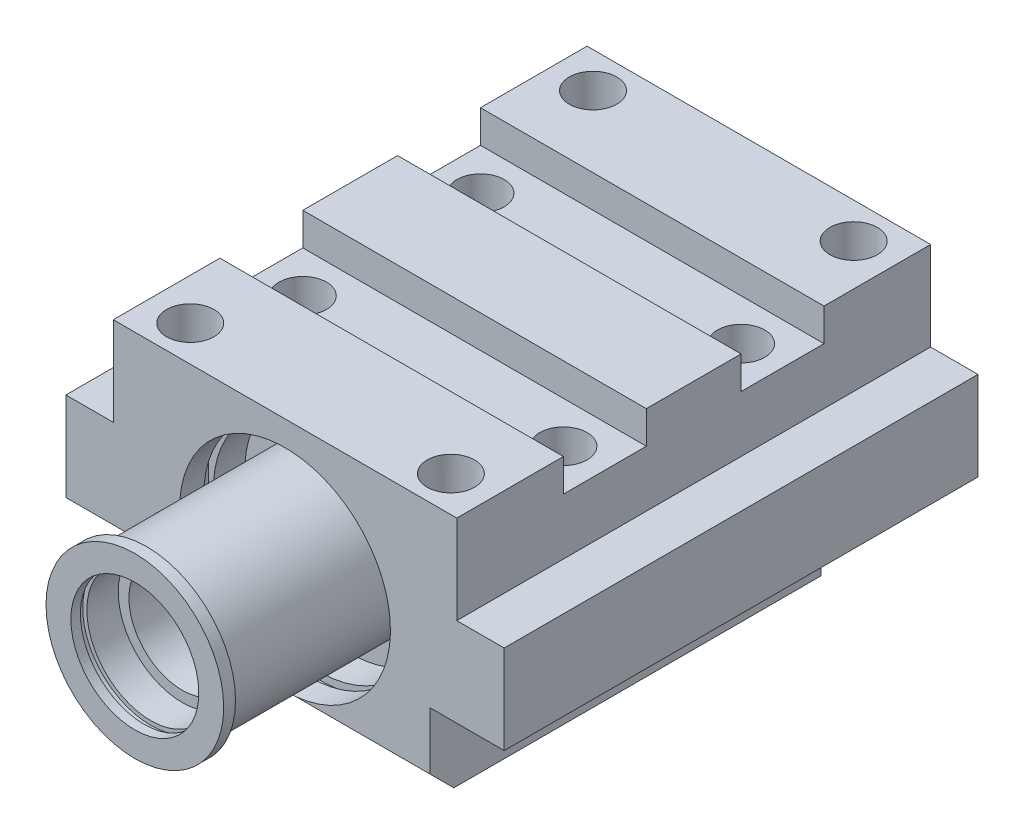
ISO-10303-21;
HEADER;
FILE_DESCRIPTION(('STEP AP214'),'2;1');
FILE_NAME('part.step','',(''),(''),'','','');
FILE_SCHEMA(('AUTOMOTIVE_DESIGN { 1 0 10303 214 1 1 1 1 }'));
ENDSEC;
DATA;
#1=APPLICATION_CONTEXT('core data for automotive mechanical design processes');
#2=APPLICATION_PROTOCOL_DEFINITION('international standard','automotive_design',2000,#1);
#3=PRODUCT_CONTEXT('',#1,'mechanical');
#4=PRODUCT('Part','Part','',(#3));
#5=PRODUCT_RELATED_PRODUCT_CATEGORY('part','',(#4));
#6=PRODUCT_DEFINITION_FORMATION('','',#4);
#7=PRODUCT_DEFINITION_CONTEXT('part definition',#1,'design');
#8=PRODUCT_DEFINITION('design','',#6,#7);
#9=PRODUCT_DEFINITION_SHAPE('','',#8);
#10=(LENGTH_UNIT() NAMED_UNIT(*) SI_UNIT(.MILLI.,.METRE.));
#11=(NAMED_UNIT(*) PLANE_ANGLE_UNIT() SI_UNIT($,.RADIAN.));
#12=(NAMED_UNIT(*) SI_UNIT($,.STERADIAN.) SOLID_ANGLE_UNIT());
#13=UNCERTAINTY_MEASURE_WITH_UNIT(LENGTH_MEASURE(1.E-05),#10,'distance_accuracy_value','');
#14=(GEOMETRIC_REPRESENTATION_CONTEXT(3) GLOBAL_UNCERTAINTY_ASSIGNED_CONTEXT((#13)) GLOBAL_UNIT_ASSIGNED_CONTEXT((#10,
#11,#12)) REPRESENTATION_CONTEXT('',''));
#15=CARTESIAN_POINT('',(0.,0.,0.));
#16=DIRECTION('',(0.,0.,1.));
#17=DIRECTION('',(1.,0.,0.));
#18=AXIS2_PLACEMENT_3D('',#15,#16,#17);
#19=CARTESIAN_POINT('',(-1.2490009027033E-13,-22.,-39.4427556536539));
#20=DIRECTION('',(0.,0.,-1.));
#21=DIRECTION('',(-1.,0.,0.));
#22=AXIS2_PLACEMENT_3D('',#19,#20,#21);
#23=PLANE('',#22);
#24=CARTESIAN_POINT('',(-1.2490009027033E-13,-22.,-39.4427556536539));
#25=DIRECTION('',(0.,0.,1.));
#26=DIRECTION('',(-1.,0.,0.));
#27=AXIS2_PLACEMENT_3D('',#24,#25,#26);
#28=CIRCLE('',#27,10.55);
#29=CARTESIAN_POINT('',(3.39122482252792,-12.0099001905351,-39.4427556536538));
#30=VERTEX_POINT('',#29);
#31=CARTESIAN_POINT('',(2.4505629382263,-11.738555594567,-39.4427556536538));
#32=VERTEX_POINT('',#31);
#33=EDGE_CURVE('E385',#30,#32,#28,.T.);
#34=ORIENTED_EDGE('',*,*,#33,.F.);
#35=CARTESIAN_POINT('',(3.99999999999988,-12.2377000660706,-39.4427556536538));
#36=DIRECTION('',(0.,0.,-1.));
#37=DIRECTION('',(-1.,0.,0.));
#38=AXIS2_PLACEMENT_3D('',#35,#36,#37);
#39=CIRCLE('',#38,0.649999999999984);
#40=CARTESIAN_POINT('',(3.52679817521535,-11.7920768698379,-39.4427556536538));
#41=VERTEX_POINT('',#40);
#42=EDGE_CURVE('E373',#30,#41,#39,.T.);
#43=ORIENTED_EDGE('',*,*,#42,.T.);
#44=CARTESIAN_POINT('',(-1.2490009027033E-13,-22.,-39.4427556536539));
#45=DIRECTION('',(0.,0.,1.));
#46=DIRECTION('',(-1.,0.,0.));
#47=AXIS2_PLACEMENT_3D('',#44,#45,#46);
#48=CIRCLE('',#47,10.8);
#49=CARTESIAN_POINT('',(2.54849952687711,-11.5049940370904,-39.4427556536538));
#50=VERTEX_POINT('',#49);
#51=EDGE_CURVE('E414',#41,#50,#48,.T.);
#52=ORIENTED_EDGE('',*,*,#51,.T.);
#53=CARTESIAN_POINT('',(3.59999999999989,-12.0832212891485,-39.4427556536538));
#54=DIRECTION('',(0.,0.,-1.));
#55=DIRECTION('',(-1.,0.,0.));
#56=AXIS2_PLACEMENT_3D('',#53,#54,#55);
#57=CIRCLE('',#56,1.2);
#58=EDGE_CURVE('E387',#32,#50,#57,.T.);
#59=ORIENTED_EDGE('',*,*,#58,.F.);
#60=EDGE_LOOP('',(#34,#43,#52,#59));
#61=FACE_BOUND('',#60,.T.);
#62=ADVANCED_FACE('F23',(#61),#23,.F.);
#63=CARTESIAN_POINT('',(-2.54849952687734,-11.5049940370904,-39.4427556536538));
#64=VERTEX_POINT('',#63);
#65=CARTESIAN_POINT('',(-3.52679817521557,-11.7920768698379,-39.4427556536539));
#66=VERTEX_POINT('',#65);
#67=EDGE_CURVE('E413',#64,#66,#48,.T.);
#68=ORIENTED_EDGE('',*,*,#67,.T.);
#69=CARTESIAN_POINT('',(-4.00000000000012,-12.2377000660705,-39.4427556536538));
#70=DIRECTION('',(0.,0.,-1.));
#71=DIRECTION('',(-1.,0.,0.));
#72=AXIS2_PLACEMENT_3D('',#69,#70,#71);
#73=CIRCLE('',#72,0.649999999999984);
#74=CARTESIAN_POINT('',(-3.39122482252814,-12.0099001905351,-39.4427556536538));
#75=VERTEX_POINT('',#74);
#76=EDGE_CURVE('E796',#66,#75,#73,.T.);
#77=ORIENTED_EDGE('',*,*,#76,.T.);
#78=CARTESIAN_POINT('',(-2.45056293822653,-11.738555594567,-39.4427556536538));
#79=VERTEX_POINT('',#78);
#80=EDGE_CURVE('E400',#79,#75,#28,.T.);
#81=ORIENTED_EDGE('',*,*,#80,.F.);
#82=CARTESIAN_POINT('',(-3.60000000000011,-12.0832212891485,-39.4427556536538));
#83=DIRECTION('',(0.,0.,-1.));
#84=DIRECTION('',(-1.,0.,0.));
#85=AXIS2_PLACEMENT_3D('',#82,#83,#84);
#86=CIRCLE('',#85,1.2);
#87=EDGE_CURVE('E799',#64,#79,#86,.T.);
#88=ORIENTED_EDGE('',*,*,#87,.F.);
#89=EDGE_LOOP('',(#68,#77,#81,#88));
#90=FACE_BOUND('',#89,.T.);
#91=ADVANCED_FACE('F739',(#90),#23,.F.);
#92=CARTESIAN_POINT('',(29.,0.,-40.));
#93=DIRECTION('',(0.,-1.,0.));
#94=DIRECTION('',(1.,0.,0.));
#95=AXIS2_PLACEMENT_3D('',#92,#93,#94);
#96=PLANE('',#95);
#97=DIRECTION('',(0.,0.,1.));
#98=VECTOR('',#97,1.);
#99=CARTESIAN_POINT('',(29.,0.,-40.));
#100=LINE('',#99,#98);
#101=CARTESIAN_POINT('',(29.,0.,-8.));
#102=VERTEX_POINT('',#101);
#103=CARTESIAN_POINT('',(29.,0.,8.));
#104=VERTEX_POINT('',#103);
#105=EDGE_CURVE('E468',#102,#104,#100,.T.);
#106=ORIENTED_EDGE('',*,*,#105,.F.);
#107=DIRECTION('',(-1.,0.,0.));
#108=VECTOR('',#107,1.);
#109=CARTESIAN_POINT('',(29.,0.,-8.));
#110=LINE('',#109,#108);
#111=CARTESIAN_POINT('',(-29.,0.,-8.));
#112=VERTEX_POINT('',#111);
#113=EDGE_CURVE('E939',#102,#112,#110,.T.);
#114=ORIENTED_EDGE('',*,*,#113,.T.);
#115=DIRECTION('',(0.,0.,1.));
#116=VECTOR('',#115,1.);
#117=CARTESIAN_POINT('',(-29.,0.,-40.));
#118=LINE('',#117,#116);
#119=CARTESIAN_POINT('',(-29.,0.,8.));
#120=VERTEX_POINT('',#119);
#121=EDGE_CURVE('E479',#112,#120,#118,.T.);
#122=ORIENTED_EDGE('',*,*,#121,.T.);
#123=DIRECTION('',(1.,0.,0.));
#124=VECTOR('',#123,1.);
#125=CARTESIAN_POINT('',(29.,0.,8.));
#126=LINE('',#125,#124);
#127=EDGE_CURVE('E471',#120,#104,#126,.T.);
#128=ORIENTED_EDGE('',*,*,#127,.T.);
#129=EDGE_LOOP('',(#106,#114,#122,#128));
#130=FACE_BOUND('',#129,.T.);
#131=ADVANCED_FACE('F734',(#130),#96,.F.);
#132=CARTESIAN_POINT('',(24.5,-43.7,40.));
#133=DIRECTION('',(0.,1.,0.));
#134=DIRECTION('',(-1.,0.,0.));
#135=AXIS2_PLACEMENT_3D('',#132,#133,#134);
#136=PLANE('',#135);
#137=CARTESIAN_POINT('',(17.5,-43.7,23.));
#138=DIRECTION('',(0.,-1.,0.));
#139=DIRECTION('',(0.,0.,-1.));
#140=AXIS2_PLACEMENT_3D('',#137,#138,#139);
#141=CIRCLE('',#140,6.25);
#142=CARTESIAN_POINT('',(17.5,-43.7,16.75));
#143=VERTEX_POINT('',#142);
#144=EDGE_CURVE('E1467',#143,#143,#141,.T.);
#145=ORIENTED_EDGE('',*,*,#144,.F.);
#146=EDGE_LOOP('',(#145));
#147=FACE_BOUND('',#146,.T.);
#148=CARTESIAN_POINT('',(-17.5,-43.7,-9.));
#149=DIRECTION('',(0.,-1.,0.));
#150=DIRECTION('',(0.,0.,-1.));
#151=AXIS2_PLACEMENT_3D('',#148,#149,#150);
#152=CIRCLE('',#151,6.25);
#153=CARTESIAN_POINT('',(-17.5,-43.7,-15.25));
#154=VERTEX_POINT('',#153);
#155=EDGE_CURVE('E1455',#154,#154,#152,.T.);
#156=ORIENTED_EDGE('',*,*,#155,.F.);
#157=EDGE_LOOP('',(#156));
#158=FACE_BOUND('',#157,.T.);
#159=CARTESIAN_POINT('',(-17.5,-43.7,23.));
#160=DIRECTION('',(0.,-1.,0.));
#161=DIRECTION('',(0.,0.,-1.));
#162=AXIS2_PLACEMENT_3D('',#159,#160,#161);
#163=CIRCLE('',#162,6.25);
#164=CARTESIAN_POINT('',(-17.5,-43.7,16.75));
#165=VERTEX_POINT('',#164);
#166=EDGE_CURVE('E1443',#165,#165,#163,.T.);
#167=ORIENTED_EDGE('',*,*,#166,.F.);
#168=EDGE_LOOP('',(#167));
#169=FACE_BOUND('',#168,.T.);
#170=CARTESIAN_POINT('',(17.5,-43.7,-8.99999999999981));
#171=DIRECTION('',(0.,-1.,0.));
#172=DIRECTION('',(0.,0.,-1.));
#173=AXIS2_PLACEMENT_3D('',#170,#171,#172);
#174=CIRCLE('',#173,6.25);
#175=CARTESIAN_POINT('',(17.5,-43.7,-15.2499999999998));
#176=VERTEX_POINT('',#175);
#177=EDGE_CURVE('E1431',#176,#176,#174,.T.);
#178=ORIENTED_EDGE('',*,*,#177,.F.);
#179=EDGE_LOOP('',(#178));
#180=FACE_BOUND('',#179,.T.);
#181=DIRECTION('',(0.,0.,1.));
#182=VECTOR('',#181,1.);
#183=CARTESIAN_POINT('',(24.5,-43.7,-42.6427556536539));
#184=LINE('',#183,#182);
#185=CARTESIAN_POINT('',(24.5,-43.7,-26.));
#186=VERTEX_POINT('',#185);
#187=CARTESIAN_POINT('',(24.5,-43.7,36.));
#188=VERTEX_POINT('',#187);
#189=EDGE_CURVE('E1315',#186,#188,#184,.T.);
#190=ORIENTED_EDGE('',*,*,#189,.T.);
#191=DIRECTION('',(-1.,0.,0.));
#192=VECTOR('',#191,1.);
#193=CARTESIAN_POINT('',(24.5,-43.7,36.));
#194=LINE('',#193,#192);
#195=CARTESIAN_POINT('',(-24.5,-43.7,36.));
#196=VERTEX_POINT('',#195);
#197=EDGE_CURVE('E2996',#188,#196,#194,.T.);
#198=ORIENTED_EDGE('',*,*,#197,.T.);
#199=DIRECTION('',(0.,0.,1.));
#200=VECTOR('',#199,1.);
#201=CARTESIAN_POINT('',(-24.5,-43.7,-42.6427556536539));
#202=LINE('',#201,#200);
#203=CARTESIAN_POINT('',(-24.5,-43.7,-26.));
#204=VERTEX_POINT('',#203);
#205=EDGE_CURVE('E1325',#204,#196,#202,.T.);
#206=ORIENTED_EDGE('',*,*,#205,.F.);
#207=DIRECTION('',(-1.,0.,0.));
#208=VECTOR('',#207,1.);
#209=CARTESIAN_POINT('',(37.0001030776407,-43.7,-26.));
#210=LINE('',#209,#208);
#211=EDGE_CURVE('E1301',#186,#204,#210,.T.);
#212=ORIENTED_EDGE('',*,*,#211,.F.);
#213=EDGE_LOOP('',(#190,#198,#206,#212));
#214=FACE_BOUND('',#213,.T.);
#215=ADVANCED_FACE('F3857',(#147,#158,#169,#180,#214),#136,.F.);
#216=CARTESIAN_POINT('',(37.,-15.,40.));
#217=DIRECTION('',(-1.,0.,0.));
#218=DIRECTION('',(0.,-1.,0.));
#219=AXIS2_PLACEMENT_3D('',#216,#217,#218);
#220=PLANE('',#219);
#221=DIRECTION('',(0.,1.,0.));
#222=VECTOR('',#221,1.);
#223=CARTESIAN_POINT('',(37.,0.,40.));
#224=LINE('',#223,#222);
#225=CARTESIAN_POINT('',(37.,-15.,40.));
#226=VERTEX_POINT('',#225);
#227=CARTESIAN_POINT('',(37.,-30.,40.));
#228=VERTEX_POINT('',#227);
#229=EDGE_CURVE('E1521',#226,#228,#224,.F.);
#230=ORIENTED_EDGE('',*,*,#229,.T.);
#231=DIRECTION('',(0.,0.,1.));
#232=VECTOR('',#231,1.);
#233=CARTESIAN_POINT('',(37.,-30.,-42.6427556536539));
#234=LINE('',#233,#232);
#235=CARTESIAN_POINT('',(37.,-30.,-40.));
#236=VERTEX_POINT('',#235);
#237=EDGE_CURVE('E1314',#236,#228,#234,.T.);
#238=ORIENTED_EDGE('',*,*,#237,.F.);
#239=DIRECTION('',(0.,-1.,0.));
#240=VECTOR('',#239,1.);
#241=CARTESIAN_POINT('',(37.,-43.7,-40.));
#242=LINE('',#241,#240);
#243=CARTESIAN_POINT('',(37.,-15.,-40.));
#244=VERTEX_POINT('',#243);
#245=EDGE_CURVE('E465',#244,#236,#242,.T.);
#246=ORIENTED_EDGE('',*,*,#245,.F.);
#247=DIRECTION('',(0.,0.,1.));
#248=VECTOR('',#247,1.);
#249=CARTESIAN_POINT('',(37.,-15.,40.));
#250=LINE('',#249,#248);
#251=EDGE_CURVE('E1572',#226,#244,#250,.F.);
#252=ORIENTED_EDGE('',*,*,#251,.F.);
#253=EDGE_LOOP('',(#230,#238,#246,#252));
#254=FACE_BOUND('',#253,.T.);
#255=ADVANCED_FACE('F3846',(#254),#220,.F.);
#256=CARTESIAN_POINT('',(-37.,-30.,40.));
#257=DIRECTION('',(1.,0.,0.));
#258=DIRECTION('',(0.,0.,-1.));
#259=AXIS2_PLACEMENT_3D('',#256,#257,#258);
#260=PLANE('',#259);
#261=DIRECTION('',(0.,1.,0.));
#262=VECTOR('',#261,1.);
#263=CARTESIAN_POINT('',(-37.,-15.,-40.));
#264=LINE('',#263,#262);
#265=CARTESIAN_POINT('',(-37.,-30.,-40.));
#266=VERTEX_POINT('',#265);
#267=CARTESIAN_POINT('',(-37.,-15.,-40.));
#268=VERTEX_POINT('',#267);
#269=EDGE_CURVE('E449',#266,#268,#264,.T.);
#270=ORIENTED_EDGE('',*,*,#269,.F.);
#271=DIRECTION('',(0.,0.,1.));
#272=VECTOR('',#271,1.);
#273=CARTESIAN_POINT('',(-37.,-30.,-42.6427556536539));
#274=LINE('',#273,#272);
#275=CARTESIAN_POINT('',(-37.,-30.,40.));
#276=VERTEX_POINT('',#275);
#277=EDGE_CURVE('E1326',#266,#276,#274,.T.);
#278=ORIENTED_EDGE('',*,*,#277,.T.);
#279=DIRECTION('',(0.,1.,0.));
#280=VECTOR('',#279,1.);
#281=CARTESIAN_POINT('',(-37.,-30.,40.));
#282=LINE('',#281,#280);
#283=CARTESIAN_POINT('',(-37.,-15.,40.));
#284=VERTEX_POINT('',#283);
#285=EDGE_CURVE('E1520',#284,#276,#282,.F.);
#286=ORIENTED_EDGE('',*,*,#285,.F.);
#287=DIRECTION('',(0.,0.,1.));
#288=VECTOR('',#287,1.);
#289=CARTESIAN_POINT('',(-37.,-15.,40.));
#290=LINE('',#289,#288);
#291=EDGE_CURVE('E1510',#284,#268,#290,.F.);
#292=ORIENTED_EDGE('',*,*,#291,.T.);
#293=EDGE_LOOP('',(#270,#278,#286,#292));
#294=FACE_BOUND('',#293,.T.);
#295=ADVANCED_FACE('F3835',(#294),#260,.F.);
#296=CARTESIAN_POINT('',(29.,-15.,40.));
#297=DIRECTION('',(0.,-1.,0.));
#298=DIRECTION('',(1.,0.,0.));
#299=AXIS2_PLACEMENT_3D('',#296,#297,#298);
#300=PLANE('',#299);
#301=ORIENTED_EDGE('',*,*,#251,.T.);
#302=DIRECTION('',(1.,0.,0.));
#303=VECTOR('',#302,1.);
#304=CARTESIAN_POINT('',(37.,-15.,-40.));
#305=LINE('',#304,#303);
#306=CARTESIAN_POINT('',(29.,-15.,-40.));
#307=VERTEX_POINT('',#306);
#308=EDGE_CURVE('E462',#307,#244,#305,.T.);
#309=ORIENTED_EDGE('',*,*,#308,.F.);
#310=DIRECTION('',(0.,0.,1.));
#311=VECTOR('',#310,1.);
#312=CARTESIAN_POINT('',(29.,-15.,40.));
#313=LINE('',#312,#311);
#314=CARTESIAN_POINT('',(29.,-15.,40.));
#315=VERTEX_POINT('',#314);
#316=EDGE_CURVE('E1593',#307,#315,#313,.T.);
#317=ORIENTED_EDGE('',*,*,#316,.T.);
#318=DIRECTION('',(-1.,0.,0.));
#319=VECTOR('',#318,1.);
#320=CARTESIAN_POINT('',(0.,-15.,40.));
#321=LINE('',#320,#319);
#322=EDGE_CURVE('E1547',#315,#226,#321,.F.);
#323=ORIENTED_EDGE('',*,*,#322,.T.);
#324=EDGE_LOOP('',(#301,#309,#317,#323));
#325=FACE_BOUND('',#324,.T.);
#326=ADVANCED_FACE('F3825',(#325),#300,.F.);
#327=CARTESIAN_POINT('',(-37.,-15.,40.));
#328=DIRECTION('',(0.,-1.,0.));
#329=DIRECTION('',(0.,0.,-1.));
#330=AXIS2_PLACEMENT_3D('',#327,#328,#329);
#331=PLANE('',#330);
#332=DIRECTION('',(0.,0.,-1.));
#333=VECTOR('',#332,1.);
#334=CARTESIAN_POINT('',(-29.,-15.,40.));
#335=LINE('',#334,#333);
#336=CARTESIAN_POINT('',(-29.,-15.,40.));
#337=VERTEX_POINT('',#336);
#338=CARTESIAN_POINT('',(-29.,-15.,-40.));
#339=VERTEX_POINT('',#338);
#340=EDGE_CURVE('E654',#337,#339,#335,.T.);
#341=ORIENTED_EDGE('',*,*,#340,.T.);
#342=DIRECTION('',(1.,0.,0.));
#343=VECTOR('',#342,1.);
#344=CARTESIAN_POINT('',(-29.,-15.,-40.));
#345=LINE('',#344,#343);
#346=EDGE_CURVE('E451',#268,#339,#345,.T.);
#347=ORIENTED_EDGE('',*,*,#346,.F.);
#348=ORIENTED_EDGE('',*,*,#291,.F.);
#349=DIRECTION('',(1.,0.,0.));
#350=VECTOR('',#349,1.);
#351=CARTESIAN_POINT('',(-37.,-15.,40.));
#352=LINE('',#351,#350);
#353=EDGE_CURVE('E1540',#337,#284,#352,.F.);
#354=ORIENTED_EDGE('',*,*,#353,.F.);
#355=EDGE_LOOP('',(#341,#347,#348,#354));
#356=FACE_BOUND('',#355,.T.);
#357=ADVANCED_FACE('F3815',(#356),#331,.F.);
#358=CARTESIAN_POINT('',(29.,0.,40.));
#359=DIRECTION('',(-1.,0.,0.));
#360=DIRECTION('',(0.,-1.,0.));
#361=AXIS2_PLACEMENT_3D('',#358,#359,#360);
#362=PLANE('',#361);
#363=DIRECTION('',(0.,0.,1.));
#364=VECTOR('',#363,1.);
#365=CARTESIAN_POINT('',(29.,-5.50000000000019,40.));
#366=LINE('',#365,#364);
#367=CARTESIAN_POINT('',(29.,-5.5,-22.));
#368=VERTEX_POINT('',#367);
#369=CARTESIAN_POINT('',(29.,-5.5,-8.));
#370=VERTEX_POINT('',#369);
#371=EDGE_CURVE('E1293',#368,#370,#366,.T.);
#372=ORIENTED_EDGE('',*,*,#371,.T.);
#373=DIRECTION('',(0.,1.,0.));
#374=VECTOR('',#373,1.);
#375=CARTESIAN_POINT('',(29.,2.56108265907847E-13,-8.));
#376=LINE('',#375,#374);
#377=EDGE_CURVE('E1290',#370,#102,#376,.T.);
#378=ORIENTED_EDGE('',*,*,#377,.T.);
#379=ORIENTED_EDGE('',*,*,#105,.T.);
#380=DIRECTION('',(0.,-1.,0.));
#381=VECTOR('',#380,1.);
#382=CARTESIAN_POINT('',(29.,-15.,8.));
#383=LINE('',#382,#381);
#384=CARTESIAN_POINT('',(29.,-5.5,8.));
#385=VERTEX_POINT('',#384);
#386=EDGE_CURVE('E452',#104,#385,#383,.T.);
#387=ORIENTED_EDGE('',*,*,#386,.T.);
#388=DIRECTION('',(0.,0.,1.));
#389=VECTOR('',#388,1.);
#390=CARTESIAN_POINT('',(29.,-5.5,40.));
#391=LINE('',#390,#389);
#392=CARTESIAN_POINT('',(29.,-5.5,22.));
#393=VERTEX_POINT('',#392);
#394=EDGE_CURVE('E2911',#393,#385,#391,.F.);
#395=ORIENTED_EDGE('',*,*,#394,.F.);
#396=DIRECTION('',(0.,-1.,0.));
#397=VECTOR('',#396,1.);
#398=CARTESIAN_POINT('',(29.,-5.5,22.));
#399=LINE('',#398,#397);
#400=CARTESIAN_POINT('',(29.,0.,22.));
#401=VERTEX_POINT('',#400);
#402=EDGE_CURVE('E1529',#393,#401,#399,.F.);
#403=ORIENTED_EDGE('',*,*,#402,.T.);
#404=DIRECTION('',(0.,0.,-1.));
#405=VECTOR('',#404,1.);
#406=CARTESIAN_POINT('',(29.,0.,40.));
#407=LINE('',#406,#405);
#408=CARTESIAN_POINT('',(29.,0.,40.));
#409=VERTEX_POINT('',#408);
#410=EDGE_CURVE('E1509',#401,#409,#407,.F.);
#411=ORIENTED_EDGE('',*,*,#410,.T.);
#412=DIRECTION('',(0.,-1.,0.));
#413=VECTOR('',#412,1.);
#414=CARTESIAN_POINT('',(29.,0.,40.));
#415=LINE('',#414,#413);
#416=EDGE_CURVE('E1532',#315,#409,#415,.F.);
#417=ORIENTED_EDGE('',*,*,#416,.F.);
#418=ORIENTED_EDGE('',*,*,#316,.F.);
#419=DIRECTION('',(0.,-1.,0.));
#420=VECTOR('',#419,1.);
#421=CARTESIAN_POINT('',(29.,-15.,-40.));
#422=LINE('',#421,#420);
#423=CARTESIAN_POINT('',(29.,0.,-40.));
#424=VERTEX_POINT('',#423);
#425=EDGE_CURVE('E459',#424,#307,#422,.T.);
#426=ORIENTED_EDGE('',*,*,#425,.F.);
#427=CARTESIAN_POINT('',(29.,0.,-22.));
#428=VERTEX_POINT('',#427);
#429=EDGE_CURVE('E476',#424,#428,#100,.T.);
#430=ORIENTED_EDGE('',*,*,#429,.T.);
#431=DIRECTION('',(0.,-1.,0.));
#432=VECTOR('',#431,1.);
#433=CARTESIAN_POINT('',(29.,0.,-22.));
#434=LINE('',#433,#432);
#435=EDGE_CURVE('E1286',#428,#368,#434,.T.);
#436=ORIENTED_EDGE('',*,*,#435,.T.);
#437=EDGE_LOOP('',(#372,#378,#379,#387,#395,#403,#411,#417,#418,#426,#430,#436));
#438=FACE_BOUND('',#437,.T.);
#439=ADVANCED_FACE('F2968',(#438),#362,.F.);
#440=CARTESIAN_POINT('',(-29.,-15.,40.));
#441=DIRECTION('',(1.,0.,0.));
#442=DIRECTION('',(0.,0.,-1.));
#443=AXIS2_PLACEMENT_3D('',#440,#441,#442);
#444=PLANE('',#443);
#445=ORIENTED_EDGE('',*,*,#121,.F.);
#446=DIRECTION('',(0.,1.,0.));
#447=VECTOR('',#446,1.);
#448=CARTESIAN_POINT('',(-29.,-5.5,-8.));
#449=LINE('',#448,#447);
#450=CARTESIAN_POINT('',(-29.,-5.5,-8.));
#451=VERTEX_POINT('',#450);
#452=EDGE_CURVE('E1275',#451,#112,#449,.T.);
#453=ORIENTED_EDGE('',*,*,#452,.F.);
#454=DIRECTION('',(0.,0.,1.));
#455=VECTOR('',#454,1.);
#456=CARTESIAN_POINT('',(-29.,-5.5,-22.));
#457=LINE('',#456,#455);
#458=CARTESIAN_POINT('',(-29.,-5.5,-22.));
#459=VERTEX_POINT('',#458);
#460=EDGE_CURVE('E1280',#459,#451,#457,.T.);
#461=ORIENTED_EDGE('',*,*,#460,.F.);
#462=DIRECTION('',(0.,-1.,0.));
#463=VECTOR('',#462,1.);
#464=CARTESIAN_POINT('',(-29.,0.,-22.));
#465=LINE('',#464,#463);
#466=CARTESIAN_POINT('',(-29.,0.,-22.));
#467=VERTEX_POINT('',#466);
#468=EDGE_CURVE('E1277',#467,#459,#465,.T.);
#469=ORIENTED_EDGE('',*,*,#468,.F.);
#470=CARTESIAN_POINT('',(-29.,0.,-40.));
#471=VERTEX_POINT('',#470);
#472=EDGE_CURVE('E480',#471,#467,#118,.T.);
#473=ORIENTED_EDGE('',*,*,#472,.F.);
#474=DIRECTION('',(0.,1.,0.));
#475=VECTOR('',#474,1.);
#476=CARTESIAN_POINT('',(-29.,0.,-40.));
#477=LINE('',#476,#475);
#478=EDGE_CURVE('E455',#339,#471,#477,.T.);
#479=ORIENTED_EDGE('',*,*,#478,.F.);
#480=ORIENTED_EDGE('',*,*,#340,.F.);
#481=DIRECTION('',(0.,-1.,0.));
#482=VECTOR('',#481,1.);
#483=CARTESIAN_POINT('',(-29.,0.,40.));
#484=LINE('',#483,#482);
#485=CARTESIAN_POINT('',(-29.,0.,40.));
#486=VERTEX_POINT('',#485);
#487=EDGE_CURVE('E1513',#337,#486,#484,.F.);
#488=ORIENTED_EDGE('',*,*,#487,.T.);
#489=DIRECTION('',(0.,0.,-1.));
#490=VECTOR('',#489,1.);
#491=CARTESIAN_POINT('',(-29.,0.,40.));
#492=LINE('',#491,#490);
#493=CARTESIAN_POINT('',(-29.,0.,22.));
#494=VERTEX_POINT('',#493);
#495=EDGE_CURVE('E1500',#494,#486,#492,.F.);
#496=ORIENTED_EDGE('',*,*,#495,.F.);
#497=DIRECTION('',(0.,-1.,0.));
#498=VECTOR('',#497,1.);
#499=CARTESIAN_POINT('',(-29.,-15.,22.));
#500=LINE('',#499,#498);
#501=CARTESIAN_POINT('',(-29.,-5.5,22.));
#502=VERTEX_POINT('',#501);
#503=EDGE_CURVE('E1553',#502,#494,#500,.F.);
#504=ORIENTED_EDGE('',*,*,#503,.F.);
#505=DIRECTION('',(0.,0.,-1.));
#506=VECTOR('',#505,1.);
#507=CARTESIAN_POINT('',(-29.,-5.5,40.));
#508=LINE('',#507,#506);
#509=CARTESIAN_POINT('',(-29.,-5.5,8.));
#510=VERTEX_POINT('',#509);
#511=EDGE_CURVE('E2944',#510,#502,#508,.F.);
#512=ORIENTED_EDGE('',*,*,#511,.F.);
#513=DIRECTION('',(0.,1.,0.));
#514=VECTOR('',#513,1.);
#515=CARTESIAN_POINT('',(-29.,0.,8.));
#516=LINE('',#515,#514);
#517=EDGE_CURVE('E448',#510,#120,#516,.T.);
#518=ORIENTED_EDGE('',*,*,#517,.T.);
#519=EDGE_LOOP('',(#445,#453,#461,#469,#473,#479,#480,#488,#496,#504,#512,#518));
#520=FACE_BOUND('',#519,.T.);
#521=ADVANCED_FACE('F1515',(#520),#444,.F.);
#522=CARTESIAN_POINT('',(0.,-5.5,0.));
#523=DIRECTION('',(0.,1.,0.));
#524=DIRECTION('',(0.,0.,1.));
#525=AXIS2_PLACEMENT_3D('',#522,#523,#524);
#526=PLANE('',#525);
#527=CARTESIAN_POINT('',(-22.,-5.5,15.0000000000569));
#528=DIRECTION('',(0.,1.,0.));
#529=DIRECTION('',(0.,0.,1.));
#530=AXIS2_PLACEMENT_3D('',#527,#528,#529);
#531=CIRCLE('',#530,4.);
#532=CARTESIAN_POINT('',(-22.,-5.5,19.000000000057));
#533=VERTEX_POINT('',#532);
#534=EDGE_CURVE('E1476',#533,#533,#531,.T.);
#535=ORIENTED_EDGE('',*,*,#534,.F.);
#536=EDGE_LOOP('',(#535));
#537=FACE_BOUND('',#536,.T.);
#538=CARTESIAN_POINT('',(22.,-5.5,15.0000000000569));
#539=DIRECTION('',(0.,1.,0.));
#540=DIRECTION('',(0.,0.,1.));
#541=AXIS2_PLACEMENT_3D('',#538,#539,#540);
#542=CIRCLE('',#541,4.);
#543=CARTESIAN_POINT('',(22.,-5.5,19.000000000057));
#544=VERTEX_POINT('',#543);
#545=EDGE_CURVE('E1477',#544,#544,#542,.T.);
#546=ORIENTED_EDGE('',*,*,#545,.F.);
#547=EDGE_LOOP('',(#546));
#548=FACE_BOUND('',#547,.T.);
#549=ORIENTED_EDGE('',*,*,#394,.T.);
#550=DIRECTION('',(1.,0.,0.));
#551=VECTOR('',#550,1.);
#552=CARTESIAN_POINT('',(29.,-5.5,8.));
#553=LINE('',#552,#551);
#554=EDGE_CURVE('E483',#510,#385,#553,.T.);
#555=ORIENTED_EDGE('',*,*,#554,.F.);
#556=ORIENTED_EDGE('',*,*,#511,.T.);
#557=DIRECTION('',(1.,0.,0.));
#558=VECTOR('',#557,1.);
#559=CARTESIAN_POINT('',(-29.,-5.5,22.));
#560=LINE('',#559,#558);
#561=EDGE_CURVE('E1587',#502,#393,#560,.T.);
#562=ORIENTED_EDGE('',*,*,#561,.T.);
#563=EDGE_LOOP('',(#549,#555,#556,#562));
#564=FACE_BOUND('',#563,.T.);
#565=ADVANCED_FACE('F1493',(#537,#548,#564),#526,.T.);
#566=CARTESIAN_POINT('',(-29.,0.,40.));
#567=DIRECTION('',(0.,-1.,0.));
#568=DIRECTION('',(1.,0.,0.));
#569=AXIS2_PLACEMENT_3D('',#566,#567,#568);
#570=PLANE('',#569);
#571=CARTESIAN_POINT('',(-22.,0.,34.));
#572=DIRECTION('',(0.,1.,0.));
#573=DIRECTION('',(-1.,0.,0.));
#574=AXIS2_PLACEMENT_3D('',#571,#572,#573);
#575=CIRCLE('',#574,4.00000000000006);
#576=CARTESIAN_POINT('',(-26.0000000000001,0.,34.));
#577=VERTEX_POINT('',#576);
#578=EDGE_CURVE('E1480',#577,#577,#575,.T.);
#579=ORIENTED_EDGE('',*,*,#578,.F.);
#580=EDGE_LOOP('',(#579));
#581=FACE_BOUND('',#580,.T.);
#582=CARTESIAN_POINT('',(22.,0.,34.));
#583=DIRECTION('',(0.,1.,0.));
#584=DIRECTION('',(-1.,0.,0.));
#585=AXIS2_PLACEMENT_3D('',#582,#583,#584);
#586=CIRCLE('',#585,4.);
#587=CARTESIAN_POINT('',(18.,0.,34.));
#588=VERTEX_POINT('',#587);
#589=EDGE_CURVE('E1483',#588,#588,#586,.T.);
#590=ORIENTED_EDGE('',*,*,#589,.F.);
#591=EDGE_LOOP('',(#590));
#592=FACE_BOUND('',#591,.T.);
#593=ORIENTED_EDGE('',*,*,#495,.T.);
#594=DIRECTION('',(1.,0.,0.));
#595=VECTOR('',#594,1.);
#596=CARTESIAN_POINT('',(-29.,0.,40.));
#597=LINE('',#596,#595);
#598=EDGE_CURVE('E1503',#409,#486,#597,.F.);
#599=ORIENTED_EDGE('',*,*,#598,.F.);
#600=ORIENTED_EDGE('',*,*,#410,.F.);
#601=DIRECTION('',(1.,0.,0.));
#602=VECTOR('',#601,1.);
#603=CARTESIAN_POINT('',(-29.,0.,22.));
#604=LINE('',#603,#602);
#605=EDGE_CURVE('E1505',#401,#494,#604,.F.);
#606=ORIENTED_EDGE('',*,*,#605,.T.);
#607=EDGE_LOOP('',(#593,#599,#600,#606));
#608=FACE_BOUND('',#607,.T.);
#609=ADVANCED_FACE('F1490',(#581,#592,#608),#570,.F.);
#610=CARTESIAN_POINT('',(0.,0.,40.));
#611=DIRECTION('',(0.,0.,-1.));
#612=DIRECTION('',(-1.,0.,0.));
#613=AXIS2_PLACEMENT_3D('',#610,#611,#612);
#614=PLANE('',#613);
#615=DIRECTION('',(0.,1.,0.));
#616=VECTOR('',#615,1.);
#617=CARTESIAN_POINT('',(-24.5,-43.7,40.));
#618=LINE('',#617,#616);
#619=CARTESIAN_POINT('',(-24.5,-39.7,40.));
#620=VERTEX_POINT('',#619);
#621=CARTESIAN_POINT('',(-24.5,-30.,40.));
#622=VERTEX_POINT('',#621);
#623=EDGE_CURVE('E1318',#620,#622,#618,.T.);
#624=ORIENTED_EDGE('',*,*,#623,.F.);
#625=DIRECTION('',(1.,0.,0.));
#626=VECTOR('',#625,1.);
#627=CARTESIAN_POINT('',(0.,-39.7,40.));
#628=LINE('',#627,#626);
#629=CARTESIAN_POINT('',(-1.88414436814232,-39.7,40.));
#630=VERTEX_POINT('',#629);
#631=EDGE_CURVE('E39',#620,#630,#628,.T.);
#632=ORIENTED_EDGE('',*,*,#631,.T.);
#633=CARTESIAN_POINT('',(0.,-22.,40.));
#634=DIRECTION('',(0.,0.,-1.));
#635=DIRECTION('',(-1.,0.,0.));
#636=AXIS2_PLACEMENT_3D('',#633,#634,#635);
#637=CIRCLE('',#636,17.8);
#638=CARTESIAN_POINT('',(1.88414436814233,-39.7,40.));
#639=VERTEX_POINT('',#638);
#640=EDGE_CURVE('E708',#630,#639,#637,.T.);
#641=ORIENTED_EDGE('',*,*,#640,.T.);
#642=DIRECTION('',(1.,0.,0.));
#643=VECTOR('',#642,1.);
#644=CARTESIAN_POINT('',(0.,-39.7,40.));
#645=LINE('',#644,#643);
#646=CARTESIAN_POINT('',(24.5,-39.7,40.));
#647=VERTEX_POINT('',#646);
#648=EDGE_CURVE('E2989',#639,#647,#645,.T.);
#649=ORIENTED_EDGE('',*,*,#648,.T.);
#650=DIRECTION('',(0.,-1.,0.));
#651=VECTOR('',#650,1.);
#652=CARTESIAN_POINT('',(24.5,-30.,40.));
#653=LINE('',#652,#651);
#654=CARTESIAN_POINT('',(24.5,-30.,40.));
#655=VERTEX_POINT('',#654);
#656=EDGE_CURVE('E1311',#655,#647,#653,.T.);
#657=ORIENTED_EDGE('',*,*,#656,.F.);
#658=DIRECTION('',(-1.,0.,0.));
#659=VECTOR('',#658,1.);
#660=CARTESIAN_POINT('',(37.,-30.,40.));
#661=LINE('',#660,#659);
#662=EDGE_CURVE('E1305',#228,#655,#661,.T.);
#663=ORIENTED_EDGE('',*,*,#662,.F.);
#664=ORIENTED_EDGE('',*,*,#229,.F.);
#665=ORIENTED_EDGE('',*,*,#322,.F.);
#666=ORIENTED_EDGE('',*,*,#416,.T.);
#667=ORIENTED_EDGE('',*,*,#598,.T.);
#668=ORIENTED_EDGE('',*,*,#487,.F.);
#669=ORIENTED_EDGE('',*,*,#353,.T.);
#670=ORIENTED_EDGE('',*,*,#285,.T.);
#671=DIRECTION('',(-1.,0.,0.));
#672=VECTOR('',#671,1.);
#673=CARTESIAN_POINT('',(-24.5,-30.,40.));
#674=LINE('',#673,#672);
#675=EDGE_CURVE('E1323',#622,#276,#674,.T.);
#676=ORIENTED_EDGE('',*,*,#675,.F.);
#677=EDGE_LOOP('',(#624,#632,#641,#649,#657,#663,#664,#665,#666,#667,#668,#669,#670,#676));
#678=FACE_BOUND('',#677,.T.);
#679=ADVANCED_FACE('F735',(#678),#614,.F.);
#680=CARTESIAN_POINT('',(-29.,-5.5,22.));
#681=DIRECTION('',(0.,0.,1.));
#682=DIRECTION('',(1.,0.,0.));
#683=AXIS2_PLACEMENT_3D('',#680,#681,#682);
#684=PLANE('',#683);
#685=ORIENTED_EDGE('',*,*,#503,.T.);
#686=ORIENTED_EDGE('',*,*,#605,.F.);
#687=ORIENTED_EDGE('',*,*,#402,.F.);
#688=ORIENTED_EDGE('',*,*,#561,.F.);
#689=EDGE_LOOP('',(#685,#686,#687,#688));
#690=FACE_BOUND('',#689,.T.);
#691=ADVANCED_FACE('F723',(#690),#684,.F.);
#692=CARTESIAN_POINT('',(0.,-22.,29.));
#693=DIRECTION('',(0.,0.,1.));
#694=DIRECTION('',(1.,0.,0.));
#695=AXIS2_PLACEMENT_3D('',#692,#693,#694);
#696=CYLINDRICAL_SURFACE('',#695,17.8);
#697=CARTESIAN_POINT('',(0.,-22.,35.9));
#698=DIRECTION('',(0.,0.,-1.));
#699=DIRECTION('',(0.,-1.,0.));
#700=AXIS2_PLACEMENT_3D('',#697,#698,#699);
#701=CIRCLE('',#700,17.8);
#702=CARTESIAN_POINT('',(0.,-39.8,35.9));
#703=VERTEX_POINT('',#702);
#704=EDGE_CURVE('E442',#703,#703,#701,.T.);
#705=ORIENTED_EDGE('',*,*,#704,.T.);
#706=EDGE_LOOP('',(#705));
#707=FACE_BOUND('',#706,.T.);
#708=ORIENTED_EDGE('',*,*,#640,.F.);
#709=CARTESIAN_POINT('',(0.,-22.,57.7));
#710=DIRECTION('',(0.,0.707106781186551,-0.707106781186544));
#711=DIRECTION('',(0.,0.707106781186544,0.707106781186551));
#712=AXIS2_PLACEMENT_3D('',#709,#710,#711);
#713=ELLIPSE('',#712,25.1730014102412,17.8);
#714=EDGE_CURVE('E32',#630,#639,#713,.F.);
#715=ORIENTED_EDGE('',*,*,#714,.T.);
#716=EDGE_LOOP('',(#708,#715));
#717=FACE_BOUND('',#716,.T.);
#718=ADVANCED_FACE('F720',(#707,#717),#696,.F.);
#719=CARTESIAN_POINT('',(22.,0.,-34.));
#720=DIRECTION('',(0.,1.,0.));
#721=DIRECTION('',(0.,0.,1.));
#722=AXIS2_PLACEMENT_3D('',#719,#720,#721);
#723=CIRCLE('',#722,4.);
#724=CARTESIAN_POINT('',(22.,0.,-30.));
#725=VERTEX_POINT('',#724);
#726=EDGE_CURVE('E1419',#725,#725,#723,.T.);
#727=ORIENTED_EDGE('',*,*,#726,.F.);
#728=EDGE_LOOP('',(#727));
#729=FACE_BOUND('',#728,.T.);
#730=CARTESIAN_POINT('',(-22.,0.,-34.));
#731=DIRECTION('',(0.,1.,0.));
#732=DIRECTION('',(0.,0.,1.));
#733=AXIS2_PLACEMENT_3D('',#730,#731,#732);
#734=CIRCLE('',#733,4.);
#735=CARTESIAN_POINT('',(-22.,0.,-30.));
#736=VERTEX_POINT('',#735);
#737=EDGE_CURVE('E1413',#736,#736,#734,.T.);
#738=ORIENTED_EDGE('',*,*,#737,.F.);
#739=EDGE_LOOP('',(#738));
#740=FACE_BOUND('',#739,.T.);
#741=ORIENTED_EDGE('',*,*,#472,.T.);
#742=DIRECTION('',(1.,0.,0.));
#743=VECTOR('',#742,1.);
#744=CARTESIAN_POINT('',(29.,0.,-22.));
#745=LINE('',#744,#743);
#746=EDGE_CURVE('E936',#467,#428,#745,.T.);
#747=ORIENTED_EDGE('',*,*,#746,.T.);
#748=ORIENTED_EDGE('',*,*,#429,.F.);
#749=DIRECTION('',(1.,0.,0.));
#750=VECTOR('',#749,1.);
#751=CARTESIAN_POINT('',(29.,0.,-40.));
#752=LINE('',#751,#750);
#753=EDGE_CURVE('E457',#471,#424,#752,.T.);
#754=ORIENTED_EDGE('',*,*,#753,.F.);
#755=EDGE_LOOP('',(#741,#747,#748,#754));
#756=FACE_BOUND('',#755,.T.);
#757=ADVANCED_FACE('F722',(#729,#740,#756),#96,.F.);
#758=CARTESIAN_POINT('',(0.,0.,-40.));
#759=DIRECTION('',(0.,0.,1.));
#760=DIRECTION('',(1.,0.,0.));
#761=AXIS2_PLACEMENT_3D('',#758,#759,#760);
#762=PLANE('',#761);
#763=CARTESIAN_POINT('',(28.0000000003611,-22.5,-40.));
#764=DIRECTION('',(0.,0.,-1.));
#765=DIRECTION('',(-1.,0.,0.));
#766=AXIS2_PLACEMENT_3D('',#763,#764,#765);
#767=CIRCLE('',#766,5.);
#768=CARTESIAN_POINT('',(23.0000000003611,-22.5,-40.));
#769=VERTEX_POINT('',#768);
#770=EDGE_CURVE('E1407',#769,#769,#767,.T.);
#771=ORIENTED_EDGE('',*,*,#770,.F.);
#772=EDGE_LOOP('',(#771));
#773=FACE_BOUND('',#772,.T.);
#774=CARTESIAN_POINT('',(-27.9999999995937,-22.5,-40.));
#775=DIRECTION('',(0.,0.,-1.));
#776=DIRECTION('',(-1.,0.,0.));
#777=AXIS2_PLACEMENT_3D('',#774,#775,#776);
#778=CIRCLE('',#777,5.);
#779=CARTESIAN_POINT('',(-32.9999999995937,-22.5,-40.));
#780=VERTEX_POINT('',#779);
#781=EDGE_CURVE('E1401',#780,#780,#778,.T.);
#782=ORIENTED_EDGE('',*,*,#781,.F.);
#783=EDGE_LOOP('',(#782));
#784=FACE_BOUND('',#783,.T.);
#785=CARTESIAN_POINT('',(0.,-22.,-40.));
#786=DIRECTION('',(0.,0.,1.));
#787=DIRECTION('',(1.,0.,0.));
#788=AXIS2_PLACEMENT_3D('',#785,#786,#787);
#789=CIRCLE('',#788,17.8);
#790=CARTESIAN_POINT('',(17.8,-22.,-40.));
#791=VERTEX_POINT('',#790);
#792=EDGE_CURVE('E3996',#791,#791,#789,.T.);
#793=ORIENTED_EDGE('',*,*,#792,.T.);
#794=EDGE_LOOP('',(#793));
#795=FACE_BOUND('',#794,.T.);
#796=DIRECTION('',(0.,-1.,0.));
#797=VECTOR('',#796,1.);
#798=CARTESIAN_POINT('',(24.5,0.,-40.));
#799=LINE('',#798,#797);
#800=CARTESIAN_POINT('',(24.5,-30.,-40.));
#801=VERTEX_POINT('',#800);
#802=CARTESIAN_POINT('',(24.5,-42.,-40.));
#803=VERTEX_POINT('',#802);
#804=EDGE_CURVE('E927',#801,#803,#799,.T.);
#805=ORIENTED_EDGE('',*,*,#804,.T.);
#806=DIRECTION('',(-1.,0.,0.));
#807=VECTOR('',#806,1.);
#808=CARTESIAN_POINT('',(37.0001030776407,-42.,-40.));
#809=LINE('',#808,#807);
#810=CARTESIAN_POINT('',(-24.5,-42.,-40.));
#811=VERTEX_POINT('',#810);
#812=EDGE_CURVE('E1302',#803,#811,#809,.T.);
#813=ORIENTED_EDGE('',*,*,#812,.T.);
#814=DIRECTION('',(0.,1.,0.));
#815=VECTOR('',#814,1.);
#816=CARTESIAN_POINT('',(-24.5,0.,-40.));
#817=LINE('',#816,#815);
#818=CARTESIAN_POINT('',(-24.5,-30.,-40.));
#819=VERTEX_POINT('',#818);
#820=EDGE_CURVE('E912',#811,#819,#817,.T.);
#821=ORIENTED_EDGE('',*,*,#820,.T.);
#822=DIRECTION('',(-1.,0.,0.));
#823=VECTOR('',#822,1.);
#824=CARTESIAN_POINT('',(0.,-30.,-40.));
#825=LINE('',#824,#823);
#826=EDGE_CURVE('E921',#819,#266,#825,.T.);
#827=ORIENTED_EDGE('',*,*,#826,.T.);
#828=ORIENTED_EDGE('',*,*,#269,.T.);
#829=ORIENTED_EDGE('',*,*,#346,.T.);
#830=ORIENTED_EDGE('',*,*,#478,.T.);
#831=ORIENTED_EDGE('',*,*,#753,.T.);
#832=ORIENTED_EDGE('',*,*,#425,.T.);
#833=ORIENTED_EDGE('',*,*,#308,.T.);
#834=ORIENTED_EDGE('',*,*,#245,.T.);
#835=DIRECTION('',(-1.,0.,0.));
#836=VECTOR('',#835,1.);
#837=CARTESIAN_POINT('',(0.,-30.,-40.));
#838=LINE('',#837,#836);
#839=EDGE_CURVE('E924',#236,#801,#838,.T.);
#840=ORIENTED_EDGE('',*,*,#839,.T.);
#841=EDGE_LOOP('',(#805,#813,#821,#827,#828,#829,#830,#831,#832,#833,#834,#840));
#842=FACE_BOUND('',#841,.T.);
#843=ADVANCED_FACE('F731',(#773,#784,#795,#842),#762,.F.);
#844=CARTESIAN_POINT('',(0.,0.,8.));
#845=DIRECTION('',(0.,0.,1.));
#846=DIRECTION('',(1.,0.,0.));
#847=AXIS2_PLACEMENT_3D('',#844,#845,#846);
#848=PLANE('',#847);
#849=ORIENTED_EDGE('',*,*,#517,.F.);
#850=ORIENTED_EDGE('',*,*,#554,.T.);
#851=ORIENTED_EDGE('',*,*,#386,.F.);
#852=ORIENTED_EDGE('',*,*,#127,.F.);
#853=EDGE_LOOP('',(#849,#850,#851,#852));
#854=FACE_BOUND('',#853,.T.);
#855=ADVANCED_FACE('F1176',(#854),#848,.T.);
#856=CARTESIAN_POINT('',(0.,-22.,35.9));
#857=DIRECTION('',(0.,0.,1.));
#858=DIRECTION('',(0.,-1.,0.));
#859=AXIS2_PLACEMENT_3D('',#856,#857,#858);
#860=PLANE('',#859);
#861=ORIENTED_EDGE('',*,*,#704,.F.);
#862=EDGE_LOOP('',(#861));
#863=FACE_BOUND('',#862,.T.);
#864=CARTESIAN_POINT('',(0.,-22.,35.9));
#865=DIRECTION('',(0.,0.,-1.));
#866=DIRECTION('',(0.,-1.,0.));
#867=AXIS2_PLACEMENT_3D('',#864,#865,#866);
#868=CIRCLE('',#867,19.);
#869=CARTESIAN_POINT('',(0.,-41.,35.9));
#870=VERTEX_POINT('',#869);
#871=EDGE_CURVE('E445',#870,#870,#868,.T.);
#872=ORIENTED_EDGE('',*,*,#871,.T.);
#873=EDGE_LOOP('',(#872));
#874=FACE_BOUND('',#873,.T.);
#875=ADVANCED_FACE('F1172',(#863,#874),#860,.F.);
#876=CARTESIAN_POINT('',(-22.,-22.5,34.));
#877=DIRECTION('',(0.,1.,0.));
#878=DIRECTION('',(-1.,0.,0.));
#879=AXIS2_PLACEMENT_3D('',#876,#877,#878);
#880=PLANE('',#879);
#881=DIRECTION('',(-1.,0.,0.));
#882=VECTOR('',#881,1.);
#883=CARTESIAN_POINT('',(0.,-22.5,34.3));
#884=LINE('',#883,#882);
#885=CARTESIAN_POINT('',(-18.6132611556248,-22.5,34.3));
#886=VERTEX_POINT('',#885);
#887=CARTESIAN_POINT('',(-18.9934199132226,-22.5,34.3));
#888=VERTEX_POINT('',#887);
#889=EDGE_CURVE('E492',#886,#888,#884,.T.);
#890=ORIENTED_EDGE('',*,*,#889,.F.);
#891=CARTESIAN_POINT('',(-22.,-22.5,34.));
#892=DIRECTION('',(0.,1.,0.));
#893=DIRECTION('',(-1.,0.,0.));
#894=AXIS2_PLACEMENT_3D('',#891,#892,#893);
#895=CIRCLE('',#894,3.4);
#896=CARTESIAN_POINT('',(-18.9934199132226,-22.5,35.5876007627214));
#897=VERTEX_POINT('',#896);
#898=EDGE_CURVE('E487',#897,#886,#895,.T.);
#899=ORIENTED_EDGE('',*,*,#898,.F.);
#900=DIRECTION('',(0.,0.,-1.));
#901=VECTOR('',#900,1.);
#902=CARTESIAN_POINT('',(-18.9934199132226,-22.5,35.9));
#903=LINE('',#902,#901);
#904=EDGE_CURVE('E550',#897,#888,#903,.T.);
#905=ORIENTED_EDGE('',*,*,#904,.T.);
#906=EDGE_LOOP('',(#890,#899,#905));
#907=FACE_BOUND('',#906,.T.);
#908=ADVANCED_FACE('F1175',(#907),#880,.F.);
#909=CARTESIAN_POINT('',(0.,-22.,34.3));
#910=DIRECTION('',(0.,0.,1.));
#911=DIRECTION('',(1.,0.,0.));
#912=AXIS2_PLACEMENT_3D('',#909,#910,#911);
#913=PLANE('',#912);
#914=DIRECTION('',(0.,1.,0.));
#915=VECTOR('',#914,1.);
#916=CARTESIAN_POINT('',(18.0112658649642,-16.,34.3));
#917=LINE('',#916,#915);
#918=CARTESIAN_POINT('',(18.0112658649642,-15.950677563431,34.3));
#919=VERTEX_POINT('',#918);
#920=CARTESIAN_POINT('',(18.0112658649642,-16.,34.3));
#921=VERTEX_POINT('',#920);
#922=EDGE_CURVE('E1238',#919,#921,#917,.F.);
#923=ORIENTED_EDGE('',*,*,#922,.F.);
#924=CARTESIAN_POINT('',(0.,-22.,34.3));
#925=DIRECTION('',(0.,0.,-1.));
#926=DIRECTION('',(-1.,0.,0.));
#927=AXIS2_PLACEMENT_3D('',#924,#925,#926);
#928=CIRCLE('',#927,19.);
#929=CARTESIAN_POINT('',(-18.0112658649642,-15.950677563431,34.3));
#930=VERTEX_POINT('',#929);
#931=EDGE_CURVE('E1582',#919,#930,#928,.F.);
#932=ORIENTED_EDGE('',*,*,#931,.T.);
#933=DIRECTION('',(0.,1.,0.));
#934=VECTOR('',#933,1.);
#935=CARTESIAN_POINT('',(-18.0112658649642,-16.,34.3));
#936=LINE('',#935,#934);
#937=CARTESIAN_POINT('',(-18.0112658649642,-16.,34.3));
#938=VERTEX_POINT('',#937);
#939=EDGE_CURVE('E3992',#938,#930,#936,.T.);
#940=ORIENTED_EDGE('',*,*,#939,.F.);
#941=DIRECTION('',(1.,0.,0.));
#942=VECTOR('',#941,1.);
#943=CARTESIAN_POINT('',(0.,-16.,34.3));
#944=LINE('',#943,#942);
#945=CARTESIAN_POINT('',(-18.0277563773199,-16.,34.3));
#946=VERTEX_POINT('',#945);
#947=EDGE_CURVE('E3997',#946,#938,#944,.T.);
#948=ORIENTED_EDGE('',*,*,#947,.F.);
#949=CARTESIAN_POINT('',(-18.6132611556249,-18.1860113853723,34.3));
#950=VERTEX_POINT('',#949);
#951=EDGE_CURVE('E651',#946,#950,#928,.F.);
#952=ORIENTED_EDGE('',*,*,#951,.T.);
#953=DIRECTION('',(0.,1.,0.));
#954=VECTOR('',#953,1.);
#955=CARTESIAN_POINT('',(-18.6132611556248,-22.,34.3));
#956=LINE('',#955,#954);
#957=EDGE_CURVE('E653',#950,#886,#956,.F.);
#958=ORIENTED_EDGE('',*,*,#957,.T.);
#959=ORIENTED_EDGE('',*,*,#889,.T.);
#960=CARTESIAN_POINT('',(0.,-22.,34.3));
#961=DIRECTION('',(0.,0.,-1.));
#962=DIRECTION('',(-1.,0.,0.));
#963=AXIS2_PLACEMENT_3D('',#960,#961,#962);
#964=CIRCLE('',#963,19.);
#965=CARTESIAN_POINT('',(18.9934199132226,-22.5,34.3));
#966=VERTEX_POINT('',#965);
#967=EDGE_CURVE('E1577',#888,#966,#964,.F.);
#968=ORIENTED_EDGE('',*,*,#967,.T.);
#969=DIRECTION('',(-1.,0.,0.));
#970=VECTOR('',#969,1.);
#971=CARTESIAN_POINT('',(0.,-22.5,34.3));
#972=LINE('',#971,#970);
#973=CARTESIAN_POINT('',(18.6132611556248,-22.5,34.3));
#974=VERTEX_POINT('',#973);
#975=EDGE_CURVE('E604',#966,#974,#972,.T.);
#976=ORIENTED_EDGE('',*,*,#975,.T.);
#977=DIRECTION('',(0.,1.,0.));
#978=VECTOR('',#977,1.);
#979=CARTESIAN_POINT('',(18.6132611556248,-22.,34.3));
#980=LINE('',#979,#978);
#981=CARTESIAN_POINT('',(18.6132611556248,-18.1860113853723,34.3));
#982=VERTEX_POINT('',#981);
#983=EDGE_CURVE('E646',#974,#982,#980,.T.);
#984=ORIENTED_EDGE('',*,*,#983,.T.);
#985=CARTESIAN_POINT('',(18.0277563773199,-16.,34.3));
#986=VERTEX_POINT('',#985);
#987=EDGE_CURVE('E1578',#982,#986,#928,.F.);
#988=ORIENTED_EDGE('',*,*,#987,.T.);
#989=DIRECTION('',(1.,0.,0.));
#990=VECTOR('',#989,1.);
#991=CARTESIAN_POINT('',(0.,-16.,34.3));
#992=LINE('',#991,#990);
#993=EDGE_CURVE('E4080',#921,#986,#992,.T.);
#994=ORIENTED_EDGE('',*,*,#993,.F.);
#995=EDGE_LOOP('',(#923,#932,#940,#948,#952,#958,#959,#968,#976,#984,#988,#994));
#996=FACE_BOUND('',#995,.T.);
#997=CARTESIAN_POINT('',(0.,-22.,34.3));
#998=DIRECTION('',(0.,0.,1.));
#999=DIRECTION('',(1.,0.,0.));
#1000=AXIS2_PLACEMENT_3D('',#997,#998,#999);
#1001=CIRCLE('',#1000,17.8);
#1002=CARTESIAN_POINT('',(17.8,-22.,34.3));
#1003=VERTEX_POINT('',#1002);
#1004=EDGE_CURVE('E1242',#1003,#1003,#1001,.T.);
#1005=ORIENTED_EDGE('',*,*,#1004,.F.);
#1006=EDGE_LOOP('',(#1005));
#1007=FACE_BOUND('',#1006,.T.);
#1008=ADVANCED_FACE('F1186',(#996,#1007),#913,.T.);
#1009=CARTESIAN_POINT('',(22.,-22.5,34.));
#1010=DIRECTION('',(0.,1.,0.));
#1011=DIRECTION('',(-1.,0.,0.));
#1012=AXIS2_PLACEMENT_3D('',#1009,#1010,#1011);
#1013=PLANE('',#1012);
#1014=ORIENTED_EDGE('',*,*,#975,.F.);
#1015=DIRECTION('',(0.,0.,-1.));
#1016=VECTOR('',#1015,1.);
#1017=CARTESIAN_POINT('',(18.9934199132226,-22.5,35.9));
#1018=LINE('',#1017,#1016);
#1019=CARTESIAN_POINT('',(18.9934199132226,-22.5,35.5876007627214));
#1020=VERTEX_POINT('',#1019);
#1021=EDGE_CURVE('E556',#966,#1020,#1018,.F.);
#1022=ORIENTED_EDGE('',*,*,#1021,.T.);
#1023=CARTESIAN_POINT('',(22.,-22.5,34.));
#1024=DIRECTION('',(0.,1.,0.));
#1025=DIRECTION('',(-1.,0.,0.));
#1026=AXIS2_PLACEMENT_3D('',#1023,#1024,#1025);
#1027=CIRCLE('',#1026,3.4);
#1028=EDGE_CURVE('E599',#974,#1020,#1027,.T.);
#1029=ORIENTED_EDGE('',*,*,#1028,.F.);
#1030=EDGE_LOOP('',(#1014,#1022,#1029));
#1031=FACE_BOUND('',#1030,.T.);
#1032=ADVANCED_FACE('F1193',(#1031),#1013,.F.);
#1033=CARTESIAN_POINT('',(0.,-22.,35.9));
#1034=DIRECTION('',(0.,0.,-1.));
#1035=DIRECTION('',(-1.,0.,0.));
#1036=AXIS2_PLACEMENT_3D('',#1033,#1034,#1035);
#1037=CYLINDRICAL_SURFACE('',#1036,19.);
#1038=ORIENTED_EDGE('',*,*,#931,.F.);
#1039=CARTESIAN_POINT('',(18.0112658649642,-15.950677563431,34.3));
#1040=CARTESIAN_POINT('',(18.0134540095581,-15.9571852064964,34.3289507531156));
#1041=CARTESIAN_POINT('',(18.0159222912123,-15.9645492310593,34.3576265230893));
#1042=CARTESIAN_POINT('',(18.0214191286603,-15.980990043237,34.4144280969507));
#1043=CARTESIAN_POINT('',(18.0244476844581,-15.9900668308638,34.4425539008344));
#1044=CARTESIAN_POINT('',(18.0277563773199,-16.,34.4704047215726));
#1045=B_SPLINE_CURVE_WITH_KNOTS('',3,(#1039,#1040,#1041,#1042,#1043,#1044),.UNSPECIFIED.,.F.,
.F.,(4,2,4),(0.,0.0891268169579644,0.1782536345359),.UNSPECIFIED.);
#1046=CARTESIAN_POINT('',(18.0277563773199,-16.,34.4704047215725));
#1047=VERTEX_POINT('',#1046);
#1048=EDGE_CURVE('E3000',#919,#1047,#1045,.T.);
#1049=ORIENTED_EDGE('',*,*,#1048,.T.);
#1050=DIRECTION('',(0.,0.,-1.));
#1051=VECTOR('',#1050,1.);
#1052=CARTESIAN_POINT('',(18.0277563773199,-16.,35.9));
#1053=LINE('',#1052,#1051);
#1054=EDGE_CURVE('E953',#1047,#986,#1053,.T.);
#1055=ORIENTED_EDGE('',*,*,#1054,.T.);
#1056=ORIENTED_EDGE('',*,*,#987,.F.);
#1057=CARTESIAN_POINT('',(18.9934199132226,-22.5,35.5876007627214));
#1058=CARTESIAN_POINT('',(18.9966773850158,-22.3763505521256,35.5937430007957));
#1059=CARTESIAN_POINT('',(18.9987255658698,-22.2525577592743,35.5976021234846));
#1060=CARTESIAN_POINT('',(19.0004024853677,-22.0048666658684,35.6007624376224));
#1061=CARTESIAN_POINT('',(19.0000306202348,-21.8809683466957,35.6000624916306));
#1062=CARTESIAN_POINT('',(18.9968307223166,-21.6306307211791,35.594045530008));
#1063=CARTESIAN_POINT('',(18.9939497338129,-21.5041944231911,35.5886289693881));
#1064=CARTESIAN_POINT('',(18.9856800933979,-21.2517323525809,35.5728806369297));
#1065=CARTESIAN_POINT('',(18.980291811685,-21.1257065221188,35.5625495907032));
#1066=CARTESIAN_POINT('',(18.9643482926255,-20.8232239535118,35.531422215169));
#1067=CARTESIAN_POINT('',(18.9525832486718,-20.6470793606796,35.5080793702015));
#1068=CARTESIAN_POINT('',(18.9243315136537,-20.2968891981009,35.4495932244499));
#1069=CARTESIAN_POINT('',(18.9078387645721,-20.1228466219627,35.41443477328));
#1070=CARTESIAN_POINT('',(18.8706827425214,-19.7804085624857,35.3302335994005));
#1071=CARTESIAN_POINT('',(18.850065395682,-19.6119728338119,35.2813415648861));
#1072=CARTESIAN_POINT('',(18.8165370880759,-19.3646878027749,35.1943610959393));
#1073=CARTESIAN_POINT('',(18.8049413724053,-19.2832403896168,35.1631354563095));
#1074=CARTESIAN_POINT('',(18.7810531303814,-19.1227434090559,35.0953006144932));
#1075=CARTESIAN_POINT('',(18.7687610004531,-19.0436925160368,35.0586944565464));
#1076=CARTESIAN_POINT('',(18.7433477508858,-18.886570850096,34.9777900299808));
#1077=CARTESIAN_POINT('',(18.7302127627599,-18.808604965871,34.9332898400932));
#1078=CARTESIAN_POINT('',(18.7039241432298,-18.6579890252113,34.8357330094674));
#1079=CARTESIAN_POINT('',(18.690770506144,-18.5853413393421,34.7826725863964));
#1080=CARTESIAN_POINT('',(18.6685708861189,-18.4662837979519,34.6808471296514));
#1081=CARTESIAN_POINT('',(18.6593334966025,-18.4179102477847,34.6344434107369));
#1082=CARTESIAN_POINT('',(18.6419615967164,-18.3285813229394,34.5348951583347));
#1083=CARTESIAN_POINT('',(18.6338223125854,-18.2875935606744,34.4817818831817));
#1084=CARTESIAN_POINT('',(18.624166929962,-18.2396045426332,34.4051595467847));
#1085=CARTESIAN_POINT('',(18.6217745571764,-18.2277803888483,34.3847477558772));
#1086=CARTESIAN_POINT('',(18.6172834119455,-18.2056773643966,34.343031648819));
#1087=CARTESIAN_POINT('',(18.6151851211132,-18.1954010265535,34.3217259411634));
#1088=CARTESIAN_POINT('',(18.6093087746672,-18.1667223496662,34.2553686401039));
#1089=CARTESIAN_POINT('',(18.6060920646,-18.1511752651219,34.2089638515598));
#1090=CARTESIAN_POINT('',(18.6015775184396,-18.1294125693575,34.1139100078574));
#1091=CARTESIAN_POINT('',(18.6002779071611,-18.1231883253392,34.0652630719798));
#1092=CARTESIAN_POINT('',(18.5998391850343,-18.1210853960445,33.9753256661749));
#1093=CARTESIAN_POINT('',(18.6003957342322,-18.123749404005,33.9340667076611));
#1094=CARTESIAN_POINT('',(18.6029498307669,-18.1360258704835,33.8526529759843));
#1095=CARTESIAN_POINT('',(18.6049479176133,-18.1456409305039,33.8124986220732));
#1096=CARTESIAN_POINT('',(18.6107626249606,-18.1738059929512,33.7254457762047));
#1097=CARTESIAN_POINT('',(18.6148876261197,-18.193881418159,33.6790671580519));
#1098=CARTESIAN_POINT('',(18.6244845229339,-18.2411227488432,33.5902406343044));
#1099=CARTESIAN_POINT('',(18.629959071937,-18.2683026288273,33.5478007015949));
#1100=CARTESIAN_POINT('',(18.6451100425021,-18.3445807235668,33.4443112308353));
#1101=CARTESIAN_POINT('',(18.6554227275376,-18.397429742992,33.3861489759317));
#1102=CARTESIAN_POINT('',(18.6770002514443,-18.5110122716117,33.2784047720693));
#1103=CARTESIAN_POINT('',(18.6882674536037,-18.5717655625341,33.2288451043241));
#1104=CARTESIAN_POINT('',(18.7106813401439,-18.6963228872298,33.1383273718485));
#1105=CARTESIAN_POINT('',(18.7218204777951,-18.7599686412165,33.097146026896));
#1106=CARTESIAN_POINT('',(18.7439555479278,-18.8905725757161,33.0203245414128));
#1107=CARTESIAN_POINT('',(18.7549513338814,-18.9575338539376,32.9846897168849));
#1108=CARTESIAN_POINT('',(18.7873796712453,-19.1621524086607,32.8846278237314));
#1109=CARTESIAN_POINT('',(18.8082116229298,-19.3033168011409,32.827196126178));
#1110=CARTESIAN_POINT('',(18.8488808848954,-19.6032010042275,32.7217759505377));
#1111=CARTESIAN_POINT('',(18.8684725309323,-19.7623774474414,32.6750498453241));
#1112=CARTESIAN_POINT('',(18.9038879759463,-20.0844572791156,32.5942897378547));
#1113=CARTESIAN_POINT('',(18.9197075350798,-20.247364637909,32.5602699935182));
#1114=CARTESIAN_POINT('',(18.9472396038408,-20.575480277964,32.5027821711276));
#1115=CARTESIAN_POINT('',(18.9589484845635,-20.7406904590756,32.4793234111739));
#1116=CARTESIAN_POINT('',(18.9780716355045,-21.0724157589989,32.4416710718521));
#1117=CARTESIAN_POINT('',(18.9854851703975,-21.2389310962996,32.4274790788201));
#1118=CARTESIAN_POINT('',(18.9964190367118,-21.5883797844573,32.4066837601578));
#1119=CARTESIAN_POINT('',(18.9995053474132,-21.7713778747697,32.4009241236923));
#1120=CARTESIAN_POINT('',(19.0001639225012,-22.0453603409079,32.3996943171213));
#1121=CARTESIAN_POINT('',(18.9997284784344,-22.1363430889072,32.4005065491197));
#1122=CARTESIAN_POINT('',(18.997552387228,-22.3182411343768,32.4045970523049));
#1123=CARTESIAN_POINT('',(18.9958116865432,-22.4091564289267,32.4078754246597));
#1124=CARTESIAN_POINT('',(18.9934199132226,-22.5,32.4123992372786));
#1125=B_SPLINE_CURVE_WITH_KNOTS('',3,(#1057,#1058,#1059,#1060,#1061,#1062,#1063,#1064,#1065,
#1066,#1067,#1068,#1069,#1070,#1071,#1072,#1073,#1074,#1075,#1076,#1077,#1078,#1079,#1080,#1081,
#1082,#1083,#1084,#1085,#1086,#1087,#1088,#1089,#1090,#1091,#1092,#1093,#1094,#1095,#1096,#1097,
#1098,#1099,#1100,#1101,#1102,#1103,#1104,#1105,#1106,#1107,#1108,#1109,#1110,#1111,#1112,#1113,
#1114,#1115,#1116,#1117,#1118,#1119,#1120,#1121,#1122,#1123,#1124),.UNSPECIFIED.,.F.,.F.,(4,2,2,
2,2,2,2,2,2,2,2,2,2,2,2,2,2,2,2,2,2,2,2,2,2,2,2,2,2,2,2,2,2,4),(0.,0.37150373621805,
0.743100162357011,1.12273464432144,1.50231309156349,2.03609905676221,2.57057208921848,
3.09939561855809,3.36323080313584,3.62691728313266,3.89871223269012,4.17062760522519,
4.37312834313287,4.57471825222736,4.64578936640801,4.71697554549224,4.86321252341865,
5.00931400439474,5.13271275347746,5.25615770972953,5.40742666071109,5.55899542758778,
5.79544007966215,6.03248828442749,6.26200418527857,6.49173872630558,6.95203168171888,
7.45251474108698,7.95355772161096,8.45504191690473,8.95661193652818,9.50557163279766,
9.77849785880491,10.0514352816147),.UNSPECIFIED.);
#1126=CARTESIAN_POINT('',(18.9999786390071,-21.9715093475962,35.5999599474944));
#1127=VERTEX_POINT('',#1126);
#1128=EDGE_CURVE('E1219',#1127,#982,#1125,.T.);
#1129=ORIENTED_EDGE('',*,*,#1128,.F.);
#1130=CARTESIAN_POINT('',(0.,-22.,35.5999599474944));
#1131=DIRECTION('',(0.,0.,-1.));
#1132=DIRECTION('',(0.999998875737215,0.00149950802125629,0.));
#1133=AXIS2_PLACEMENT_3D('',#1130,#1131,#1132);
#1134=CIRCLE('',#1133,19.);
#1135=CARTESIAN_POINT('',(18.9999786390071,-22.0284906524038,35.5999599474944));
#1136=VERTEX_POINT('',#1135);
#1137=EDGE_CURVE('E486',#1127,#1136,#1134,.T.);
#1138=ORIENTED_EDGE('',*,*,#1137,.T.);
#1139=EDGE_CURVE('E1211',#1020,#1136,#1125,.T.);
#1140=ORIENTED_EDGE('',*,*,#1139,.F.);
#1141=ORIENTED_EDGE('',*,*,#1021,.F.);
#1142=ORIENTED_EDGE('',*,*,#967,.F.);
#1143=ORIENTED_EDGE('',*,*,#904,.F.);
#1144=CARTESIAN_POINT('',(-18.9934199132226,-22.5,35.5876007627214));
#1145=CARTESIAN_POINT('',(-18.996677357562,-22.3763515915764,35.5937429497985));
#1146=CARTESIAN_POINT('',(-18.9987255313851,-22.2525598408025,35.5976020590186));
#1147=CARTESIAN_POINT('',(-19.0004024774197,-22.0048708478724,35.600762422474));
#1148=CARTESIAN_POINT('',(-19.0000306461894,-21.8809735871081,35.6000625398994));
#1149=CARTESIAN_POINT('',(-18.9968308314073,-21.6306359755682,35.5940457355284));
#1150=CARTESIAN_POINT('',(-18.9939498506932,-21.5041986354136,35.5886291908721));
#1151=CARTESIAN_POINT('',(-18.9856801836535,-21.2517344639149,35.5728808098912));
#1152=CARTESIAN_POINT('',(-18.980291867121,-21.1257075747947,35.5625496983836));
#1153=CARTESIAN_POINT('',(-18.9643482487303,-20.8232231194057,35.5314221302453));
#1154=CARTESIAN_POINT('',(-18.9525831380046,-20.6470776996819,35.5080791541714));
#1155=CARTESIAN_POINT('',(-18.9243312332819,-20.2968860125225,35.4495926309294));
#1156=CARTESIAN_POINT('',(-18.9078383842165,-20.1228427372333,35.4144339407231));
#1157=CARTESIAN_POINT('',(-18.8706823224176,-19.7804050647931,35.3302326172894));
#1158=CARTESIAN_POINT('',(-18.8500650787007,-19.6119703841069,35.281340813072));
#1159=CARTESIAN_POINT('',(-18.8165369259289,-19.3646866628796,35.1943606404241));
#1160=CARTESIAN_POINT('',(-18.8049412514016,-19.2832395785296,35.163135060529));
#1161=CARTESIAN_POINT('',(-18.7810530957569,-19.1227431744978,35.0953005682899));
#1162=CARTESIAN_POINT('',(-18.7687610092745,-19.043692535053,35.0586946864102));
#1163=CARTESIAN_POINT('',(-18.7433475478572,-18.8865696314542,34.9777891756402));
#1164=CARTESIAN_POINT('',(-18.7302122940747,-18.8086022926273,34.9332874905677));
#1165=CARTESIAN_POINT('',(-18.7039239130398,-18.6579876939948,34.8357327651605));
#1166=CARTESIAN_POINT('',(-18.6907707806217,-18.5853426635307,34.7826761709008));
#1167=CARTESIAN_POINT('',(-18.6685714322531,-18.4662868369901,34.680847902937));
#1168=CARTESIAN_POINT('',(-18.6593341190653,-18.4179137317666,34.6344413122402));
#1169=CARTESIAN_POINT('',(-18.6419641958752,-18.328594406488,34.534915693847));
#1170=CARTESIAN_POINT('',(-18.6338269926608,-18.2876170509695,34.4818264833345));
#1171=CARTESIAN_POINT('',(-18.6216469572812,-18.2270796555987,34.385156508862));
#1172=CARTESIAN_POINT('',(-18.6171043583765,-18.2047672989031,34.3433887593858));
#1173=CARTESIAN_POINT('',(-18.6100933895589,-18.1705517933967,34.2642367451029));
#1174=CARTESIAN_POINT('',(-18.6074007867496,-18.1575084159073,34.2273721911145));
#1175=CARTESIAN_POINT('',(-18.6031897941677,-18.137172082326,34.1519953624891));
#1176=CARTESIAN_POINT('',(-18.601671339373,-18.129878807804,34.1134831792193));
#1177=CARTESIAN_POINT('',(-18.599906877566,-18.1214065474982,34.0330363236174));
#1178=CARTESIAN_POINT('',(-18.5997562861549,-18.1206860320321,33.9910493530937));
#1179=CARTESIAN_POINT('',(-18.6009985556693,-18.1266473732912,33.9076329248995));
#1180=CARTESIAN_POINT('',(-18.6023917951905,-18.1333310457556,33.8662036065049));
#1181=CARTESIAN_POINT('',(-18.606440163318,-18.1528615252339,33.7873270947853));
#1182=CARTESIAN_POINT('',(-18.6090225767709,-18.1653535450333,33.7497858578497));
#1183=CARTESIAN_POINT('',(-18.6151888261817,-18.1954000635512,33.6769001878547));
#1184=CARTESIAN_POINT('',(-18.6187731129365,-18.2129568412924,33.6415567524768));
#1185=CARTESIAN_POINT('',(-18.6293198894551,-18.2650932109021,33.5508113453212));
#1186=CARTESIAN_POINT('',(-18.6369511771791,-18.3032623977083,33.4975565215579));
#1187=CARTESIAN_POINT('',(-18.653403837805,-18.3871943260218,33.3976067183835));
#1188=CARTESIAN_POINT('',(-18.662228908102,-18.4329807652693,33.3509330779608));
#1189=CARTESIAN_POINT('',(-18.6795246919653,-18.5247566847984,33.2678440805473));
#1190=CARTESIAN_POINT('',(-18.6879411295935,-18.5702583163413,33.2308687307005));
#1191=CARTESIAN_POINT('',(-18.7049519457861,-18.664274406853,33.1609838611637));
#1192=CARTESIAN_POINT('',(-18.7135464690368,-18.7127913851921,33.1280778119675));
#1193=CARTESIAN_POINT('',(-18.7393090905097,-18.8617820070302,33.0345361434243));
#1194=CARTESIAN_POINT('',(-18.7564326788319,-18.9655720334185,32.9791811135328));
#1195=CARTESIAN_POINT('',(-18.7907326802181,-19.1854592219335,32.8758400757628));
#1196=CARTESIAN_POINT('',(-18.8078326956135,-19.3019126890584,32.8286164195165));
#1197=CARTESIAN_POINT('',(-18.8402693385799,-19.5385899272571,32.7437525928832));
#1198=CARTESIAN_POINT('',(-18.8556040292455,-19.6588176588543,32.7061228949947));
#1199=CARTESIAN_POINT('',(-18.8842214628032,-19.902086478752,32.6386529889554));
#1200=CARTESIAN_POINT('',(-18.8974970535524,-20.0251357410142,32.6088396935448));
#1201=CARTESIAN_POINT('',(-18.9217511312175,-20.2729098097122,32.5559694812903));
#1202=CARTESIAN_POINT('',(-18.9327290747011,-20.3976350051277,32.5329141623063));
#1203=CARTESIAN_POINT('',(-18.9552942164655,-20.6870262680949,32.4865165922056));
#1204=CARTESIAN_POINT('',(-18.9660173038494,-20.8520999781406,32.4652964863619));
#1205=CARTESIAN_POINT('',(-18.9831699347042,-21.1834184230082,32.4318556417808));
#1206=CARTESIAN_POINT('',(-18.9895977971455,-21.3496635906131,32.4196384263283));
#1207=CARTESIAN_POINT('',(-18.9980125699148,-21.6800446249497,32.40370132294));
#1208=CARTESIAN_POINT('',(-19.0000677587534,-21.8441725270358,32.3998507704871));
#1209=CARTESIAN_POINT('',(-18.9999286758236,-22.17228529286,32.4001558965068));
#1210=CARTESIAN_POINT('',(-18.9977378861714,-22.3362701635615,32.4043050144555));
#1211=CARTESIAN_POINT('',(-18.9934199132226,-22.5,32.4123992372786));
#1212=B_SPLINE_CURVE_WITH_KNOTS('',3,(#1144,#1145,#1146,#1147,#1148,#1149,#1150,#1151,#1152,
#1153,#1154,#1155,#1156,#1157,#1158,#1159,#1160,#1161,#1162,#1163,#1164,#1165,#1166,#1167,#1168,
#1169,#1170,#1171,#1172,#1173,#1174,#1175,#1176,#1177,#1178,#1179,#1180,#1181,#1182,#1183,#1184,
#1185,#1186,#1187,#1188,#1189,#1190,#1191,#1192,#1193,#1194,#1195,#1196,#1197,#1198,#1199,#1200,
#1201,#1202,#1203,#1204,#1205,#1206,#1207,#1208,#1209,#1210,#1211),.UNSPECIFIED.,.F.,.F.,(4,2,2,
2,2,2,2,2,2,2,2,2,2,2,2,2,2,2,2,2,2,2,2,2,2,2,2,2,2,2,2,2,2,4),(0.,0.371500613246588,
0.743093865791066,1.12273146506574,1.5023130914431,2.03610157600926,2.57057679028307,
3.09939720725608,3.36323126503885,3.62691728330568,3.89871584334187,4.17062760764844,
4.37310961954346,4.5747182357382,4.71687155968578,4.83404166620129,4.9512052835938,
5.0764838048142,5.20179305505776,5.3202903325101,5.43884101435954,5.63559135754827,
5.83296565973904,6.01039943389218,6.18798350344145,6.54363598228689,6.92359910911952,
7.30397523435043,7.68564432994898,8.06740359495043,8.56738492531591,9.06756181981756,
9.55986942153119,10.0517734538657),.UNSPECIFIED.);
#1213=CARTESIAN_POINT('',(-18.9999786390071,-22.0284906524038,35.5999599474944));
#1214=VERTEX_POINT('',#1213);
#1215=EDGE_CURVE('E652',#897,#1214,#1212,.T.);
#1216=ORIENTED_EDGE('',*,*,#1215,.T.);
#1217=CARTESIAN_POINT('',(0.,-22.,35.5999599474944));
#1218=DIRECTION('',(0.,0.,-1.));
#1219=DIRECTION('',(-0.999998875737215,-0.00149950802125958,0.));
#1220=AXIS2_PLACEMENT_3D('',#1217,#1218,#1219);
#1221=CIRCLE('',#1220,19.);
#1222=CARTESIAN_POINT('',(-18.9999786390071,-21.9715093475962,35.5999599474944));
#1223=VERTEX_POINT('',#1222);
#1224=EDGE_CURVE('E1206',#1214,#1223,#1221,.T.);
#1225=ORIENTED_EDGE('',*,*,#1224,.T.);
#1226=EDGE_CURVE('E1207',#1223,#950,#1212,.T.);
#1227=ORIENTED_EDGE('',*,*,#1226,.T.);
#1228=ORIENTED_EDGE('',*,*,#951,.F.);
#1229=DIRECTION('',(0.,0.,-1.));
#1230=VECTOR('',#1229,1.);
#1231=CARTESIAN_POINT('',(-18.0277563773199,-16.,35.9));
#1232=LINE('',#1231,#1230);
#1233=CARTESIAN_POINT('',(-18.0277563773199,-16.,34.4704047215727));
#1234=VERTEX_POINT('',#1233);
#1235=EDGE_CURVE('E942',#946,#1234,#1232,.F.);
#1236=ORIENTED_EDGE('',*,*,#1235,.T.);
#1237=CARTESIAN_POINT('',(-18.0277563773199,-16.,34.4704047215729));
#1238=CARTESIAN_POINT('',(-18.0244476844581,-15.9900668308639,34.4425539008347));
#1239=CARTESIAN_POINT('',(-18.0214191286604,-15.9809900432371,34.4144280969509));
#1240=CARTESIAN_POINT('',(-18.0159222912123,-15.9645492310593,34.3576265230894));
#1241=CARTESIAN_POINT('',(-18.0134540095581,-15.9571852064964,34.3289507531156));
#1242=CARTESIAN_POINT('',(-18.0112658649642,-15.950677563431,34.3));
#1243=B_SPLINE_CURVE_WITH_KNOTS('',3,(#1237,#1238,#1239,#1240,#1241,#1242),.UNSPECIFIED.,.F.,
.F.,(4,2,4),(0.,0.0891268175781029,0.178253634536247),.UNSPECIFIED.);
#1244=EDGE_CURVE('E945',#1234,#930,#1243,.T.);
#1245=ORIENTED_EDGE('',*,*,#1244,.T.);
#1246=EDGE_LOOP('',(#1038,#1049,#1055,#1056,#1129,#1138,#1140,#1141,#1142,#1143,#1216,#1225,
#1227,#1228,#1236,#1245));
#1247=FACE_BOUND('',#1246,.T.);
#1248=ORIENTED_EDGE('',*,*,#871,.F.);
#1249=EDGE_LOOP('',(#1248));
#1250=FACE_BOUND('',#1249,.T.);
#1251=ADVANCED_FACE('F713',(#1247,#1250),#1037,.F.);
#1252=CARTESIAN_POINT('',(22.,-22.5,34.));
#1253=DIRECTION('',(0.,1.,0.));
#1254=DIRECTION('',(-1.,0.,0.));
#1255=AXIS2_PLACEMENT_3D('',#1252,#1253,#1254);
#1256=CYLINDRICAL_SURFACE('',#1255,3.4);
#1257=ORIENTED_EDGE('',*,*,#1137,.F.);
#1258=ORIENTED_EDGE('',*,*,#1128,.T.);
#1259=ORIENTED_EDGE('',*,*,#983,.F.);
#1260=ORIENTED_EDGE('',*,*,#1028,.T.);
#1261=ORIENTED_EDGE('',*,*,#1139,.T.);
#1262=EDGE_LOOP('',(#1257,#1258,#1259,#1260,#1261));
#1263=FACE_BOUND('',#1262,.T.);
#1264=ADVANCED_FACE('F1191',(#1263),#1256,.T.);
#1265=CARTESIAN_POINT('',(-22.,-22.5,34.));
#1266=DIRECTION('',(0.,1.,0.));
#1267=DIRECTION('',(-1.,0.,0.));
#1268=AXIS2_PLACEMENT_3D('',#1265,#1266,#1267);
#1269=CYLINDRICAL_SURFACE('',#1268,3.4);
#1270=ORIENTED_EDGE('',*,*,#1224,.F.);
#1271=ORIENTED_EDGE('',*,*,#1215,.F.);
#1272=ORIENTED_EDGE('',*,*,#898,.T.);
#1273=ORIENTED_EDGE('',*,*,#957,.F.);
#1274=ORIENTED_EDGE('',*,*,#1226,.F.);
#1275=EDGE_LOOP('',(#1270,#1271,#1272,#1273,#1274));
#1276=FACE_BOUND('',#1275,.T.);
#1277=ADVANCED_FACE('F1060',(#1276),#1269,.T.);
#1278=CARTESIAN_POINT('',(-24.5,-30.,-42.6427556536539));
#1279=DIRECTION('',(0.,1.,0.));
#1280=DIRECTION('',(0.,0.,1.));
#1281=AXIS2_PLACEMENT_3D('',#1278,#1279,#1280);
#1282=PLANE('',#1281);
#1283=DIRECTION('',(0.,0.,1.));
#1284=VECTOR('',#1283,1.);
#1285=CARTESIAN_POINT('',(-24.5,-30.,-42.6427556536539));
#1286=LINE('',#1285,#1284);
#1287=EDGE_CURVE('E1330',#819,#622,#1286,.T.);
#1288=ORIENTED_EDGE('',*,*,#1287,.T.);
#1289=ORIENTED_EDGE('',*,*,#675,.T.);
#1290=ORIENTED_EDGE('',*,*,#277,.F.);
#1291=ORIENTED_EDGE('',*,*,#826,.F.);
#1292=EDGE_LOOP('',(#1288,#1289,#1290,#1291));
#1293=FACE_BOUND('',#1292,.T.);
#1294=ADVANCED_FACE('F1057',(#1293),#1282,.F.);
#1295=CARTESIAN_POINT('',(-24.5,-43.7,-42.6427556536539));
#1296=DIRECTION('',(1.,0.,0.));
#1297=DIRECTION('',(0.,0.,-1.));
#1298=AXIS2_PLACEMENT_3D('',#1295,#1296,#1297);
#1299=PLANE('',#1298);
#1300=ORIENTED_EDGE('',*,*,#205,.T.);
#1301=DIRECTION('',(0.,-0.707106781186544,-0.707106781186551));
#1302=VECTOR('',#1301,1.);
#1303=CARTESIAN_POINT('',(-24.5,-43.7,36.));
#1304=LINE('',#1303,#1302);
#1305=EDGE_CURVE('E2993',#196,#620,#1304,.F.);
#1306=ORIENTED_EDGE('',*,*,#1305,.T.);
#1307=ORIENTED_EDGE('',*,*,#623,.T.);
#1308=ORIENTED_EDGE('',*,*,#1287,.F.);
#1309=ORIENTED_EDGE('',*,*,#820,.F.);
#1310=DIRECTION('',(0.,0.,-1.));
#1311=VECTOR('',#1310,1.);
#1312=CARTESIAN_POINT('',(-24.5,-42.,-26.));
#1313=LINE('',#1312,#1311);
#1314=CARTESIAN_POINT('',(-24.5,-42.,-26.));
#1315=VERTEX_POINT('',#1314);
#1316=EDGE_CURVE('E1299',#1315,#811,#1313,.T.);
#1317=ORIENTED_EDGE('',*,*,#1316,.F.);
#1318=DIRECTION('',(0.,1.,0.));
#1319=VECTOR('',#1318,1.);
#1320=CARTESIAN_POINT('',(-24.5,-43.7,-26.));
#1321=LINE('',#1320,#1319);
#1322=EDGE_CURVE('E1296',#204,#1315,#1321,.T.);
#1323=ORIENTED_EDGE('',*,*,#1322,.F.);
#1324=EDGE_LOOP('',(#1300,#1306,#1307,#1308,#1309,#1317,#1323));
#1325=FACE_BOUND('',#1324,.T.);
#1326=ADVANCED_FACE('F1052',(#1325),#1299,.F.);
#1327=CARTESIAN_POINT('',(24.5,-30.,-42.6427556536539));
#1328=DIRECTION('',(-1.,0.,0.));
#1329=DIRECTION('',(0.,0.,1.));
#1330=AXIS2_PLACEMENT_3D('',#1327,#1328,#1329);
#1331=PLANE('',#1330);
#1332=ORIENTED_EDGE('',*,*,#656,.T.);
#1333=DIRECTION('',(0.,0.707106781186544,0.707106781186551));
#1334=VECTOR('',#1333,1.);
#1335=CARTESIAN_POINT('',(24.5,-43.7,36.));
#1336=LINE('',#1335,#1334);
#1337=EDGE_CURVE('E13',#647,#188,#1336,.F.);
#1338=ORIENTED_EDGE('',*,*,#1337,.T.);
#1339=ORIENTED_EDGE('',*,*,#189,.F.);
#1340=DIRECTION('',(0.,1.,0.));
#1341=VECTOR('',#1340,1.);
#1342=CARTESIAN_POINT('',(24.5,-30.,-26.));
#1343=LINE('',#1342,#1341);
#1344=CARTESIAN_POINT('',(24.5,-42.,-26.));
#1345=VERTEX_POINT('',#1344);
#1346=EDGE_CURVE('E930',#186,#1345,#1343,.T.);
#1347=ORIENTED_EDGE('',*,*,#1346,.T.);
#1348=DIRECTION('',(0.,0.,-1.));
#1349=VECTOR('',#1348,1.);
#1350=CARTESIAN_POINT('',(24.5,-42.,-42.6427556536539));
#1351=LINE('',#1350,#1349);
#1352=EDGE_CURVE('E933',#1345,#803,#1351,.T.);
#1353=ORIENTED_EDGE('',*,*,#1352,.T.);
#1354=ORIENTED_EDGE('',*,*,#804,.F.);
#1355=DIRECTION('',(0.,0.,1.));
#1356=VECTOR('',#1355,1.);
#1357=CARTESIAN_POINT('',(24.5,-30.,-42.6427556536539));
#1358=LINE('',#1357,#1356);
#1359=EDGE_CURVE('E1319',#801,#655,#1358,.T.);
#1360=ORIENTED_EDGE('',*,*,#1359,.T.);
#1361=EDGE_LOOP('',(#1332,#1338,#1339,#1347,#1353,#1354,#1360));
#1362=FACE_BOUND('',#1361,.T.);
#1363=ADVANCED_FACE('F1049',(#1362),#1331,.F.);
#1364=CARTESIAN_POINT('',(37.,-30.,-42.6427556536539));
#1365=DIRECTION('',(0.,1.,0.));
#1366=DIRECTION('',(0.,0.,1.));
#1367=AXIS2_PLACEMENT_3D('',#1364,#1365,#1366);
#1368=PLANE('',#1367);
#1369=ORIENTED_EDGE('',*,*,#237,.T.);
#1370=ORIENTED_EDGE('',*,*,#662,.T.);
#1371=ORIENTED_EDGE('',*,*,#1359,.F.);
#1372=ORIENTED_EDGE('',*,*,#839,.F.);
#1373=EDGE_LOOP('',(#1369,#1370,#1371,#1372));
#1374=FACE_BOUND('',#1373,.T.);
#1375=ADVANCED_FACE('F1044',(#1374),#1368,.F.);
#1376=CARTESIAN_POINT('',(37.0001030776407,-42.,-26.));
#1377=DIRECTION('',(0.,1.,0.));
#1378=DIRECTION('',(0.,0.,1.));
#1379=AXIS2_PLACEMENT_3D('',#1376,#1377,#1378);
#1380=PLANE('',#1379);
#1381=DIRECTION('',(-1.,0.,0.));
#1382=VECTOR('',#1381,1.);
#1383=CARTESIAN_POINT('',(37.0001030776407,-42.,-26.));
#1384=LINE('',#1383,#1382);
#1385=EDGE_CURVE('E1306',#1345,#1315,#1384,.T.);
#1386=ORIENTED_EDGE('',*,*,#1385,.T.);
#1387=ORIENTED_EDGE('',*,*,#1316,.T.);
#1388=ORIENTED_EDGE('',*,*,#812,.F.);
#1389=ORIENTED_EDGE('',*,*,#1352,.F.);
#1390=EDGE_LOOP('',(#1386,#1387,#1388,#1389));
#1391=FACE_BOUND('',#1390,.T.);
#1392=ADVANCED_FACE('F1041',(#1391),#1380,.F.);
#1393=CARTESIAN_POINT('',(37.0001030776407,-43.7,-26.));
#1394=DIRECTION('',(0.,0.,1.));
#1395=DIRECTION('',(1.,0.,0.));
#1396=AXIS2_PLACEMENT_3D('',#1393,#1394,#1395);
#1397=PLANE('',#1396);
#1398=ORIENTED_EDGE('',*,*,#211,.T.);
#1399=ORIENTED_EDGE('',*,*,#1322,.T.);
#1400=ORIENTED_EDGE('',*,*,#1385,.F.);
#1401=ORIENTED_EDGE('',*,*,#1346,.F.);
#1402=EDGE_LOOP('',(#1398,#1399,#1400,#1401));
#1403=FACE_BOUND('',#1402,.T.);
#1404=ADVANCED_FACE('F1033',(#1403),#1397,.F.);
#1405=CARTESIAN_POINT('',(37.0001030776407,-5.5,-22.));
#1406=DIRECTION('',(0.,-1.,0.));
#1407=DIRECTION('',(0.,0.,-1.));
#1408=AXIS2_PLACEMENT_3D('',#1405,#1406,#1407);
#1409=PLANE('',#1408);
#1410=CARTESIAN_POINT('',(22.,-5.5,-15.0000000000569));
#1411=DIRECTION('',(0.,1.,0.));
#1412=DIRECTION('',(0.,0.,1.));
#1413=AXIS2_PLACEMENT_3D('',#1410,#1411,#1412);
#1414=CIRCLE('',#1413,4.);
#1415=CARTESIAN_POINT('',(22.,-5.50000000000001,-11.0000000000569));
#1416=VERTEX_POINT('',#1415);
#1417=EDGE_CURVE('E1395',#1416,#1416,#1414,.T.);
#1418=ORIENTED_EDGE('',*,*,#1417,.F.);
#1419=EDGE_LOOP('',(#1418));
#1420=FACE_BOUND('',#1419,.T.);
#1421=CARTESIAN_POINT('',(-22.,-5.5,-15.));
#1422=DIRECTION('',(0.,1.,0.));
#1423=DIRECTION('',(0.,0.,1.));
#1424=AXIS2_PLACEMENT_3D('',#1421,#1422,#1423);
#1425=CIRCLE('',#1424,4.);
#1426=CARTESIAN_POINT('',(-22.,-5.50000000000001,-11.));
#1427=VERTEX_POINT('',#1426);
#1428=EDGE_CURVE('E1389',#1427,#1427,#1425,.T.);
#1429=ORIENTED_EDGE('',*,*,#1428,.F.);
#1430=EDGE_LOOP('',(#1429));
#1431=FACE_BOUND('',#1430,.T.);
#1432=DIRECTION('',(-1.,0.,0.));
#1433=VECTOR('',#1432,1.);
#1434=CARTESIAN_POINT('',(37.0001030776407,-5.5,-22.));
#1435=LINE('',#1434,#1433);
#1436=EDGE_CURVE('E1283',#368,#459,#1435,.T.);
#1437=ORIENTED_EDGE('',*,*,#1436,.T.);
#1438=ORIENTED_EDGE('',*,*,#460,.T.);
#1439=DIRECTION('',(-1.,0.,0.));
#1440=VECTOR('',#1439,1.);
#1441=CARTESIAN_POINT('',(37.0001030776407,-5.5,-8.));
#1442=LINE('',#1441,#1440);
#1443=EDGE_CURVE('E1284',#370,#451,#1442,.T.);
#1444=ORIENTED_EDGE('',*,*,#1443,.F.);
#1445=ORIENTED_EDGE('',*,*,#371,.F.);
#1446=EDGE_LOOP('',(#1437,#1438,#1444,#1445));
#1447=FACE_BOUND('',#1446,.T.);
#1448=ADVANCED_FACE('F1029',(#1420,#1431,#1447),#1409,.F.);
#1449=CARTESIAN_POINT('',(37.0001030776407,-5.5,-8.));
#1450=DIRECTION('',(0.,0.,1.));
#1451=DIRECTION('',(0.,-1.,0.));
#1452=AXIS2_PLACEMENT_3D('',#1449,#1450,#1451);
#1453=PLANE('',#1452);
#1454=ORIENTED_EDGE('',*,*,#1443,.T.);
#1455=ORIENTED_EDGE('',*,*,#452,.T.);
#1456=ORIENTED_EDGE('',*,*,#113,.F.);
#1457=ORIENTED_EDGE('',*,*,#377,.F.);
#1458=EDGE_LOOP('',(#1454,#1455,#1456,#1457));
#1459=FACE_BOUND('',#1458,.T.);
#1460=ADVANCED_FACE('F1032',(#1459),#1453,.F.);
#1461=CARTESIAN_POINT('',(37.0001030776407,0.,-22.));
#1462=DIRECTION('',(0.,0.,-1.));
#1463=DIRECTION('',(-1.,0.,0.));
#1464=AXIS2_PLACEMENT_3D('',#1461,#1462,#1463);
#1465=PLANE('',#1464);
#1466=ORIENTED_EDGE('',*,*,#746,.F.);
#1467=ORIENTED_EDGE('',*,*,#468,.T.);
#1468=ORIENTED_EDGE('',*,*,#1436,.F.);
#1469=ORIENTED_EDGE('',*,*,#435,.F.);
#1470=EDGE_LOOP('',(#1466,#1467,#1468,#1469));
#1471=FACE_BOUND('',#1470,.T.);
#1472=ADVANCED_FACE('F997',(#1471),#1465,.F.);
#1473=CARTESIAN_POINT('',(0.,-22.,29.));
#1474=DIRECTION('',(0.,0.,1.));
#1475=DIRECTION('',(1.,0.,0.));
#1476=AXIS2_PLACEMENT_3D('',#1473,#1474,#1475);
#1477=CYLINDRICAL_SURFACE('',#1476,17.8);
#1478=CARTESIAN_POINT('',(0.,-22.,29.));
#1479=DIRECTION('',(0.,0.,1.));
#1480=DIRECTION('',(1.,0.,0.));
#1481=AXIS2_PLACEMENT_3D('',#1478,#1479,#1480);
#1482=CIRCLE('',#1481,17.8);
#1483=CARTESIAN_POINT('',(17.8,-22.,29.));
#1484=VERTEX_POINT('',#1483);
#1485=EDGE_CURVE('E1245',#1484,#1484,#1482,.T.);
#1486=ORIENTED_EDGE('',*,*,#1485,.F.);
#1487=EDGE_LOOP('',(#1486));
#1488=FACE_BOUND('',#1487,.T.);
#1489=ORIENTED_EDGE('',*,*,#1004,.T.);
#1490=EDGE_LOOP('',(#1489));
#1491=FACE_BOUND('',#1490,.T.);
#1492=ADVANCED_FACE('F993',(#1488,#1491),#1477,.F.);
#1493=CARTESIAN_POINT('',(17.8,-22.,29.));
#1494=DIRECTION('',(0.,0.,-1.));
#1495=DIRECTION('',(-1.,0.,0.));
#1496=AXIS2_PLACEMENT_3D('',#1493,#1494,#1495);
#1497=PLANE('',#1496);
#1498=CARTESIAN_POINT('',(0.,-22.,29.));
#1499=DIRECTION('',(0.,0.,1.));
#1500=DIRECTION('',(1.,0.,0.));
#1501=AXIS2_PLACEMENT_3D('',#1498,#1499,#1500);
#1502=CIRCLE('',#1501,14.);
#1503=CARTESIAN_POINT('',(14.,-22.,29.));
#1504=VERTEX_POINT('',#1503);
#1505=EDGE_CURVE('E1251',#1504,#1504,#1502,.T.);
#1506=ORIENTED_EDGE('',*,*,#1505,.F.);
#1507=EDGE_LOOP('',(#1506));
#1508=FACE_BOUND('',#1507,.T.);
#1509=ORIENTED_EDGE('',*,*,#1485,.T.);
#1510=EDGE_LOOP('',(#1509));
#1511=FACE_BOUND('',#1510,.T.);
#1512=ADVANCED_FACE('F989',(#1508,#1511),#1497,.F.);
#1513=CARTESIAN_POINT('',(0.,-22.,57.3572443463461));
#1514=DIRECTION('',(0.,0.,-1.));
#1515=DIRECTION('',(-1.,0.,0.));
#1516=AXIS2_PLACEMENT_3D('',#1513,#1514,#1515);
#1517=PLANE('',#1516);
#1518=CARTESIAN_POINT('',(0.,-22.,57.3572443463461));
#1519=DIRECTION('',(0.,0.,-1.));
#1520=DIRECTION('',(-1.,0.,0.));
#1521=AXIS2_PLACEMENT_3D('',#1518,#1519,#1520);
#1522=CIRCLE('',#1521,9.);
#1523=CARTESIAN_POINT('',(-9.00000000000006,-22.,57.3572443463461));
#1524=VERTEX_POINT('',#1523);
#1525=EDGE_CURVE('E1470',#1524,#1524,#1522,.T.);
#1526=ORIENTED_EDGE('',*,*,#1525,.T.);
#1527=EDGE_LOOP('',(#1526));
#1528=FACE_BOUND('',#1527,.T.);
#1529=CARTESIAN_POINT('',(0.,-22.,57.3572443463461));
#1530=DIRECTION('',(0.,0.,1.));
#1531=DIRECTION('',(-1.,0.,0.));
#1532=AXIS2_PLACEMENT_3D('',#1529,#1530,#1531);
#1533=CIRCLE('',#1532,10.8);
#1534=CARTESIAN_POINT('',(-10.8000000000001,-22.,57.3572443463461));
#1535=VERTEX_POINT('',#1534);
#1536=EDGE_CURVE('E1248',#1535,#1535,#1533,.T.);
#1537=ORIENTED_EDGE('',*,*,#1536,.T.);
#1538=EDGE_LOOP('',(#1537));
#1539=FACE_BOUND('',#1538,.T.);
#1540=ADVANCED_FACE('F992',(#1528,#1539),#1517,.F.);
#1541=CARTESIAN_POINT('',(0.,-22.,57.3572443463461));
#1542=DIRECTION('',(0.,0.,1.));
#1543=DIRECTION('',(1.,0.,0.));
#1544=AXIS2_PLACEMENT_3D('',#1541,#1542,#1543);
#1545=CYLINDRICAL_SURFACE('',#1544,10.8);
#1546=ORIENTED_EDGE('',*,*,#1536,.F.);
#1547=EDGE_LOOP('',(#1546));
#1548=FACE_BOUND('',#1547,.T.);
#1549=CARTESIAN_POINT('',(0.,-22.,62.6572443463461));
#1550=DIRECTION('',(0.,0.,1.));
#1551=DIRECTION('',(-1.,0.,0.));
#1552=AXIS2_PLACEMENT_3D('',#1549,#1550,#1551);
#1553=CIRCLE('',#1552,10.8);
#1554=CARTESIAN_POINT('',(-10.8000000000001,-22.,62.6572443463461));
#1555=VERTEX_POINT('',#1554);
#1556=EDGE_CURVE('E1244',#1555,#1555,#1553,.T.);
#1557=ORIENTED_EDGE('',*,*,#1556,.T.);
#1558=EDGE_LOOP('',(#1557));
#1559=FACE_BOUND('',#1558,.T.);
#1560=ADVANCED_FACE('F1001',(#1548,#1559),#1545,.F.);
#1561=CARTESIAN_POINT('',(0.,-22.,62.6572443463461));
#1562=DIRECTION('',(0.,0.,1.));
#1563=DIRECTION('',(0.,-1.,0.));
#1564=AXIS2_PLACEMENT_3D('',#1561,#1562,#1563);
#1565=PLANE('',#1564);
#1566=ORIENTED_EDGE('',*,*,#1556,.F.);
#1567=EDGE_LOOP('',(#1566));
#1568=FACE_BOUND('',#1567,.T.);
#1569=CARTESIAN_POINT('',(0.,-22.,62.6572443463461));
#1570=DIRECTION('',(0.,0.,-1.));
#1571=DIRECTION('',(0.,-1.,0.));
#1572=AXIS2_PLACEMENT_3D('',#1569,#1570,#1571);
#1573=CIRCLE('',#1572,11.5);
#1574=CARTESIAN_POINT('',(0.,-33.5,62.6572443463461));
#1575=VERTEX_POINT('',#1574);
#1576=EDGE_CURVE('E1263',#1575,#1575,#1573,.T.);
#1577=ORIENTED_EDGE('',*,*,#1576,.F.);
#1578=EDGE_LOOP('',(#1577));
#1579=FACE_BOUND('',#1578,.T.);
#1580=ADVANCED_FACE('F1005',(#1568,#1579),#1565,.T.);
#1581=CARTESIAN_POINT('',(0.,-22.,63.7572443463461));
#1582=DIRECTION('',(0.,0.,-1.));
#1583=DIRECTION('',(0.,1.,0.));
#1584=AXIS2_PLACEMENT_3D('',#1581,#1582,#1583);
#1585=CYLINDRICAL_SURFACE('',#1584,11.5);
#1586=CARTESIAN_POINT('',(0.,-22.,63.7572443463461));
#1587=DIRECTION('',(0.,0.,-1.));
#1588=DIRECTION('',(0.,-1.,0.));
#1589=AXIS2_PLACEMENT_3D('',#1586,#1587,#1588);
#1590=CIRCLE('',#1589,11.5);
#1591=CARTESIAN_POINT('',(0.,-33.5,63.7572443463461));
#1592=VERTEX_POINT('',#1591);
#1593=EDGE_CURVE('E1264',#1592,#1592,#1590,.T.);
#1594=ORIENTED_EDGE('',*,*,#1593,.F.);
#1595=EDGE_LOOP('',(#1594));
#1596=FACE_BOUND('',#1595,.T.);
#1597=ORIENTED_EDGE('',*,*,#1576,.T.);
#1598=EDGE_LOOP('',(#1597));
#1599=FACE_BOUND('',#1598,.T.);
#1600=ADVANCED_FACE('F1015',(#1596,#1599),#1585,.F.);
#1601=CARTESIAN_POINT('',(0.,-22.,63.7572443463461));
#1602=DIRECTION('',(0.,0.,1.));
#1603=DIRECTION('',(0.,-1.,0.));
#1604=AXIS2_PLACEMENT_3D('',#1601,#1602,#1603);
#1605=PLANE('',#1604);
#1606=CARTESIAN_POINT('',(0.,-22.,63.7572443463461));
#1607=DIRECTION('',(0.,0.,1.));
#1608=DIRECTION('',(0.,-1.,0.));
#1609=AXIS2_PLACEMENT_3D('',#1606,#1607,#1608);
#1610=CIRCLE('',#1609,10.8);
#1611=CARTESIAN_POINT('',(0.,-32.8,63.7572443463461));
#1612=VERTEX_POINT('',#1611);
#1613=EDGE_CURVE('E1256',#1612,#1612,#1610,.F.);
#1614=ORIENTED_EDGE('',*,*,#1613,.F.);
#1615=EDGE_LOOP('',(#1614));
#1616=FACE_BOUND('',#1615,.T.);
#1617=ORIENTED_EDGE('',*,*,#1593,.T.);
#1618=EDGE_LOOP('',(#1617));
#1619=FACE_BOUND('',#1618,.T.);
#1620=ADVANCED_FACE('F1011',(#1616,#1619),#1605,.F.);
#1621=CARTESIAN_POINT('',(0.,-22.,-42.6437556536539));
#1622=DIRECTION('',(0.,0.,1.));
#1623=DIRECTION('',(1.,0.,0.));
#1624=AXIS2_PLACEMENT_3D('',#1621,#1622,#1623);
#1625=CYLINDRICAL_SURFACE('',#1624,10.8);
#1626=CARTESIAN_POINT('',(0.,-22.,65.3572443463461));
#1627=DIRECTION('',(0.,0.,1.));
#1628=DIRECTION('',(-1.,0.,0.));
#1629=AXIS2_PLACEMENT_3D('',#1626,#1627,#1628);
#1630=CIRCLE('',#1629,10.8);
#1631=CARTESIAN_POINT('',(-10.8000000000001,-22.,65.3572443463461));
#1632=VERTEX_POINT('',#1631);
#1633=EDGE_CURVE('E1260',#1632,#1632,#1630,.T.);
#1634=ORIENTED_EDGE('',*,*,#1633,.T.);
#1635=EDGE_LOOP('',(#1634));
#1636=FACE_BOUND('',#1635,.T.);
#1637=ORIENTED_EDGE('',*,*,#1613,.T.);
#1638=EDGE_LOOP('',(#1637));
#1639=FACE_BOUND('',#1638,.T.);
#1640=ADVANCED_FACE('F1007',(#1636,#1639),#1625,.F.);
#1641=CARTESIAN_POINT('',(0.,-22.,65.3572443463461));
#1642=DIRECTION('',(0.,0.,1.));
#1643=DIRECTION('',(0.,-1.,0.));
#1644=AXIS2_PLACEMENT_3D('',#1641,#1642,#1643);
#1645=PLANE('',#1644);
#1646=ORIENTED_EDGE('',*,*,#1633,.F.);
#1647=EDGE_LOOP('',(#1646));
#1648=FACE_BOUND('',#1647,.T.);
#1649=CARTESIAN_POINT('',(0.,-22.,65.3572443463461));
#1650=DIRECTION('',(0.,0.,-1.));
#1651=DIRECTION('',(0.,-1.,0.));
#1652=AXIS2_PLACEMENT_3D('',#1649,#1650,#1651);
#1653=CIRCLE('',#1652,15.);
#1654=CARTESIAN_POINT('',(0.,-37.,65.3572443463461));
#1655=VERTEX_POINT('',#1654);
#1656=EDGE_CURVE('E1335',#1655,#1655,#1653,.T.);
#1657=ORIENTED_EDGE('',*,*,#1656,.F.);
#1658=EDGE_LOOP('',(#1657));
#1659=FACE_BOUND('',#1658,.T.);
#1660=ADVANCED_FACE('F1010',(#1648,#1659),#1645,.T.);
#1661=CARTESIAN_POINT('',(0.,-22.,65.3572443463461));
#1662=DIRECTION('',(0.,0.,-1.));
#1663=DIRECTION('',(0.,1.,0.));
#1664=AXIS2_PLACEMENT_3D('',#1661,#1662,#1663);
#1665=CYLINDRICAL_SURFACE('',#1664,15.);
#1666=ORIENTED_EDGE('',*,*,#1656,.T.);
#1667=EDGE_LOOP('',(#1666));
#1668=FACE_BOUND('',#1667,.T.);
#1669=CARTESIAN_POINT('',(0.,-22.,63.3572443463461));
#1670=DIRECTION('',(0.,0.,-1.));
#1671=DIRECTION('',(0.,-1.,0.));
#1672=AXIS2_PLACEMENT_3D('',#1669,#1670,#1671);
#1673=CIRCLE('',#1672,15.);
#1674=CARTESIAN_POINT('',(0.,-37.,63.3572443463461));
#1675=VERTEX_POINT('',#1674);
#1676=EDGE_CURVE('E1329',#1675,#1675,#1673,.T.);
#1677=ORIENTED_EDGE('',*,*,#1676,.F.);
#1678=EDGE_LOOP('',(#1677));
#1679=FACE_BOUND('',#1678,.T.);
#1680=ADVANCED_FACE('F1067',(#1668,#1679),#1665,.T.);
#1681=CARTESIAN_POINT('',(0.,-22.,63.3572443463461));
#1682=DIRECTION('',(0.,0.,1.));
#1683=DIRECTION('',(0.,-1.,0.));
#1684=AXIS2_PLACEMENT_3D('',#1681,#1682,#1683);
#1685=PLANE('',#1684);
#1686=CARTESIAN_POINT('',(0.,-22.,63.3572443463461));
#1687=DIRECTION('',(0.,0.,1.));
#1688=DIRECTION('',(1.,0.,0.));
#1689=AXIS2_PLACEMENT_3D('',#1686,#1687,#1688);
#1690=CIRCLE('',#1689,13.5);
#1691=CARTESIAN_POINT('',(13.4999999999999,-22.,63.3572443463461));
#1692=VERTEX_POINT('',#1691);
#1693=EDGE_CURVE('E412',#1692,#1692,#1690,.T.);
#1694=ORIENTED_EDGE('',*,*,#1693,.T.);
#1695=EDGE_LOOP('',(#1694));
#1696=FACE_BOUND('',#1695,.T.);
#1697=ORIENTED_EDGE('',*,*,#1676,.T.);
#1698=EDGE_LOOP('',(#1697));
#1699=FACE_BOUND('',#1698,.T.);
#1700=ADVANCED_FACE('F1069',(#1696,#1699),#1685,.F.);
#1701=CARTESIAN_POINT('',(0.,-22.,63.3572443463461));
#1702=DIRECTION('',(0.,0.,-1.));
#1703=DIRECTION('',(-1.,0.,0.));
#1704=AXIS2_PLACEMENT_3D('',#1701,#1702,#1703);
#1705=CYLINDRICAL_SURFACE('',#1704,13.5);
#1706=ORIENTED_EDGE('',*,*,#1693,.F.);
#1707=EDGE_LOOP('',(#1706));
#1708=FACE_BOUND('',#1707,.T.);
#1709=CARTESIAN_POINT('',(0.,-22.,27.3572443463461));
#1710=DIRECTION('',(0.,0.,-1.));
#1711=DIRECTION('',(-1.,0.,0.));
#1712=AXIS2_PLACEMENT_3D('',#1709,#1710,#1711);
#1713=CIRCLE('',#1712,13.5);
#1714=CARTESIAN_POINT('',(-13.5000000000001,-22.,27.3572443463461));
#1715=VERTEX_POINT('',#1714);
#1716=EDGE_CURVE('E435',#1715,#1715,#1713,.F.);
#1717=ORIENTED_EDGE('',*,*,#1716,.T.);
#1718=EDGE_LOOP('',(#1717));
#1719=FACE_BOUND('',#1718,.T.);
#1720=ADVANCED_FACE('F1072',(#1708,#1719),#1705,.T.);
#1721=CARTESIAN_POINT('',(0.,-22.,27.3572443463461));
#1722=DIRECTION('',(0.,0.,-1.));
#1723=DIRECTION('',(-1.,0.,0.));
#1724=AXIS2_PLACEMENT_3D('',#1721,#1722,#1723);
#1725=PLANE('',#1724);
#1726=ORIENTED_EDGE('',*,*,#1716,.F.);
#1727=EDGE_LOOP('',(#1726));
#1728=FACE_BOUND('',#1727,.T.);
#1729=CARTESIAN_POINT('',(0.,-22.,27.3572443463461));
#1730=DIRECTION('',(0.,0.,1.));
#1731=DIRECTION('',(-1.,0.,0.));
#1732=AXIS2_PLACEMENT_3D('',#1729,#1730,#1731);
#1733=CIRCLE('',#1732,14.);
#1734=CARTESIAN_POINT('',(-14.,-22.,27.3572443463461));
#1735=VERTEX_POINT('',#1734);
#1736=EDGE_CURVE('E419',#1735,#1735,#1733,.T.);
#1737=ORIENTED_EDGE('',*,*,#1736,.T.);
#1738=EDGE_LOOP('',(#1737));
#1739=FACE_BOUND('',#1738,.T.);
#1740=ADVANCED_FACE('F1134',(#1728,#1739),#1725,.F.);
#1741=CARTESIAN_POINT('',(0.,-22.,27.3572443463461));
#1742=DIRECTION('',(0.,0.,1.));
#1743=DIRECTION('',(1.,0.,0.));
#1744=AXIS2_PLACEMENT_3D('',#1741,#1742,#1743);
#1745=CYLINDRICAL_SURFACE('',#1744,14.);
#1746=ORIENTED_EDGE('',*,*,#1505,.T.);
#1747=EDGE_LOOP('',(#1746));
#1748=FACE_BOUND('',#1747,.T.);
#1749=ORIENTED_EDGE('',*,*,#1736,.F.);
#1750=EDGE_LOOP('',(#1749));
#1751=FACE_BOUND('',#1750,.T.);
#1752=ADVANCED_FACE('F987',(#1748,#1751),#1745,.F.);
#1753=CARTESIAN_POINT('',(14.,-22.,-32.));
#1754=DIRECTION('',(0.,0.,1.));
#1755=DIRECTION('',(1.,0.,0.));
#1756=AXIS2_PLACEMENT_3D('',#1753,#1754,#1755);
#1757=PLANE('',#1756);
#1758=CARTESIAN_POINT('',(0.,-22.,-32.));
#1759=DIRECTION('',(0.,0.,1.));
#1760=DIRECTION('',(1.,0.,0.));
#1761=AXIS2_PLACEMENT_3D('',#1758,#1759,#1760);
#1762=CIRCLE('',#1761,17.8);
#1763=CARTESIAN_POINT('',(17.8,-22.,-32.));
#1764=VERTEX_POINT('',#1763);
#1765=EDGE_CURVE('E4018',#1764,#1764,#1762,.T.);
#1766=ORIENTED_EDGE('',*,*,#1765,.F.);
#1767=EDGE_LOOP('',(#1766));
#1768=FACE_BOUND('',#1767,.T.);
#1769=CARTESIAN_POINT('',(0.,-22.,-32.));
#1770=DIRECTION('',(0.,0.,1.));
#1771=DIRECTION('',(1.,0.,0.));
#1772=AXIS2_PLACEMENT_3D('',#1769,#1770,#1771);
#1773=CIRCLE('',#1772,14.);
#1774=CARTESIAN_POINT('',(14.,-22.,-32.));
#1775=VERTEX_POINT('',#1774);
#1776=EDGE_CURVE('E4021',#1775,#1775,#1773,.T.);
#1777=ORIENTED_EDGE('',*,*,#1776,.T.);
#1778=EDGE_LOOP('',(#1777));
#1779=FACE_BOUND('',#1778,.T.);
#1780=ADVANCED_FACE('F983',(#1768,#1779),#1757,.F.);
#1781=CARTESIAN_POINT('',(0.,-22.,-40.));
#1782=DIRECTION('',(0.,0.,1.));
#1783=DIRECTION('',(1.,0.,0.));
#1784=AXIS2_PLACEMENT_3D('',#1781,#1782,#1783);
#1785=CYLINDRICAL_SURFACE('',#1784,17.8);
#1786=CARTESIAN_POINT('',(0.,-22.,-37.3));
#1787=DIRECTION('',(0.,0.,1.));
#1788=DIRECTION('',(1.,0.,0.));
#1789=AXIS2_PLACEMENT_3D('',#1786,#1787,#1788);
#1790=CIRCLE('',#1789,17.8);
#1791=CARTESIAN_POINT('',(17.8,-22.,-37.3));
#1792=VERTEX_POINT('',#1791);
#1793=EDGE_CURVE('E4015',#1792,#1792,#1790,.T.);
#1794=ORIENTED_EDGE('',*,*,#1793,.F.);
#1795=EDGE_LOOP('',(#1794));
#1796=FACE_BOUND('',#1795,.T.);
#1797=ORIENTED_EDGE('',*,*,#1765,.T.);
#1798=EDGE_LOOP('',(#1797));
#1799=FACE_BOUND('',#1798,.T.);
#1800=ADVANCED_FACE('F979',(#1796,#1799),#1785,.F.);
#1801=CARTESIAN_POINT('',(17.8,-22.,-37.3));
#1802=DIRECTION('',(0.,0.,1.));
#1803=DIRECTION('',(1.,0.,0.));
#1804=AXIS2_PLACEMENT_3D('',#1801,#1802,#1803);
#1805=PLANE('',#1804);
#1806=CARTESIAN_POINT('',(0.,-22.,-37.3));
#1807=DIRECTION('',(0.,0.,1.));
#1808=DIRECTION('',(1.,0.,0.));
#1809=AXIS2_PLACEMENT_3D('',#1806,#1807,#1808);
#1810=CIRCLE('',#1809,19.);
#1811=CARTESIAN_POINT('',(19.,-22.,-37.3));
#1812=VERTEX_POINT('',#1811);
#1813=EDGE_CURVE('E4012',#1812,#1812,#1810,.T.);
#1814=ORIENTED_EDGE('',*,*,#1813,.F.);
#1815=EDGE_LOOP('',(#1814));
#1816=FACE_BOUND('',#1815,.T.);
#1817=ORIENTED_EDGE('',*,*,#1793,.T.);
#1818=EDGE_LOOP('',(#1817));
#1819=FACE_BOUND('',#1818,.T.);
#1820=ADVANCED_FACE('F975',(#1816,#1819),#1805,.F.);
#1821=CARTESIAN_POINT('',(0.,-22.,-40.));
#1822=DIRECTION('',(0.,0.,1.));
#1823=DIRECTION('',(1.,0.,0.));
#1824=AXIS2_PLACEMENT_3D('',#1821,#1822,#1823);
#1825=CYLINDRICAL_SURFACE('',#1824,19.);
#1826=CARTESIAN_POINT('',(0.,-22.,-38.9));
#1827=DIRECTION('',(0.,0.,1.));
#1828=DIRECTION('',(1.,0.,0.));
#1829=AXIS2_PLACEMENT_3D('',#1826,#1827,#1828);
#1830=CIRCLE('',#1829,19.);
#1831=CARTESIAN_POINT('',(19.,-22.,-38.9));
#1832=VERTEX_POINT('',#1831);
#1833=EDGE_CURVE('E4009',#1832,#1832,#1830,.T.);
#1834=ORIENTED_EDGE('',*,*,#1833,.F.);
#1835=EDGE_LOOP('',(#1834));
#1836=FACE_BOUND('',#1835,.T.);
#1837=ORIENTED_EDGE('',*,*,#1813,.T.);
#1838=EDGE_LOOP('',(#1837));
#1839=FACE_BOUND('',#1838,.T.);
#1840=ADVANCED_FACE('F971',(#1836,#1839),#1825,.F.);
#1841=CARTESIAN_POINT('',(19.,-22.,-38.9));
#1842=DIRECTION('',(0.,0.,-1.));
#1843=DIRECTION('',(-1.,0.,0.));
#1844=AXIS2_PLACEMENT_3D('',#1841,#1842,#1843);
#1845=PLANE('',#1844);
#1846=CARTESIAN_POINT('',(0.,-22.,-38.9));
#1847=DIRECTION('',(0.,0.,1.));
#1848=DIRECTION('',(1.,0.,0.));
#1849=AXIS2_PLACEMENT_3D('',#1846,#1847,#1848);
#1850=CIRCLE('',#1849,17.8);
#1851=CARTESIAN_POINT('',(17.8,-22.,-38.9));
#1852=VERTEX_POINT('',#1851);
#1853=EDGE_CURVE('E4006',#1852,#1852,#1850,.T.);
#1854=ORIENTED_EDGE('',*,*,#1853,.F.);
#1855=EDGE_LOOP('',(#1854));
#1856=FACE_BOUND('',#1855,.T.);
#1857=ORIENTED_EDGE('',*,*,#1833,.T.);
#1858=EDGE_LOOP('',(#1857));
#1859=FACE_BOUND('',#1858,.T.);
#1860=ADVANCED_FACE('F967',(#1856,#1859),#1845,.F.);
#1861=CARTESIAN_POINT('',(0.,-22.,-40.));
#1862=DIRECTION('',(0.,0.,1.));
#1863=DIRECTION('',(1.,0.,0.));
#1864=AXIS2_PLACEMENT_3D('',#1861,#1862,#1863);
#1865=CYLINDRICAL_SURFACE('',#1864,17.8);
#1866=ORIENTED_EDGE('',*,*,#792,.F.);
#1867=EDGE_LOOP('',(#1866));
#1868=FACE_BOUND('',#1867,.T.);
#1869=ORIENTED_EDGE('',*,*,#1853,.T.);
#1870=EDGE_LOOP('',(#1869));
#1871=FACE_BOUND('',#1870,.T.);
#1872=ADVANCED_FACE('F964',(#1868,#1871),#1865,.F.);
#1873=CARTESIAN_POINT('',(-1.2490009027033E-13,-22.,-39.4427556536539));
#1874=DIRECTION('',(0.,0.,1.));
#1875=DIRECTION('',(1.,0.,0.));
#1876=AXIS2_PLACEMENT_3D('',#1873,#1874,#1875);
#1877=CYLINDRICAL_SURFACE('',#1876,10.55);
#1878=EDGE_CURVE('E393',#32,#79,#28,.T.);
#1879=ORIENTED_EDGE('',*,*,#1878,.T.);
#1880=ORIENTED_EDGE('',*,*,#80,.T.);
#1881=CARTESIAN_POINT('',(-4.59359133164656,-12.5025572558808,-39.4427556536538));
#1882=VERTEX_POINT('',#1881);
#1883=EDGE_CURVE('E401',#75,#1882,#28,.T.);
#1884=ORIENTED_EDGE('',*,*,#1883,.T.);
#1885=CARTESIAN_POINT('',(4.59359133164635,-12.5025572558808,-39.4427556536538));
#1886=VERTEX_POINT('',#1885);
#1887=EDGE_CURVE('E399',#1882,#1886,#28,.T.);
#1888=ORIENTED_EDGE('',*,*,#1887,.T.);
#1889=EDGE_CURVE('E367',#1886,#30,#28,.T.);
#1890=ORIENTED_EDGE('',*,*,#1889,.T.);
#1891=ORIENTED_EDGE('',*,*,#33,.T.);
#1892=EDGE_LOOP('',(#1879,#1880,#1884,#1888,#1890,#1891));
#1893=FACE_BOUND('',#1892,.T.);
#1894=CARTESIAN_POINT('',(-1.2490009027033E-13,-22.,-35.6427556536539));
#1895=DIRECTION('',(0.,0.,1.));
#1896=DIRECTION('',(-1.,0.,0.));
#1897=AXIS2_PLACEMENT_3D('',#1894,#1895,#1896);
#1898=CIRCLE('',#1897,10.55);
#1899=CARTESIAN_POINT('',(-10.5500000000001,-22.,-35.6427556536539));
#1900=VERTEX_POINT('',#1899);
#1901=EDGE_CURVE('E391',#1900,#1900,#1898,.T.);
#1902=ORIENTED_EDGE('',*,*,#1901,.F.);
#1903=EDGE_LOOP('',(#1902));
#1904=FACE_BOUND('',#1903,.T.);
#1905=ADVANCED_FACE('F395',(#1893,#1904),#1877,.T.);
#1906=CARTESIAN_POINT('',(-1.2490009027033E-13,-22.,-35.6427556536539));
#1907=DIRECTION('',(0.,0.,-1.));
#1908=DIRECTION('',(-1.,0.,0.));
#1909=AXIS2_PLACEMENT_3D('',#1906,#1907,#1908);
#1910=PLANE('',#1909);
#1911=ORIENTED_EDGE('',*,*,#1901,.T.);
#1912=EDGE_LOOP('',(#1911));
#1913=FACE_BOUND('',#1912,.T.);
#1914=CARTESIAN_POINT('',(-1.2490009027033E-13,-22.,-35.6427556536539));
#1915=DIRECTION('',(0.,0.,1.));
#1916=DIRECTION('',(-1.,0.,0.));
#1917=AXIS2_PLACEMENT_3D('',#1914,#1915,#1916);
#1918=CIRCLE('',#1917,10.8);
#1919=CARTESIAN_POINT('',(-10.8000000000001,-22.,-35.6427556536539));
#1920=VERTEX_POINT('',#1919);
#1921=EDGE_CURVE('E404',#1920,#1920,#1918,.T.);
#1922=ORIENTED_EDGE('',*,*,#1921,.F.);
#1923=EDGE_LOOP('',(#1922));
#1924=FACE_BOUND('',#1923,.T.);
#1925=ADVANCED_FACE('F1094',(#1913,#1924),#1910,.T.);
#1926=CARTESIAN_POINT('',(-10.6088111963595,-16.675,-40.4427556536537));
#1927=DIRECTION('',(0.,0.,1.));
#1928=DIRECTION('',(1.,0.,0.));
#1929=AXIS2_PLACEMENT_3D('',#1926,#1927,#1928);
#1930=CYLINDRICAL_SURFACE('',#1929,1.3);
#1931=CARTESIAN_POINT('',(-10.6088111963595,-16.675,-39.4427556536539));
#1932=DIRECTION('',(0.,0.,1.));
#1933=DIRECTION('',(1.,0.,0.));
#1934=AXIS2_PLACEMENT_3D('',#1931,#1932,#1933);
#1935=CIRCLE('',#1934,1.3);
#1936=CARTESIAN_POINT('',(-9.48297817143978,-17.325,-39.4427556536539));
#1937=VERTEX_POINT('',#1936);
#1938=CARTESIAN_POINT('',(-9.31619676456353,-16.5366239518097,-39.4427556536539));
#1939=VERTEX_POINT('',#1938);
#1940=EDGE_CURVE('E806',#1937,#1939,#1935,.T.);
#1941=ORIENTED_EDGE('',*,*,#1940,.T.);
#1942=CARTESIAN_POINT('',(-9.42874180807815,-16.1296228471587,-39.4427556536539));
#1943=VERTEX_POINT('',#1942);
#1944=EDGE_CURVE('E812',#1939,#1943,#1935,.T.);
#1945=ORIENTED_EDGE('',*,*,#1944,.T.);
#1946=DIRECTION('',(0.,0.,1.));
#1947=VECTOR('',#1946,1.);
#1948=CARTESIAN_POINT('',(-9.42874180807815,-16.1296228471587,-40.4427556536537));
#1949=LINE('',#1948,#1947);
#1950=CARTESIAN_POINT('',(-9.42874180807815,-16.1296228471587,-40.4427556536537));
#1951=VERTEX_POINT('',#1950);
#1952=EDGE_CURVE('E833',#1951,#1943,#1949,.T.);
#1953=ORIENTED_EDGE('',*,*,#1952,.F.);
#1954=CARTESIAN_POINT('',(-10.6088111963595,-16.675,-40.4427556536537));
#1955=DIRECTION('',(0.,0.,1.));
#1956=DIRECTION('',(1.,0.,0.));
#1957=AXIS2_PLACEMENT_3D('',#1954,#1955,#1956);
#1958=CIRCLE('',#1957,1.3);
#1959=CARTESIAN_POINT('',(-9.48297817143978,-17.325,-40.4427556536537));
#1960=VERTEX_POINT('',#1959);
#1961=EDGE_CURVE('E1349',#1960,#1951,#1958,.T.);
#1962=ORIENTED_EDGE('',*,*,#1961,.F.);
#1963=DIRECTION('',(0.,0.,1.));
#1964=VECTOR('',#1963,1.);
#1965=CARTESIAN_POINT('',(-9.48297817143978,-17.325,-40.4427556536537));
#1966=LINE('',#1965,#1964);
#1967=EDGE_CURVE('E816',#1960,#1937,#1966,.T.);
#1968=ORIENTED_EDGE('',*,*,#1967,.T.);
#1969=EDGE_LOOP('',(#1941,#1945,#1953,#1962,#1968));
#1970=FACE_BOUND('',#1969,.T.);
#1971=ADVANCED_FACE('F810',(#1970),#1930,.F.);
#1972=CARTESIAN_POINT('',(10.6088111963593,-16.675,-40.4427556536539));
#1973=DIRECTION('',(0.,0.,1.));
#1974=DIRECTION('',(1.,0.,0.));
#1975=AXIS2_PLACEMENT_3D('',#1972,#1973,#1974);
#1976=CYLINDRICAL_SURFACE('',#1975,1.3);
#1977=CARTESIAN_POINT('',(10.6088111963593,-16.675,-39.4427556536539));
#1978=DIRECTION('',(0.,0.,1.));
#1979=DIRECTION('',(1.,0.,0.));
#1980=AXIS2_PLACEMENT_3D('',#1977,#1978,#1979);
#1981=CIRCLE('',#1980,1.3);
#1982=CARTESIAN_POINT('',(9.42874180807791,-16.1296228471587,-39.4427556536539));
#1983=VERTEX_POINT('',#1982);
#1984=CARTESIAN_POINT('',(9.3161967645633,-16.5366239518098,-39.4427556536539));
#1985=VERTEX_POINT('',#1984);
#1986=EDGE_CURVE('E852',#1983,#1985,#1981,.T.);
#1987=ORIENTED_EDGE('',*,*,#1986,.T.);
#1988=CARTESIAN_POINT('',(9.48297817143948,-17.325,-39.4427556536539));
#1989=VERTEX_POINT('',#1988);
#1990=EDGE_CURVE('E770',#1985,#1989,#1981,.T.);
#1991=ORIENTED_EDGE('',*,*,#1990,.T.);
#1992=DIRECTION('',(0.,0.,1.));
#1993=VECTOR('',#1992,1.);
#1994=CARTESIAN_POINT('',(9.48297817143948,-17.325,-40.4427556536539));
#1995=LINE('',#1994,#1993);
#1996=CARTESIAN_POINT('',(9.48297817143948,-17.325,-40.4427556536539));
#1997=VERTEX_POINT('',#1996);
#1998=EDGE_CURVE('E861',#1997,#1989,#1995,.T.);
#1999=ORIENTED_EDGE('',*,*,#1998,.F.);
#2000=CARTESIAN_POINT('',(10.6088111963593,-16.675,-40.4427556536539));
#2001=DIRECTION('',(0.,0.,1.));
#2002=DIRECTION('',(1.,0.,0.));
#2003=AXIS2_PLACEMENT_3D('',#2000,#2001,#2002);
#2004=CIRCLE('',#2003,1.3);
#2005=CARTESIAN_POINT('',(9.42874180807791,-16.1296228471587,-40.4427556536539));
#2006=VERTEX_POINT('',#2005);
#2007=EDGE_CURVE('E841',#2006,#1997,#2004,.T.);
#2008=ORIENTED_EDGE('',*,*,#2007,.F.);
#2009=DIRECTION('',(0.,0.,1.));
#2010=VECTOR('',#2009,1.);
#2011=CARTESIAN_POINT('',(9.42874180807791,-16.1296228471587,-40.4427556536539));
#2012=LINE('',#2011,#2010);
#2013=EDGE_CURVE('E864',#2006,#1983,#2012,.T.);
#2014=ORIENTED_EDGE('',*,*,#2013,.T.);
#2015=EDGE_LOOP('',(#1987,#1991,#1999,#2008,#2014));
#2016=FACE_BOUND('',#2015,.T.);
#2017=ADVANCED_FACE('F1093',(#2016),#1976,.F.);
#2018=CARTESIAN_POINT('',(-1.27663719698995E-13,-22.,-40.4427556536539));
#2019=DIRECTION('',(0.,0.,1.));
#2020=DIRECTION('',(1.,0.,0.));
#2021=AXIS2_PLACEMENT_3D('',#2018,#2019,#2020);
#2022=CYLINDRICAL_SURFACE('',#2021,9.35);
#2023=CARTESIAN_POINT('',(-1.27663719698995E-13,-22.,-39.4427556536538));
#2024=DIRECTION('',(0.,0.,1.));
#2025=DIRECTION('',(1.,0.,0.));
#2026=AXIS2_PLACEMENT_3D('',#2023,#2024,#2025);
#2027=CIRCLE('',#2026,9.35);
#2028=CARTESIAN_POINT('',(-3.19052132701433,-13.2111961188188,-39.4427556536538));
#2029=VERTEX_POINT('',#2028);
#2030=CARTESIAN_POINT('',(3.19052132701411,-13.2111961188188,-39.4427556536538));
#2031=VERTEX_POINT('',#2030);
#2032=EDGE_CURVE('E880',#2029,#2031,#2027,.T.);
#2033=ORIENTED_EDGE('',*,*,#2032,.T.);
#2034=DIRECTION('',(0.,0.,1.));
#2035=VECTOR('',#2034,1.);
#2036=CARTESIAN_POINT('',(3.19052132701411,-13.2111961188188,-40.4427556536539));
#2037=LINE('',#2036,#2035);
#2038=CARTESIAN_POINT('',(3.19052132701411,-13.2111961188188,-40.4427556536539));
#2039=VERTEX_POINT('',#2038);
#2040=EDGE_CURVE('E887',#2039,#2031,#2037,.T.);
#2041=ORIENTED_EDGE('',*,*,#2040,.F.);
#2042=CARTESIAN_POINT('',(-1.27663719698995E-13,-22.,-40.4427556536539));
#2043=DIRECTION('',(0.,0.,1.));
#2044=DIRECTION('',(1.,0.,0.));
#2045=AXIS2_PLACEMENT_3D('',#2042,#2043,#2044);
#2046=CIRCLE('',#2045,9.35);
#2047=CARTESIAN_POINT('',(-3.19052132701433,-13.2111961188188,-40.4427556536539));
#2048=VERTEX_POINT('',#2047);
#2049=EDGE_CURVE('E869',#2048,#2039,#2046,.T.);
#2050=ORIENTED_EDGE('',*,*,#2049,.F.);
#2051=DIRECTION('',(0.,0.,1.));
#2052=VECTOR('',#2051,1.);
#2053=CARTESIAN_POINT('',(-3.19052132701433,-13.2111961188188,-40.4427556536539));
#2054=LINE('',#2053,#2052);
#2055=EDGE_CURVE('E888',#2048,#2029,#2054,.T.);
#2056=ORIENTED_EDGE('',*,*,#2055,.T.);
#2057=EDGE_LOOP('',(#2033,#2041,#2050,#2056));
#2058=FACE_BOUND('',#2057,.T.);
#2059=ADVANCED_FACE('F761',(#2058),#2022,.F.);
#2060=CARTESIAN_POINT('',(-1.80000000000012,-17.0416106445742,-39.4427556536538));
#2061=DIRECTION('',(0.,0.,1.));
#2062=DIRECTION('',(1.,0.,0.));
#2063=AXIS2_PLACEMENT_3D('',#2060,#2061,#2062);
#2064=PLANE('',#2063);
#2065=CARTESIAN_POINT('',(0.,-22.,-39.4427556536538));
#2066=DIRECTION('',(0.,0.,-1.));
#2067=DIRECTION('',(-1.,0.,0.));
#2068=AXIS2_PLACEMENT_3D('',#2065,#2066,#2067);
#2069=CIRCLE('',#2068,9.);
#2070=CARTESIAN_POINT('',(-9.00000000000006,-22.,-39.4427556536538));
#2071=VERTEX_POINT('',#2070);
#2072=EDGE_CURVE('E1473',#2071,#2071,#2069,.T.);
#2073=ORIENTED_EDGE('',*,*,#2072,.F.);
#2074=EDGE_LOOP('',(#2073));
#2075=FACE_BOUND('',#2074,.T.);
#2076=EDGE_CURVE('E870',#2031,#32,#57,.T.);
#2077=ORIENTED_EDGE('',*,*,#2076,.F.);
#2078=ORIENTED_EDGE('',*,*,#2032,.F.);
#2079=EDGE_CURVE('E876',#79,#2029,#86,.T.);
#2080=ORIENTED_EDGE('',*,*,#2079,.F.);
#2081=ORIENTED_EDGE('',*,*,#1878,.F.);
#2082=EDGE_LOOP('',(#2077,#2078,#2080,#2081));
#2083=FACE_BOUND('',#2082,.T.);
#2084=ADVANCED_FACE('F751',(#2075,#2083),#2064,.F.);
#2085=CARTESIAN_POINT('',(4.64983756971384,-12.2522304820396,-39.4427556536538));
#2086=VERTEX_POINT('',#2085);
#2087=EDGE_CURVE('E768',#1985,#2086,#48,.T.);
#2088=ORIENTED_EDGE('',*,*,#2087,.T.);
#2089=EDGE_CURVE('E370',#2086,#1886,#39,.T.);
#2090=ORIENTED_EDGE('',*,*,#2089,.T.);
#2091=ORIENTED_EDGE('',*,*,#1887,.F.);
#2092=CARTESIAN_POINT('',(-4.64983756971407,-12.2522304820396,-39.4427556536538));
#2093=VERTEX_POINT('',#2092);
#2094=EDGE_CURVE('E807',#1882,#2093,#73,.T.);
#2095=ORIENTED_EDGE('',*,*,#2094,.T.);
#2096=EDGE_CURVE('E777',#2093,#1939,#48,.T.);
#2097=ORIENTED_EDGE('',*,*,#2096,.T.);
#2098=ORIENTED_EDGE('',*,*,#1940,.F.);
#2099=CARTESIAN_POINT('',(-1.28534268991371E-13,-22.8,-39.4427556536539));
#2100=DIRECTION('',(0.,0.,-1.));
#2101=DIRECTION('',(-1.,0.,0.));
#2102=AXIS2_PLACEMENT_3D('',#2099,#2100,#2101);
#2103=CIRCLE('',#2102,10.95);
#2104=CARTESIAN_POINT('',(-10.6748992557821,-20.3609375,-39.4427556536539));
#2105=VERTEX_POINT('',#2104);
#2106=EDGE_CURVE('E824',#2105,#1937,#2103,.T.);
#2107=ORIENTED_EDGE('',*,*,#2106,.F.);
#2108=CARTESIAN_POINT('',(10.6748992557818,-20.3609375,-39.4427556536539));
#2109=VERTEX_POINT('',#2108);
#2110=EDGE_CURVE('E776',#2105,#2109,#48,.T.);
#2111=ORIENTED_EDGE('',*,*,#2110,.T.);
#2112=CARTESIAN_POINT('',(-1.28534268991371E-13,-22.8,-39.4427556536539));
#2113=DIRECTION('',(0.,0.,-1.));
#2114=DIRECTION('',(-1.,0.,0.));
#2115=AXIS2_PLACEMENT_3D('',#2112,#2113,#2114);
#2116=CIRCLE('',#2115,10.95);
#2117=EDGE_CURVE('E842',#1989,#2109,#2116,.T.);
#2118=ORIENTED_EDGE('',*,*,#2117,.F.);
#2119=ORIENTED_EDGE('',*,*,#1990,.F.);
#2120=EDGE_LOOP('',(#2088,#2090,#2091,#2095,#2097,#2098,#2107,#2111,#2118,#2119));
#2121=FACE_BOUND('',#2120,.T.);
#2122=ADVANCED_FACE('F741',(#2121),#23,.F.);
#2123=CARTESIAN_POINT('',(-1.2490009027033E-13,-22.,-39.4427556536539));
#2124=DIRECTION('',(0.,0.,1.));
#2125=DIRECTION('',(1.,0.,0.));
#2126=AXIS2_PLACEMENT_3D('',#2123,#2124,#2125);
#2127=CYLINDRICAL_SURFACE('',#2126,10.8);
#2128=EDGE_CURVE('E410',#50,#64,#48,.T.);
#2129=ORIENTED_EDGE('',*,*,#2128,.F.);
#2130=ORIENTED_EDGE('',*,*,#51,.F.);
#2131=EDGE_CURVE('E774',#2086,#41,#48,.T.);
#2132=ORIENTED_EDGE('',*,*,#2131,.F.);
#2133=ORIENTED_EDGE('',*,*,#2087,.F.);
#2134=EDGE_CURVE('E773',#2109,#1985,#48,.T.);
#2135=ORIENTED_EDGE('',*,*,#2134,.F.);
#2136=ORIENTED_EDGE('',*,*,#2110,.F.);
#2137=EDGE_CURVE('E775',#1939,#2105,#48,.T.);
#2138=ORIENTED_EDGE('',*,*,#2137,.F.);
#2139=ORIENTED_EDGE('',*,*,#2096,.F.);
#2140=EDGE_CURVE('E783',#66,#2093,#48,.T.);
#2141=ORIENTED_EDGE('',*,*,#2140,.F.);
#2142=ORIENTED_EDGE('',*,*,#67,.F.);
#2143=EDGE_LOOP('',(#2129,#2130,#2132,#2133,#2135,#2136,#2138,#2139,#2141,#2142));
#2144=FACE_BOUND('',#2143,.T.);
#2145=ORIENTED_EDGE('',*,*,#1921,.T.);
#2146=EDGE_LOOP('',(#2145));
#2147=FACE_BOUND('',#2146,.T.);
#2148=ADVANCED_FACE('F750',(#2144,#2147),#2127,.F.);
#2149=CARTESIAN_POINT('',(3.59999999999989,-12.0832212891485,-40.4427556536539));
#2150=DIRECTION('',(0.,0.,1.));
#2151=DIRECTION('',(1.,0.,0.));
#2152=AXIS2_PLACEMENT_3D('',#2149,#2150,#2151);
#2153=CYLINDRICAL_SURFACE('',#2152,1.2);
#2154=ORIENTED_EDGE('',*,*,#2076,.T.);
#2155=ORIENTED_EDGE('',*,*,#58,.T.);
#2156=CARTESIAN_POINT('',(3.19637782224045,-10.9531376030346,-39.4427556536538));
#2157=VERTEX_POINT('',#2156);
#2158=EDGE_CURVE('E883',#50,#2157,#57,.T.);
#2159=ORIENTED_EDGE('',*,*,#2158,.T.);
#2160=DIRECTION('',(0.,0.,1.));
#2161=VECTOR('',#2160,1.);
#2162=CARTESIAN_POINT('',(3.19637782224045,-10.9531376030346,-40.4427556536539));
#2163=LINE('',#2162,#2161);
#2164=CARTESIAN_POINT('',(3.1963778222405,-10.9531376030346,-40.4427556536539));
#2165=VERTEX_POINT('',#2164);
#2166=EDGE_CURVE('E409',#2165,#2157,#2163,.T.);
#2167=ORIENTED_EDGE('',*,*,#2166,.F.);
#2168=CARTESIAN_POINT('',(3.59999999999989,-12.0832212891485,-40.4427556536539));
#2169=DIRECTION('',(0.,0.,-1.));
#2170=DIRECTION('',(-1.,0.,0.));
#2171=AXIS2_PLACEMENT_3D('',#2168,#2169,#2170);
#2172=CIRCLE('',#2171,1.2);
#2173=EDGE_CURVE('E872',#2039,#2165,#2172,.T.);
#2174=ORIENTED_EDGE('',*,*,#2173,.F.);
#2175=ORIENTED_EDGE('',*,*,#2040,.T.);
#2176=EDGE_LOOP('',(#2154,#2155,#2159,#2167,#2174,#2175));
#2177=FACE_BOUND('',#2176,.T.);
#2178=ADVANCED_FACE('F758',(#2177),#2153,.T.);
#2179=CARTESIAN_POINT('',(8.24867241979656,-15.5842456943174,-40.4427556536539));
#2180=DIRECTION('',(0.,0.,1.));
#2181=DIRECTION('',(1.,0.,0.));
#2182=AXIS2_PLACEMENT_3D('',#2179,#2180,#2181);
#2183=CYLINDRICAL_SURFACE('',#2182,1.30000000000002);
#2184=CARTESIAN_POINT('',(8.24867241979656,-15.5842456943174,-39.4427556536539));
#2185=DIRECTION('',(0.,0.,-1.));
#2186=DIRECTION('',(-1.,0.,0.));
#2187=AXIS2_PLACEMENT_3D('',#2184,#2185,#2186);
#2188=CIRCLE('',#2187,1.30000000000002);
#2189=CARTESIAN_POINT('',(9.5486540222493,-15.5911618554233,-39.4427556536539));
#2190=VERTEX_POINT('',#2189);
#2191=EDGE_CURVE('E849',#2190,#1983,#2188,.T.);
#2192=ORIENTED_EDGE('',*,*,#2191,.T.);
#2193=ORIENTED_EDGE('',*,*,#2013,.F.);
#2194=CARTESIAN_POINT('',(8.24867241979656,-15.5842456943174,-40.4427556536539));
#2195=DIRECTION('',(0.,0.,-1.));
#2196=DIRECTION('',(-1.,0.,0.));
#2197=AXIS2_PLACEMENT_3D('',#2194,#2195,#2196);
#2198=CIRCLE('',#2197,1.30000000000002);
#2199=CARTESIAN_POINT('',(9.54865402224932,-15.5911618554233,-40.4427556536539));
#2200=VERTEX_POINT('',#2199);
#2201=EDGE_CURVE('E839',#2200,#2006,#2198,.T.);
#2202=ORIENTED_EDGE('',*,*,#2201,.F.);
#2203=DIRECTION('',(0.,0.,1.));
#2204=VECTOR('',#2203,1.);
#2205=CARTESIAN_POINT('',(9.5486540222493,-15.5911618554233,-40.4427556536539));
#2206=LINE('',#2205,#2204);
#2207=EDGE_CURVE('E846',#2200,#2190,#2206,.T.);
#2208=ORIENTED_EDGE('',*,*,#2207,.T.);
#2209=EDGE_LOOP('',(#2192,#2193,#2202,#2208));
#2210=FACE_BOUND('',#2209,.T.);
#2211=ADVANCED_FACE('F1102',(#2210),#2183,.T.);
#2212=CARTESIAN_POINT('',(4.12433620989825,-18.7921228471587,-39.4427556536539));
#2213=DIRECTION('',(0.,0.,1.));
#2214=DIRECTION('',(1.,0.,0.));
#2215=AXIS2_PLACEMENT_3D('',#2212,#2213,#2214);
#2216=PLANE('',#2215);
#2217=ORIENTED_EDGE('',*,*,#1986,.F.);
#2218=ORIENTED_EDGE('',*,*,#2191,.F.);
#2219=CARTESIAN_POINT('',(0.,-22.,-39.4427556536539));
#2220=DIRECTION('',(0.,0.,1.));
#2221=DIRECTION('',(1.,0.,0.));
#2222=AXIS2_PLACEMENT_3D('',#2219,#2220,#2221);
#2223=CIRCLE('',#2222,11.5);
#2224=CARTESIAN_POINT('',(8.14624251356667,-30.1171875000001,-39.4427556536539));
#2225=VERTEX_POINT('',#2224);
#2226=EDGE_CURVE('E832',#2225,#2190,#2223,.T.);
#2227=ORIENTED_EDGE('',*,*,#2226,.F.);
#2228=EDGE_CURVE('E855',#2109,#2225,#2116,.T.);
#2229=ORIENTED_EDGE('',*,*,#2228,.F.);
#2230=ORIENTED_EDGE('',*,*,#2134,.T.);
#2231=EDGE_LOOP('',(#2217,#2218,#2227,#2229,#2230));
#2232=FACE_BOUND('',#2231,.T.);
#2233=ADVANCED_FACE('F1099',(#2232),#2216,.F.);
#2234=CARTESIAN_POINT('',(-1.28534268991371E-13,-22.8,-40.4427556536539));
#2235=DIRECTION('',(0.,0.,1.));
#2236=DIRECTION('',(1.,0.,0.));
#2237=AXIS2_PLACEMENT_3D('',#2234,#2235,#2236);
#2238=CYLINDRICAL_SURFACE('',#2237,10.95);
#2239=ORIENTED_EDGE('',*,*,#2117,.T.);
#2240=ORIENTED_EDGE('',*,*,#2228,.T.);
#2241=DIRECTION('',(0.,0.,1.));
#2242=VECTOR('',#2241,1.);
#2243=CARTESIAN_POINT('',(8.14624251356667,-30.1171875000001,-40.4427556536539));
#2244=LINE('',#2243,#2242);
#2245=CARTESIAN_POINT('',(8.14624251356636,-30.1171875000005,-40.4427556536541));
#2246=VERTEX_POINT('',#2245);
#2247=EDGE_CURVE('E857',#2246,#2225,#2244,.T.);
#2248=ORIENTED_EDGE('',*,*,#2247,.F.);
#2249=CARTESIAN_POINT('',(-1.28534268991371E-13,-22.8,-40.4427556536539));
#2250=DIRECTION('',(0.,0.,-1.));
#2251=DIRECTION('',(-1.,0.,0.));
#2252=AXIS2_PLACEMENT_3D('',#2249,#2250,#2251);
#2253=CIRCLE('',#2252,10.95);
#2254=EDGE_CURVE('E844',#1997,#2246,#2253,.T.);
#2255=ORIENTED_EDGE('',*,*,#2254,.F.);
#2256=ORIENTED_EDGE('',*,*,#1998,.T.);
#2257=EDGE_LOOP('',(#2239,#2240,#2248,#2255,#2256));
#2258=FACE_BOUND('',#2257,.T.);
#2259=ADVANCED_FACE('F1097',(#2258),#2238,.T.);
#2260=CARTESIAN_POINT('',(-1.28534268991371E-13,-22.8,-40.4427556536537));
#2261=DIRECTION('',(0.,0.,1.));
#2262=DIRECTION('',(1.,0.,0.));
#2263=AXIS2_PLACEMENT_3D('',#2260,#2261,#2262);
#2264=CYLINDRICAL_SURFACE('',#2263,10.95);
#2265=CARTESIAN_POINT('',(-8.14624251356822,-30.1171874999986,-39.4427556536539));
#2266=VERTEX_POINT('',#2265);
#2267=EDGE_CURVE('E823',#2266,#2105,#2103,.T.);
#2268=ORIENTED_EDGE('',*,*,#2267,.T.);
#2269=ORIENTED_EDGE('',*,*,#2106,.T.);
#2270=ORIENTED_EDGE('',*,*,#1967,.F.);
#2271=CARTESIAN_POINT('',(-1.28534268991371E-13,-22.8,-40.4427556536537));
#2272=DIRECTION('',(0.,0.,-1.));
#2273=DIRECTION('',(-1.,0.,0.));
#2274=AXIS2_PLACEMENT_3D('',#2271,#2272,#2273);
#2275=CIRCLE('',#2274,10.95);
#2276=CARTESIAN_POINT('',(-8.14624251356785,-30.117187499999,-40.442755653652));
#2277=VERTEX_POINT('',#2276);
#2278=EDGE_CURVE('E829',#2277,#1960,#2275,.T.);
#2279=ORIENTED_EDGE('',*,*,#2278,.F.);
#2280=DIRECTION('',(0.,0.,1.));
#2281=VECTOR('',#2280,1.);
#2282=CARTESIAN_POINT('',(-8.14624251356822,-30.1171874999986,-40.4427556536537));
#2283=LINE('',#2282,#2281);
#2284=EDGE_CURVE('E836',#2277,#2266,#2283,.T.);
#2285=ORIENTED_EDGE('',*,*,#2284,.T.);
#2286=EDGE_LOOP('',(#2268,#2269,#2270,#2279,#2285));
#2287=FACE_BOUND('',#2286,.T.);
#2288=ADVANCED_FACE('F1087',(#2287),#2264,.T.);
#2289=CARTESIAN_POINT('',(0.,-22.4,-39.4427556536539));
#2290=DIRECTION('',(0.,0.,1.));
#2291=DIRECTION('',(1.,0.,0.));
#2292=AXIS2_PLACEMENT_3D('',#2289,#2290,#2291);
#2293=PLANE('',#2292);
#2294=ORIENTED_EDGE('',*,*,#2267,.F.);
#2295=CARTESIAN_POINT('',(0.,-22.,-39.4427556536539));
#2296=DIRECTION('',(0.,0.,1.));
#2297=DIRECTION('',(1.,0.,0.));
#2298=AXIS2_PLACEMENT_3D('',#2295,#2296,#2297);
#2299=CIRCLE('',#2298,11.5);
#2300=CARTESIAN_POINT('',(-9.54865402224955,-15.5911618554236,-39.4427556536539));
#2301=VERTEX_POINT('',#2300);
#2302=EDGE_CURVE('E1344',#2301,#2266,#2299,.T.);
#2303=ORIENTED_EDGE('',*,*,#2302,.F.);
#2304=CARTESIAN_POINT('',(-8.24867241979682,-15.5842456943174,-39.4427556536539));
#2305=DIRECTION('',(0.,0.,-1.));
#2306=DIRECTION('',(-1.,0.,0.));
#2307=AXIS2_PLACEMENT_3D('',#2304,#2305,#2306);
#2308=CIRCLE('',#2307,1.3);
#2309=EDGE_CURVE('E817',#1943,#2301,#2308,.T.);
#2310=ORIENTED_EDGE('',*,*,#2309,.F.);
#2311=ORIENTED_EDGE('',*,*,#1944,.F.);
#2312=ORIENTED_EDGE('',*,*,#2137,.T.);
#2313=EDGE_LOOP('',(#2294,#2303,#2310,#2311,#2312));
#2314=FACE_BOUND('',#2313,.T.);
#2315=ADVANCED_FACE('F820',(#2314),#2293,.F.);
#2316=CARTESIAN_POINT('',(-8.24867241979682,-15.5842456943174,-40.4427556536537));
#2317=DIRECTION('',(0.,0.,1.));
#2318=DIRECTION('',(1.,0.,0.));
#2319=AXIS2_PLACEMENT_3D('',#2316,#2317,#2318);
#2320=CYLINDRICAL_SURFACE('',#2319,1.3);
#2321=ORIENTED_EDGE('',*,*,#2309,.T.);
#2322=DIRECTION('',(0.,0.,1.));
#2323=VECTOR('',#2322,1.);
#2324=CARTESIAN_POINT('',(-9.54865402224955,-15.5911618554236,-40.4427556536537));
#2325=LINE('',#2324,#2323);
#2326=CARTESIAN_POINT('',(-9.54865402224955,-15.5911618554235,-40.4427556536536));
#2327=VERTEX_POINT('',#2326);
#2328=EDGE_CURVE('E830',#2327,#2301,#2325,.T.);
#2329=ORIENTED_EDGE('',*,*,#2328,.F.);
#2330=CARTESIAN_POINT('',(-8.24867241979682,-15.5842456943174,-40.4427556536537));
#2331=DIRECTION('',(0.,0.,-1.));
#2332=DIRECTION('',(-1.,0.,0.));
#2333=AXIS2_PLACEMENT_3D('',#2330,#2331,#2332);
#2334=CIRCLE('',#2333,1.3);
#2335=EDGE_CURVE('E838',#1951,#2327,#2334,.T.);
#2336=ORIENTED_EDGE('',*,*,#2335,.F.);
#2337=ORIENTED_EDGE('',*,*,#1952,.T.);
#2338=EDGE_LOOP('',(#2321,#2329,#2336,#2337));
#2339=FACE_BOUND('',#2338,.T.);
#2340=ADVANCED_FACE('F1083',(#2339),#2320,.T.);
#2341=CARTESIAN_POINT('',(0.,-22.,-40.4427556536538));
#2342=DIRECTION('',(0.,0.,-1.));
#2343=DIRECTION('',(-1.,0.,0.));
#2344=AXIS2_PLACEMENT_3D('',#2341,#2342,#2343);
#2345=PLANE('',#2344);
#2346=CARTESIAN_POINT('',(3.99999999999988,-12.2377000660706,-40.4427556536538));
#2347=DIRECTION('',(0.,0.,-1.));
#2348=DIRECTION('',(-1.,0.,0.));
#2349=AXIS2_PLACEMENT_3D('',#2346,#2347,#2348);
#2350=CIRCLE('',#2349,0.649999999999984);
#2351=CARTESIAN_POINT('',(3.3499999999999,-12.2377000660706,-40.4427556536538));
#2352=VERTEX_POINT('',#2351);
#2353=EDGE_CURVE('E371',#2352,#2352,#2350,.T.);
#2354=ORIENTED_EDGE('',*,*,#2353,.F.);
#2355=EDGE_LOOP('',(#2354));
#2356=FACE_BOUND('',#2355,.T.);
#2357=CARTESIAN_POINT('',(-4.00000000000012,-12.2377000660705,-40.4427556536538));
#2358=DIRECTION('',(0.,0.,-1.));
#2359=DIRECTION('',(-1.,0.,0.));
#2360=AXIS2_PLACEMENT_3D('',#2357,#2358,#2359);
#2361=CIRCLE('',#2360,0.649999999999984);
#2362=CARTESIAN_POINT('',(-4.6500000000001,-12.2377000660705,-40.4427556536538));
#2363=VERTEX_POINT('',#2362);
#2364=EDGE_CURVE('E383',#2363,#2363,#2361,.T.);
#2365=ORIENTED_EDGE('',*,*,#2364,.F.);
#2366=EDGE_LOOP('',(#2365));
#2367=FACE_BOUND('',#2366,.T.);
#2368=CARTESIAN_POINT('',(-3.60000000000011,-12.0832212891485,-40.4427556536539));
#2369=DIRECTION('',(0.,0.,-1.));
#2370=DIRECTION('',(-1.,0.,0.));
#2371=AXIS2_PLACEMENT_3D('',#2368,#2369,#2370);
#2372=CIRCLE('',#2371,1.2);
#2373=CARTESIAN_POINT('',(-3.19637782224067,-10.9531376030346,-40.4427556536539));
#2374=VERTEX_POINT('',#2373);
#2375=EDGE_CURVE('E867',#2374,#2048,#2372,.T.);
#2376=ORIENTED_EDGE('',*,*,#2375,.T.);
#2377=ORIENTED_EDGE('',*,*,#2049,.T.);
#2378=ORIENTED_EDGE('',*,*,#2173,.T.);
#2379=CARTESIAN_POINT('',(0.,-22.,-40.4427556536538));
#2380=DIRECTION('',(0.,0.,1.));
#2381=DIRECTION('',(-1.,0.,0.));
#2382=AXIS2_PLACEMENT_3D('',#2379,#2380,#2381);
#2383=CIRCLE('',#2382,11.5);
#2384=EDGE_CURVE('E909',#2200,#2165,#2383,.T.);
#2385=ORIENTED_EDGE('',*,*,#2384,.F.);
#2386=ORIENTED_EDGE('',*,*,#2201,.T.);
#2387=ORIENTED_EDGE('',*,*,#2007,.T.);
#2388=ORIENTED_EDGE('',*,*,#2254,.T.);
#2389=EDGE_CURVE('E1345',#2277,#2246,#2383,.T.);
#2390=ORIENTED_EDGE('',*,*,#2389,.F.);
#2391=ORIENTED_EDGE('',*,*,#2278,.T.);
#2392=ORIENTED_EDGE('',*,*,#1961,.T.);
#2393=ORIENTED_EDGE('',*,*,#2335,.T.);
#2394=EDGE_CURVE('E1338',#2374,#2327,#2383,.T.);
#2395=ORIENTED_EDGE('',*,*,#2394,.F.);
#2396=EDGE_LOOP('',(#2376,#2377,#2378,#2385,#2386,#2387,#2388,#2390,#2391,#2392,#2393,#2395));
#2397=FACE_BOUND('',#2396,.T.);
#2398=ADVANCED_FACE('F1080',(#2356,#2367,#2397),#2345,.T.);
#2399=CARTESIAN_POINT('',(-3.60000000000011,-12.0832212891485,-40.4427556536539));
#2400=DIRECTION('',(0.,0.,1.));
#2401=DIRECTION('',(1.,0.,0.));
#2402=AXIS2_PLACEMENT_3D('',#2399,#2400,#2401);
#2403=CYLINDRICAL_SURFACE('',#2402,1.2);
#2404=CARTESIAN_POINT('',(-3.19637782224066,-10.9531376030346,-39.4427556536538));
#2405=VERTEX_POINT('',#2404);
#2406=EDGE_CURVE('E877',#2405,#64,#86,.T.);
#2407=ORIENTED_EDGE('',*,*,#2406,.T.);
#2408=ORIENTED_EDGE('',*,*,#87,.T.);
#2409=ORIENTED_EDGE('',*,*,#2079,.T.);
#2410=ORIENTED_EDGE('',*,*,#2055,.F.);
#2411=ORIENTED_EDGE('',*,*,#2375,.F.);
#2412=DIRECTION('',(0.,0.,1.));
#2413=VECTOR('',#2412,1.);
#2414=CARTESIAN_POINT('',(-3.19637782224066,-10.9531376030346,-40.4427556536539));
#2415=LINE('',#2414,#2413);
#2416=EDGE_CURVE('E405',#2374,#2405,#2415,.T.);
#2417=ORIENTED_EDGE('',*,*,#2416,.T.);
#2418=EDGE_LOOP('',(#2407,#2408,#2409,#2410,#2411,#2417));
#2419=FACE_BOUND('',#2418,.T.);
#2420=ADVANCED_FACE('F898',(#2419),#2403,.T.);
#2421=ORIENTED_EDGE('',*,*,#2128,.T.);
#2422=ORIENTED_EDGE('',*,*,#2406,.F.);
#2423=CARTESIAN_POINT('',(-1.27663719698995E-13,-22.,-39.4427556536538));
#2424=DIRECTION('',(0.,0.,1.));
#2425=DIRECTION('',(1.,0.,0.));
#2426=AXIS2_PLACEMENT_3D('',#2423,#2424,#2425);
#2427=CIRCLE('',#2426,11.5);
#2428=EDGE_CURVE('E860',#2157,#2405,#2427,.T.);
#2429=ORIENTED_EDGE('',*,*,#2428,.F.);
#2430=ORIENTED_EDGE('',*,*,#2158,.F.);
#2431=EDGE_LOOP('',(#2421,#2422,#2429,#2430));
#2432=FACE_BOUND('',#2431,.T.);
#2433=ADVANCED_FACE('F764',(#2432),#2064,.F.);
#2434=CARTESIAN_POINT('',(-1.27663719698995E-13,-22.,-40.4427556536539));
#2435=DIRECTION('',(0.,0.,1.));
#2436=DIRECTION('',(1.,0.,0.));
#2437=AXIS2_PLACEMENT_3D('',#2434,#2435,#2436);
#2438=CYLINDRICAL_SURFACE('',#2437,11.5);
#2439=ORIENTED_EDGE('',*,*,#2428,.T.);
#2440=ORIENTED_EDGE('',*,*,#2416,.F.);
#2441=ORIENTED_EDGE('',*,*,#2394,.T.);
#2442=ORIENTED_EDGE('',*,*,#2328,.T.);
#2443=ORIENTED_EDGE('',*,*,#2302,.T.);
#2444=ORIENTED_EDGE('',*,*,#2284,.F.);
#2445=ORIENTED_EDGE('',*,*,#2389,.T.);
#2446=ORIENTED_EDGE('',*,*,#2247,.T.);
#2447=ORIENTED_EDGE('',*,*,#2226,.T.);
#2448=ORIENTED_EDGE('',*,*,#2207,.F.);
#2449=ORIENTED_EDGE('',*,*,#2384,.T.);
#2450=ORIENTED_EDGE('',*,*,#2166,.T.);
#2451=EDGE_LOOP('',(#2439,#2440,#2441,#2442,#2443,#2444,#2445,#2446,#2447,#2448,#2449,#2450));
#2452=FACE_BOUND('',#2451,.T.);
#2453=CARTESIAN_POINT('',(0.,-22.,-40.5427556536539));
#2454=DIRECTION('',(0.,0.,1.));
#2455=DIRECTION('',(-1.,0.,0.));
#2456=AXIS2_PLACEMENT_3D('',#2453,#2454,#2455);
#2457=CIRCLE('',#2456,11.5);
#2458=CARTESIAN_POINT('',(-11.5000000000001,-22.,-40.5427556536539));
#2459=VERTEX_POINT('',#2458);
#2460=EDGE_CURVE('E1341',#2459,#2459,#2457,.T.);
#2461=ORIENTED_EDGE('',*,*,#2460,.F.);
#2462=EDGE_LOOP('',(#2461));
#2463=FACE_BOUND('',#2462,.T.);
#2464=ADVANCED_FACE('F904',(#2452,#2463),#2438,.F.);
#2465=CARTESIAN_POINT('',(0.,-22.,-40.5427556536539));
#2466=DIRECTION('',(0.,0.,-1.));
#2467=DIRECTION('',(-1.,0.,0.));
#2468=AXIS2_PLACEMENT_3D('',#2465,#2466,#2467);
#2469=PLANE('',#2468);
#2470=CARTESIAN_POINT('',(0.,-22.,-40.5427556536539));
#2471=DIRECTION('',(0.,0.,-1.));
#2472=DIRECTION('',(-1.,0.,0.));
#2473=AXIS2_PLACEMENT_3D('',#2470,#2471,#2472);
#2474=CIRCLE('',#2473,10.8);
#2475=CARTESIAN_POINT('',(-10.8000000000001,-22.,-40.5427556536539));
#2476=VERTEX_POINT('',#2475);
#2477=EDGE_CURVE('E1272',#2476,#2476,#2474,.T.);
#2478=ORIENTED_EDGE('',*,*,#2477,.T.);
#2479=EDGE_LOOP('',(#2478));
#2480=FACE_BOUND('',#2479,.T.);
#2481=ORIENTED_EDGE('',*,*,#2460,.T.);
#2482=EDGE_LOOP('',(#2481));
#2483=FACE_BOUND('',#2482,.T.);
#2484=ADVANCED_FACE('F1027',(#2480,#2483),#2469,.F.);
#2485=CARTESIAN_POINT('',(0.,-22.,-42.6427556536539));
#2486=DIRECTION('',(0.,0.,-1.));
#2487=DIRECTION('',(-1.,0.,0.));
#2488=AXIS2_PLACEMENT_3D('',#2485,#2486,#2487);
#2489=CYLINDRICAL_SURFACE('',#2488,10.8);
#2490=ORIENTED_EDGE('',*,*,#2477,.F.);
#2491=EDGE_LOOP('',(#2490));
#2492=FACE_BOUND('',#2491,.T.);
#2493=CARTESIAN_POINT('',(0.,-22.,-42.6427556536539));
#2494=DIRECTION('',(0.,0.,-1.));
#2495=DIRECTION('',(-1.,0.,0.));
#2496=AXIS2_PLACEMENT_3D('',#2493,#2494,#2495);
#2497=CIRCLE('',#2496,10.8);
#2498=CARTESIAN_POINT('',(-10.8000000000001,-22.,-42.6427556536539));
#2499=VERTEX_POINT('',#2498);
#2500=EDGE_CURVE('E1267',#2499,#2499,#2497,.T.);
#2501=ORIENTED_EDGE('',*,*,#2500,.T.);
#2502=EDGE_LOOP('',(#2501));
#2503=FACE_BOUND('',#2502,.T.);
#2504=ADVANCED_FACE('F1023',(#2492,#2503),#2489,.F.);
#2505=CARTESIAN_POINT('',(0.,-22.,-42.6427556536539));
#2506=DIRECTION('',(0.,0.,-1.));
#2507=DIRECTION('',(-1.,0.,0.));
#2508=AXIS2_PLACEMENT_3D('',#2505,#2506,#2507);
#2509=PLANE('',#2508);
#2510=ORIENTED_EDGE('',*,*,#2500,.F.);
#2511=EDGE_LOOP('',(#2510));
#2512=FACE_BOUND('',#2511,.T.);
#2513=CARTESIAN_POINT('',(0.,-22.,-42.6427556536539));
#2514=DIRECTION('',(0.,0.,1.));
#2515=DIRECTION('',(-1.,0.,0.));
#2516=AXIS2_PLACEMENT_3D('',#2513,#2514,#2515);
#2517=CIRCLE('',#2516,13.5);
#2518=CARTESIAN_POINT('',(-13.5000000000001,-22.,-42.6427556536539));
#2519=VERTEX_POINT('',#2518);
#2520=EDGE_CURVE('E423',#2519,#2519,#2517,.T.);
#2521=ORIENTED_EDGE('',*,*,#2520,.F.);
#2522=EDGE_LOOP('',(#2521));
#2523=FACE_BOUND('',#2522,.T.);
#2524=ADVANCED_FACE('F1026',(#2512,#2523),#2509,.T.);
#2525=CARTESIAN_POINT('',(0.,-22.,-42.6427556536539));
#2526=DIRECTION('',(0.,0.,1.));
#2527=DIRECTION('',(1.,0.,0.));
#2528=AXIS2_PLACEMENT_3D('',#2525,#2526,#2527);
#2529=CYLINDRICAL_SURFACE('',#2528,13.5);
#2530=ORIENTED_EDGE('',*,*,#2520,.T.);
#2531=EDGE_LOOP('',(#2530));
#2532=FACE_BOUND('',#2531,.T.);
#2533=CARTESIAN_POINT('',(0.,-22.,-41.7427556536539));
#2534=DIRECTION('',(0.,0.,1.));
#2535=DIRECTION('',(-1.,0.,0.));
#2536=AXIS2_PLACEMENT_3D('',#2533,#2534,#2535);
#2537=CIRCLE('',#2536,13.5);
#2538=CARTESIAN_POINT('',(-13.5000000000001,-22.,-41.7427556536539));
#2539=VERTEX_POINT('',#2538);
#2540=EDGE_CURVE('E422',#2539,#2539,#2537,.T.);
#2541=ORIENTED_EDGE('',*,*,#2540,.F.);
#2542=EDGE_LOOP('',(#2541));
#2543=FACE_BOUND('',#2542,.T.);
#2544=ADVANCED_FACE('F1144',(#2532,#2543),#2529,.T.);
#2545=CARTESIAN_POINT('',(0.,-22.,-41.7427556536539));
#2546=DIRECTION('',(0.,0.,-1.));
#2547=DIRECTION('',(-1.,0.,0.));
#2548=AXIS2_PLACEMENT_3D('',#2545,#2546,#2547);
#2549=PLANE('',#2548);
#2550=CARTESIAN_POINT('',(0.,-22.,-41.7427556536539));
#2551=DIRECTION('',(0.,0.,-1.));
#2552=DIRECTION('',(-1.,0.,0.));
#2553=AXIS2_PLACEMENT_3D('',#2550,#2551,#2552);
#2554=CIRCLE('',#2553,12.8);
#2555=CARTESIAN_POINT('',(-12.8000000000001,-22.,-41.7427556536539));
#2556=VERTEX_POINT('',#2555);
#2557=EDGE_CURVE('E426',#2556,#2556,#2554,.T.);
#2558=ORIENTED_EDGE('',*,*,#2557,.T.);
#2559=EDGE_LOOP('',(#2558));
#2560=FACE_BOUND('',#2559,.T.);
#2561=ORIENTED_EDGE('',*,*,#2540,.T.);
#2562=EDGE_LOOP('',(#2561));
#2563=FACE_BOUND('',#2562,.T.);
#2564=ADVANCED_FACE('F1146',(#2560,#2563),#2549,.F.);
#2565=CARTESIAN_POINT('',(0.,-22.,-41.7427556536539));
#2566=DIRECTION('',(0.,0.,1.));
#2567=DIRECTION('',(1.,0.,0.));
#2568=AXIS2_PLACEMENT_3D('',#2565,#2566,#2567);
#2569=CYLINDRICAL_SURFACE('',#2568,12.8);
#2570=ORIENTED_EDGE('',*,*,#2557,.F.);
#2571=EDGE_LOOP('',(#2570));
#2572=FACE_BOUND('',#2571,.T.);
#2573=CARTESIAN_POINT('',(0.,-22.,-40.4427556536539));
#2574=DIRECTION('',(0.,0.,-1.));
#2575=DIRECTION('',(-1.,0.,0.));
#2576=AXIS2_PLACEMENT_3D('',#2573,#2574,#2575);
#2577=CIRCLE('',#2576,12.8);
#2578=CARTESIAN_POINT('',(-12.8000000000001,-22.,-40.4427556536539));
#2579=VERTEX_POINT('',#2578);
#2580=EDGE_CURVE('E432',#2579,#2579,#2577,.T.);
#2581=ORIENTED_EDGE('',*,*,#2580,.T.);
#2582=EDGE_LOOP('',(#2581));
#2583=FACE_BOUND('',#2582,.T.);
#2584=ADVANCED_FACE('F1149',(#2572,#2583),#2569,.T.);
#2585=CARTESIAN_POINT('',(0.,-22.,-40.4427556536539));
#2586=DIRECTION('',(0.,0.,-1.));
#2587=DIRECTION('',(-1.,0.,0.));
#2588=AXIS2_PLACEMENT_3D('',#2585,#2586,#2587);
#2589=PLANE('',#2588);
#2590=ORIENTED_EDGE('',*,*,#2580,.F.);
#2591=EDGE_LOOP('',(#2590));
#2592=FACE_BOUND('',#2591,.T.);
#2593=CARTESIAN_POINT('',(0.,-22.,-40.4427556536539));
#2594=DIRECTION('',(0.,0.,-1.));
#2595=DIRECTION('',(-1.,0.,0.));
#2596=AXIS2_PLACEMENT_3D('',#2593,#2594,#2595);
#2597=CIRCLE('',#2596,13.5);
#2598=CARTESIAN_POINT('',(-13.5000000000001,-22.,-40.4427556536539));
#2599=VERTEX_POINT('',#2598);
#2600=EDGE_CURVE('E431',#2599,#2599,#2597,.T.);
#2601=ORIENTED_EDGE('',*,*,#2600,.T.);
#2602=EDGE_LOOP('',(#2601));
#2603=FACE_BOUND('',#2602,.T.);
#2604=ADVANCED_FACE('F1156',(#2592,#2603),#2589,.T.);
#2605=CARTESIAN_POINT('',(0.,-22.,-40.4427556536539));
#2606=DIRECTION('',(0.,0.,1.));
#2607=DIRECTION('',(1.,0.,0.));
#2608=AXIS2_PLACEMENT_3D('',#2605,#2606,#2607);
#2609=CYLINDRICAL_SURFACE('',#2608,13.5);
#2610=ORIENTED_EDGE('',*,*,#2600,.F.);
#2611=EDGE_LOOP('',(#2610));
#2612=FACE_BOUND('',#2611,.T.);
#2613=CARTESIAN_POINT('',(0.,-22.,-2.64275565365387));
#2614=DIRECTION('',(0.,0.,1.));
#2615=DIRECTION('',(1.,0.,0.));
#2616=AXIS2_PLACEMENT_3D('',#2613,#2614,#2615);
#2617=CIRCLE('',#2616,13.5);
#2618=CARTESIAN_POINT('',(13.4999999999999,-22.,-2.64275565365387));
#2619=VERTEX_POINT('',#2618);
#2620=EDGE_CURVE('E436',#2619,#2619,#2617,.F.);
#2621=ORIENTED_EDGE('',*,*,#2620,.T.);
#2622=EDGE_LOOP('',(#2621));
#2623=FACE_BOUND('',#2622,.T.);
#2624=ADVANCED_FACE('F1160',(#2612,#2623),#2609,.T.);
#2625=CARTESIAN_POINT('',(0.,-22.,-2.64275565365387));
#2626=DIRECTION('',(0.,0.,1.));
#2627=DIRECTION('',(1.,0.,0.));
#2628=AXIS2_PLACEMENT_3D('',#2625,#2626,#2627);
#2629=PLANE('',#2628);
#2630=ORIENTED_EDGE('',*,*,#2620,.F.);
#2631=EDGE_LOOP('',(#2630));
#2632=FACE_BOUND('',#2631,.T.);
#2633=CARTESIAN_POINT('',(0.,-22.,-2.64275565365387));
#2634=DIRECTION('',(0.,0.,-1.));
#2635=DIRECTION('',(1.,0.,0.));
#2636=AXIS2_PLACEMENT_3D('',#2633,#2634,#2635);
#2637=CIRCLE('',#2636,14.);
#2638=CARTESIAN_POINT('',(14.,-22.,-2.64275565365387));
#2639=VERTEX_POINT('',#2638);
#2640=EDGE_CURVE('E439',#2639,#2639,#2637,.T.);
#2641=ORIENTED_EDGE('',*,*,#2640,.T.);
#2642=EDGE_LOOP('',(#2641));
#2643=FACE_BOUND('',#2642,.T.);
#2644=ADVANCED_FACE('F1164',(#2632,#2643),#2629,.F.);
#2645=CARTESIAN_POINT('',(0.,-22.,-2.64275565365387));
#2646=DIRECTION('',(0.,0.,-1.));
#2647=DIRECTION('',(-1.,0.,0.));
#2648=AXIS2_PLACEMENT_3D('',#2645,#2646,#2647);
#2649=CYLINDRICAL_SURFACE('',#2648,14.);
#2650=ORIENTED_EDGE('',*,*,#1776,.F.);
#2651=EDGE_LOOP('',(#2650));
#2652=FACE_BOUND('',#2651,.T.);
#2653=ORIENTED_EDGE('',*,*,#2640,.F.);
#2654=EDGE_LOOP('',(#2653));
#2655=FACE_BOUND('',#2654,.T.);
#2656=ADVANCED_FACE('F961',(#2652,#2655),#2649,.F.);
#2657=CARTESIAN_POINT('',(-22.,-16.,34.));
#2658=DIRECTION('',(0.,1.,0.));
#2659=DIRECTION('',(0.,0.,1.));
#2660=AXIS2_PLACEMENT_3D('',#2657,#2658,#2659);
#2661=CYLINDRICAL_SURFACE('',#2660,4.);
#2662=ORIENTED_EDGE('',*,*,#939,.T.);
#2663=ORIENTED_EDGE('',*,*,#1244,.F.);
#2664=CARTESIAN_POINT('',(-22.,-16.,34.));
#2665=DIRECTION('',(0.,1.,0.));
#2666=DIRECTION('',(0.,0.,1.));
#2667=AXIS2_PLACEMENT_3D('',#2664,#2665,#2666);
#2668=CIRCLE('',#2667,4.);
#2669=EDGE_CURVE('E3995',#938,#1234,#2668,.T.);
#2670=ORIENTED_EDGE('',*,*,#2669,.F.);
#2671=EDGE_LOOP('',(#2662,#2663,#2670));
#2672=FACE_BOUND('',#2671,.T.);
#2673=ORIENTED_EDGE('',*,*,#578,.T.);
#2674=EDGE_LOOP('',(#2673));
#2675=FACE_BOUND('',#2674,.T.);
#2676=ADVANCED_FACE('F955',(#2672,#2675),#2661,.F.);
#2677=CARTESIAN_POINT('',(-26.,-16.,34.));
#2678=DIRECTION('',(0.,-1.,0.));
#2679=DIRECTION('',(0.,0.,-1.));
#2680=AXIS2_PLACEMENT_3D('',#2677,#2678,#2679);
#2681=PLANE('',#2680);
#2682=ORIENTED_EDGE('',*,*,#947,.T.);
#2683=ORIENTED_EDGE('',*,*,#2669,.T.);
#2684=ORIENTED_EDGE('',*,*,#1235,.F.);
#2685=EDGE_LOOP('',(#2682,#2683,#2684));
#2686=FACE_BOUND('',#2685,.T.);
#2687=ADVANCED_FACE('F960',(#2686),#2681,.F.);
#2688=CARTESIAN_POINT('',(22.,-16.,34.));
#2689=DIRECTION('',(0.,1.,0.));
#2690=DIRECTION('',(0.,0.,1.));
#2691=AXIS2_PLACEMENT_3D('',#2688,#2689,#2690);
#2692=CYLINDRICAL_SURFACE('',#2691,4.);
#2693=ORIENTED_EDGE('',*,*,#922,.T.);
#2694=CARTESIAN_POINT('',(22.,-16.,34.));
#2695=DIRECTION('',(0.,1.,0.));
#2696=DIRECTION('',(0.,0.,1.));
#2697=AXIS2_PLACEMENT_3D('',#2694,#2695,#2696);
#2698=CIRCLE('',#2697,4.);
#2699=EDGE_CURVE('E4082',#1047,#921,#2698,.T.);
#2700=ORIENTED_EDGE('',*,*,#2699,.F.);
#2701=ORIENTED_EDGE('',*,*,#1048,.F.);
#2702=EDGE_LOOP('',(#2693,#2700,#2701));
#2703=FACE_BOUND('',#2702,.T.);
#2704=ORIENTED_EDGE('',*,*,#589,.T.);
#2705=EDGE_LOOP('',(#2704));
#2706=FACE_BOUND('',#2705,.T.);
#2707=ADVANCED_FACE('F3006',(#2703,#2706),#2692,.F.);
#2708=CARTESIAN_POINT('',(18.,-16.,34.));
#2709=DIRECTION('',(0.,-1.,0.));
#2710=DIRECTION('',(0.,0.,-1.));
#2711=AXIS2_PLACEMENT_3D('',#2708,#2709,#2710);
#2712=PLANE('',#2711);
#2713=ORIENTED_EDGE('',*,*,#993,.T.);
#2714=ORIENTED_EDGE('',*,*,#1054,.F.);
#2715=ORIENTED_EDGE('',*,*,#2699,.T.);
#2716=EDGE_LOOP('',(#2713,#2714,#2715));
#2717=FACE_BOUND('',#2716,.T.);
#2718=ADVANCED_FACE('F3010',(#2717),#2712,.F.);
#2719=CARTESIAN_POINT('',(-4.00000000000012,-12.2377000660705,-39.4427556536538));
#2720=DIRECTION('',(0.,0.,1.));
#2721=DIRECTION('',(1.,0.,0.));
#2722=AXIS2_PLACEMENT_3D('',#2719,#2720,#2721);
#2723=PLANE('',#2722);
#2724=EDGE_CURVE('E1375',#75,#1882,#73,.T.);
#2725=ORIENTED_EDGE('',*,*,#2724,.T.);
#2726=ORIENTED_EDGE('',*,*,#1883,.F.);
#2727=EDGE_LOOP('',(#2725,#2726));
#2728=FACE_BOUND('',#2727,.T.);
#2729=ADVANCED_FACE('F3014',(#2728),#2723,.F.);
#2730=EDGE_CURVE('E1377',#2093,#66,#73,.T.);
#2731=ORIENTED_EDGE('',*,*,#2730,.T.);
#2732=ORIENTED_EDGE('',*,*,#2140,.T.);
#2733=EDGE_LOOP('',(#2731,#2732));
#2734=FACE_BOUND('',#2733,.T.);
#2735=ADVANCED_FACE('F3035',(#2734),#2723,.F.);
#2736=CARTESIAN_POINT('',(-4.00000000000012,-12.2377000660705,-40.4427556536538));
#2737=DIRECTION('',(0.,0.,-1.));
#2738=DIRECTION('',(-1.,0.,0.));
#2739=AXIS2_PLACEMENT_3D('',#2736,#2737,#2738);
#2740=CYLINDRICAL_SURFACE('',#2739,0.649999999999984);
#2741=ORIENTED_EDGE('',*,*,#76,.F.);
#2742=ORIENTED_EDGE('',*,*,#2730,.F.);
#2743=ORIENTED_EDGE('',*,*,#2094,.F.);
#2744=ORIENTED_EDGE('',*,*,#2724,.F.);
#2745=EDGE_LOOP('',(#2741,#2742,#2743,#2744));
#2746=FACE_BOUND('',#2745,.T.);
#2747=ORIENTED_EDGE('',*,*,#2364,.T.);
#2748=EDGE_LOOP('',(#2747));
#2749=FACE_BOUND('',#2748,.T.);
#2750=ADVANCED_FACE('F3037',(#2746,#2749),#2740,.F.);
#2751=CARTESIAN_POINT('',(3.99999999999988,-12.2377000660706,-39.4427556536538));
#2752=DIRECTION('',(0.,0.,1.));
#2753=DIRECTION('',(1.,0.,0.));
#2754=AXIS2_PLACEMENT_3D('',#2751,#2752,#2753);
#2755=PLANE('',#2754);
#2756=EDGE_CURVE('E363',#1886,#30,#39,.T.);
#2757=ORIENTED_EDGE('',*,*,#2756,.T.);
#2758=ORIENTED_EDGE('',*,*,#1889,.F.);
#2759=EDGE_LOOP('',(#2757,#2758));
#2760=FACE_BOUND('',#2759,.T.);
#2761=ADVANCED_FACE('F365',(#2760),#2755,.F.);
#2762=EDGE_CURVE('E380',#41,#2086,#39,.T.);
#2763=ORIENTED_EDGE('',*,*,#2762,.T.);
#2764=ORIENTED_EDGE('',*,*,#2131,.T.);
#2765=EDGE_LOOP('',(#2763,#2764));
#2766=FACE_BOUND('',#2765,.T.);
#2767=ADVANCED_FACE('F3043',(#2766),#2755,.F.);
#2768=CARTESIAN_POINT('',(3.99999999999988,-12.2377000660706,-40.4427556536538));
#2769=DIRECTION('',(0.,0.,-1.));
#2770=DIRECTION('',(-1.,0.,0.));
#2771=AXIS2_PLACEMENT_3D('',#2768,#2769,#2770);
#2772=CYLINDRICAL_SURFACE('',#2771,0.649999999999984);
#2773=ORIENTED_EDGE('',*,*,#42,.F.);
#2774=ORIENTED_EDGE('',*,*,#2756,.F.);
#2775=ORIENTED_EDGE('',*,*,#2089,.F.);
#2776=ORIENTED_EDGE('',*,*,#2762,.F.);
#2777=EDGE_LOOP('',(#2773,#2774,#2775,#2776));
#2778=FACE_BOUND('',#2777,.T.);
#2779=ORIENTED_EDGE('',*,*,#2353,.T.);
#2780=EDGE_LOOP('',(#2779));
#2781=FACE_BOUND('',#2780,.T.);
#2782=ADVANCED_FACE('F377',(#2778,#2781),#2772,.F.);
#2783=CARTESIAN_POINT('',(-22.,-21.5,-15.));
#2784=DIRECTION('',(0.,-1.,0.));
#2785=DIRECTION('',(0.,0.,-1.));
#2786=AXIS2_PLACEMENT_3D('',#2783,#2784,#2785);
#2787=PLANE('',#2786);
#2788=CARTESIAN_POINT('',(-22.,-21.5,-15.));
#2789=DIRECTION('',(0.,1.,0.));
#2790=DIRECTION('',(0.,0.,1.));
#2791=AXIS2_PLACEMENT_3D('',#2788,#2789,#2790);
#2792=CIRCLE('',#2791,4.);
#2793=CARTESIAN_POINT('',(-22.,-21.5,-11.));
#2794=VERTEX_POINT('',#2793);
#2795=EDGE_CURVE('E1386',#2794,#2794,#2792,.T.);
#2796=ORIENTED_EDGE('',*,*,#2795,.T.);
#2797=EDGE_LOOP('',(#2796));
#2798=FACE_BOUND('',#2797,.T.);
#2799=ADVANCED_FACE('F3046',(#2798),#2787,.F.);
#2800=CARTESIAN_POINT('',(-22.,-5.5,-15.));
#2801=DIRECTION('',(0.,1.,0.));
#2802=DIRECTION('',(0.,0.,1.));
#2803=AXIS2_PLACEMENT_3D('',#2800,#2801,#2802);
#2804=CYLINDRICAL_SURFACE('',#2803,4.);
#2805=ORIENTED_EDGE('',*,*,#2795,.F.);
#2806=EDGE_LOOP('',(#2805));
#2807=FACE_BOUND('',#2806,.T.);
#2808=ORIENTED_EDGE('',*,*,#1428,.T.);
#2809=EDGE_LOOP('',(#2808));
#2810=FACE_BOUND('',#2809,.T.);
#2811=ADVANCED_FACE('F3049',(#2807,#2810),#2804,.F.);
#2812=CARTESIAN_POINT('',(22.,-21.5,-15.0000000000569));
#2813=DIRECTION('',(0.,-1.,0.));
#2814=DIRECTION('',(0.,0.,-1.));
#2815=AXIS2_PLACEMENT_3D('',#2812,#2813,#2814);
#2816=PLANE('',#2815);
#2817=CARTESIAN_POINT('',(22.,-21.5,-15.0000000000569));
#2818=DIRECTION('',(0.,1.,0.));
#2819=DIRECTION('',(0.,0.,1.));
#2820=AXIS2_PLACEMENT_3D('',#2817,#2818,#2819);
#2821=CIRCLE('',#2820,4.);
#2822=CARTESIAN_POINT('',(22.,-21.5,-11.0000000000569));
#2823=VERTEX_POINT('',#2822);
#2824=EDGE_CURVE('E1392',#2823,#2823,#2821,.T.);
#2825=ORIENTED_EDGE('',*,*,#2824,.T.);
#2826=EDGE_LOOP('',(#2825));
#2827=FACE_BOUND('',#2826,.T.);
#2828=ADVANCED_FACE('F3053',(#2827),#2816,.F.);
#2829=CARTESIAN_POINT('',(22.,-5.5,-15.0000000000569));
#2830=DIRECTION('',(0.,1.,0.));
#2831=DIRECTION('',(0.,0.,1.));
#2832=AXIS2_PLACEMENT_3D('',#2829,#2830,#2831);
#2833=CYLINDRICAL_SURFACE('',#2832,4.);
#2834=ORIENTED_EDGE('',*,*,#2824,.F.);
#2835=EDGE_LOOP('',(#2834));
#2836=FACE_BOUND('',#2835,.T.);
#2837=ORIENTED_EDGE('',*,*,#1417,.T.);
#2838=EDGE_LOOP('',(#2837));
#2839=FACE_BOUND('',#2838,.T.);
#2840=ADVANCED_FACE('F3057',(#2836,#2839),#2833,.F.);
#2841=CARTESIAN_POINT('',(-27.9999999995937,-22.5,-20.));
#2842=DIRECTION('',(0.,0.,1.));
#2843=DIRECTION('',(1.,0.,0.));
#2844=AXIS2_PLACEMENT_3D('',#2841,#2842,#2843);
#2845=PLANE('',#2844);
#2846=CARTESIAN_POINT('',(-27.9999999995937,-22.5,-20.));
#2847=DIRECTION('',(0.,0.,-1.));
#2848=DIRECTION('',(-1.,0.,0.));
#2849=AXIS2_PLACEMENT_3D('',#2846,#2847,#2848);
#2850=CIRCLE('',#2849,5.);
#2851=CARTESIAN_POINT('',(-32.9999999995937,-22.5,-20.));
#2852=VERTEX_POINT('',#2851);
#2853=EDGE_CURVE('E1398',#2852,#2852,#2850,.T.);
#2854=ORIENTED_EDGE('',*,*,#2853,.T.);
#2855=EDGE_LOOP('',(#2854));
#2856=FACE_BOUND('',#2855,.T.);
#2857=ADVANCED_FACE('F3061',(#2856),#2845,.F.);
#2858=CARTESIAN_POINT('',(-27.9999999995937,-22.5,-40.));
#2859=DIRECTION('',(0.,0.,-1.));
#2860=DIRECTION('',(-1.,0.,0.));
#2861=AXIS2_PLACEMENT_3D('',#2858,#2859,#2860);
#2862=CYLINDRICAL_SURFACE('',#2861,5.);
#2863=ORIENTED_EDGE('',*,*,#2853,.F.);
#2864=EDGE_LOOP('',(#2863));
#2865=FACE_BOUND('',#2864,.T.);
#2866=ORIENTED_EDGE('',*,*,#781,.T.);
#2867=EDGE_LOOP('',(#2866));
#2868=FACE_BOUND('',#2867,.T.);
#2869=ADVANCED_FACE('F3065',(#2865,#2868),#2862,.F.);
#2870=CARTESIAN_POINT('',(28.0000000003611,-22.5,-20.));
#2871=DIRECTION('',(0.,0.,1.));
#2872=DIRECTION('',(1.,0.,0.));
#2873=AXIS2_PLACEMENT_3D('',#2870,#2871,#2872);
#2874=PLANE('',#2873);
#2875=CARTESIAN_POINT('',(28.0000000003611,-22.5,-20.));
#2876=DIRECTION('',(0.,0.,-1.));
#2877=DIRECTION('',(-1.,0.,0.));
#2878=AXIS2_PLACEMENT_3D('',#2875,#2876,#2877);
#2879=CIRCLE('',#2878,5.);
#2880=CARTESIAN_POINT('',(23.0000000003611,-22.5,-20.));
#2881=VERTEX_POINT('',#2880);
#2882=EDGE_CURVE('E1404',#2881,#2881,#2879,.T.);
#2883=ORIENTED_EDGE('',*,*,#2882,.T.);
#2884=EDGE_LOOP('',(#2883));
#2885=FACE_BOUND('',#2884,.T.);
#2886=ADVANCED_FACE('F3069',(#2885),#2874,.F.);
#2887=CARTESIAN_POINT('',(28.0000000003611,-22.5,-40.));
#2888=DIRECTION('',(0.,0.,-1.));
#2889=DIRECTION('',(-1.,0.,0.));
#2890=AXIS2_PLACEMENT_3D('',#2887,#2888,#2889);
#2891=CYLINDRICAL_SURFACE('',#2890,5.);
#2892=ORIENTED_EDGE('',*,*,#2882,.F.);
#2893=EDGE_LOOP('',(#2892));
#2894=FACE_BOUND('',#2893,.T.);
#2895=ORIENTED_EDGE('',*,*,#770,.T.);
#2896=EDGE_LOOP('',(#2895));
#2897=FACE_BOUND('',#2896,.T.);
#2898=ADVANCED_FACE('F3073',(#2894,#2897),#2891,.F.);
#2899=CARTESIAN_POINT('',(-22.,-16.,-34.));
#2900=DIRECTION('',(0.,-1.,0.));
#2901=DIRECTION('',(0.,0.,-1.));
#2902=AXIS2_PLACEMENT_3D('',#2899,#2900,#2901);
#2903=PLANE('',#2902);
#2904=CARTESIAN_POINT('',(-22.,-16.,-34.));
#2905=DIRECTION('',(0.,1.,0.));
#2906=DIRECTION('',(0.,0.,1.));
#2907=AXIS2_PLACEMENT_3D('',#2904,#2905,#2906);
#2908=CIRCLE('',#2907,4.);
#2909=CARTESIAN_POINT('',(-22.,-16.,-30.));
#2910=VERTEX_POINT('',#2909);
#2911=EDGE_CURVE('E1410',#2910,#2910,#2908,.T.);
#2912=ORIENTED_EDGE('',*,*,#2911,.T.);
#2913=EDGE_LOOP('',(#2912));
#2914=FACE_BOUND('',#2913,.T.);
#2915=ADVANCED_FACE('F3077',(#2914),#2903,.F.);
#2916=CARTESIAN_POINT('',(-22.,0.,-34.));
#2917=DIRECTION('',(0.,1.,0.));
#2918=DIRECTION('',(0.,0.,1.));
#2919=AXIS2_PLACEMENT_3D('',#2916,#2917,#2918);
#2920=CYLINDRICAL_SURFACE('',#2919,4.);
#2921=ORIENTED_EDGE('',*,*,#2911,.F.);
#2922=EDGE_LOOP('',(#2921));
#2923=FACE_BOUND('',#2922,.T.);
#2924=ORIENTED_EDGE('',*,*,#737,.T.);
#2925=EDGE_LOOP('',(#2924));
#2926=FACE_BOUND('',#2925,.T.);
#2927=ADVANCED_FACE('F3081',(#2923,#2926),#2920,.F.);
#2928=CARTESIAN_POINT('',(22.,-16.,-34.));
#2929=DIRECTION('',(0.,-1.,0.));
#2930=DIRECTION('',(0.,0.,-1.));
#2931=AXIS2_PLACEMENT_3D('',#2928,#2929,#2930);
#2932=PLANE('',#2931);
#2933=CARTESIAN_POINT('',(22.,-16.,-34.));
#2934=DIRECTION('',(0.,1.,0.));
#2935=DIRECTION('',(0.,0.,1.));
#2936=AXIS2_PLACEMENT_3D('',#2933,#2934,#2935);
#2937=CIRCLE('',#2936,4.);
#2938=CARTESIAN_POINT('',(22.,-16.,-30.));
#2939=VERTEX_POINT('',#2938);
#2940=EDGE_CURVE('E1416',#2939,#2939,#2937,.T.);
#2941=ORIENTED_EDGE('',*,*,#2940,.T.);
#2942=EDGE_LOOP('',(#2941));
#2943=FACE_BOUND('',#2942,.T.);
#2944=ADVANCED_FACE('F3085',(#2943),#2932,.F.);
#2945=CARTESIAN_POINT('',(22.,0.,-34.));
#2946=DIRECTION('',(0.,1.,0.));
#2947=DIRECTION('',(0.,0.,1.));
#2948=AXIS2_PLACEMENT_3D('',#2945,#2946,#2947);
#2949=CYLINDRICAL_SURFACE('',#2948,4.);
#2950=ORIENTED_EDGE('',*,*,#2940,.F.);
#2951=EDGE_LOOP('',(#2950));
#2952=FACE_BOUND('',#2951,.T.);
#2953=ORIENTED_EDGE('',*,*,#726,.T.);
#2954=EDGE_LOOP('',(#2953));
#2955=FACE_BOUND('',#2954,.T.);
#2956=ADVANCED_FACE('F3089',(#2952,#2955),#2949,.F.);
#2957=CARTESIAN_POINT('',(17.5,-22.7,-8.99999999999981));
#2958=DIRECTION('',(0.,1.,0.));
#2959=DIRECTION('',(0.,0.,1.));
#2960=AXIS2_PLACEMENT_3D('',#2957,#2958,#2959);
#2961=PLANE('',#2960);
#2962=CARTESIAN_POINT('',(17.5,-22.7,-8.99999999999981));
#2963=DIRECTION('',(0.,-1.,0.));
#2964=DIRECTION('',(0.,0.,-1.));
#2965=AXIS2_PLACEMENT_3D('',#2962,#2963,#2964);
#2966=CIRCLE('',#2965,2.5);
#2967=CARTESIAN_POINT('',(17.5,-22.7,-11.4999999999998));
#2968=VERTEX_POINT('',#2967);
#2969=EDGE_CURVE('E1422',#2968,#2968,#2966,.T.);
#2970=ORIENTED_EDGE('',*,*,#2969,.T.);
#2971=EDGE_LOOP('',(#2970));
#2972=FACE_BOUND('',#2971,.T.);
#2973=ADVANCED_FACE('F3093',(#2972),#2961,.F.);
#2974=CARTESIAN_POINT('',(17.5,-43.7,-8.99999999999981));
#2975=DIRECTION('',(0.,-1.,0.));
#2976=DIRECTION('',(0.,0.,-1.));
#2977=AXIS2_PLACEMENT_3D('',#2974,#2975,#2976);
#2978=CYLINDRICAL_SURFACE('',#2977,2.5);
#2979=ORIENTED_EDGE('',*,*,#2969,.F.);
#2980=EDGE_LOOP('',(#2979));
#2981=FACE_BOUND('',#2980,.T.);
#2982=CARTESIAN_POINT('',(17.5,-32.7,-8.99999999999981));
#2983=DIRECTION('',(0.,-1.,0.));
#2984=DIRECTION('',(0.,0.,-1.));
#2985=AXIS2_PLACEMENT_3D('',#2982,#2983,#2984);
#2986=CIRCLE('',#2985,2.5);
#2987=CARTESIAN_POINT('',(17.5,-32.7,-11.4999999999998));
#2988=VERTEX_POINT('',#2987);
#2989=EDGE_CURVE('E1425',#2988,#2988,#2986,.T.);
#2990=ORIENTED_EDGE('',*,*,#2989,.T.);
#2991=EDGE_LOOP('',(#2990));
#2992=FACE_BOUND('',#2991,.T.);
#2993=ADVANCED_FACE('F3097',(#2981,#2992),#2978,.F.);
#2994=CARTESIAN_POINT('',(20.,-32.7,-8.99999999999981));
#2995=DIRECTION('',(0.,1.,0.));
#2996=DIRECTION('',(0.,0.,1.));
#2997=AXIS2_PLACEMENT_3D('',#2994,#2995,#2996);
#2998=PLANE('',#2997);
#2999=ORIENTED_EDGE('',*,*,#2989,.F.);
#3000=EDGE_LOOP('',(#2999));
#3001=FACE_BOUND('',#3000,.T.);
#3002=CARTESIAN_POINT('',(17.5,-32.7,-8.99999999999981));
#3003=DIRECTION('',(0.,-1.,0.));
#3004=DIRECTION('',(0.,0.,-1.));
#3005=AXIS2_PLACEMENT_3D('',#3002,#3003,#3004);
#3006=CIRCLE('',#3005,6.25);
#3007=CARTESIAN_POINT('',(17.5,-32.7,-15.2499999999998));
#3008=VERTEX_POINT('',#3007);
#3009=EDGE_CURVE('E1428',#3008,#3008,#3006,.T.);
#3010=ORIENTED_EDGE('',*,*,#3009,.T.);
#3011=EDGE_LOOP('',(#3010));
#3012=FACE_BOUND('',#3011,.T.);
#3013=ADVANCED_FACE('F3101',(#3001,#3012),#2998,.F.);
#3014=CARTESIAN_POINT('',(17.5,-43.7,-8.99999999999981));
#3015=DIRECTION('',(0.,-1.,0.));
#3016=DIRECTION('',(0.,0.,-1.));
#3017=AXIS2_PLACEMENT_3D('',#3014,#3015,#3016);
#3018=CYLINDRICAL_SURFACE('',#3017,6.25);
#3019=ORIENTED_EDGE('',*,*,#3009,.F.);
#3020=EDGE_LOOP('',(#3019));
#3021=FACE_BOUND('',#3020,.T.);
#3022=ORIENTED_EDGE('',*,*,#177,.T.);
#3023=EDGE_LOOP('',(#3022));
#3024=FACE_BOUND('',#3023,.T.);
#3025=ADVANCED_FACE('F3105',(#3021,#3024),#3018,.F.);
#3026=CARTESIAN_POINT('',(-17.5,-22.7,23.));
#3027=DIRECTION('',(0.,1.,0.));
#3028=DIRECTION('',(0.,0.,1.));
#3029=AXIS2_PLACEMENT_3D('',#3026,#3027,#3028);
#3030=PLANE('',#3029);
#3031=CARTESIAN_POINT('',(-17.5,-22.7,23.));
#3032=DIRECTION('',(0.,-1.,0.));
#3033=DIRECTION('',(0.,0.,-1.));
#3034=AXIS2_PLACEMENT_3D('',#3031,#3032,#3033);
#3035=CIRCLE('',#3034,2.5);
#3036=CARTESIAN_POINT('',(-17.5,-22.7,20.5));
#3037=VERTEX_POINT('',#3036);
#3038=EDGE_CURVE('E1434',#3037,#3037,#3035,.T.);
#3039=ORIENTED_EDGE('',*,*,#3038,.T.);
#3040=EDGE_LOOP('',(#3039));
#3041=FACE_BOUND('',#3040,.T.);
#3042=ADVANCED_FACE('F3109',(#3041),#3030,.F.);
#3043=CARTESIAN_POINT('',(-17.5,-43.7,23.));
#3044=DIRECTION('',(0.,-1.,0.));
#3045=DIRECTION('',(0.,0.,-1.));
#3046=AXIS2_PLACEMENT_3D('',#3043,#3044,#3045);
#3047=CYLINDRICAL_SURFACE('',#3046,2.5);
#3048=ORIENTED_EDGE('',*,*,#3038,.F.);
#3049=EDGE_LOOP('',(#3048));
#3050=FACE_BOUND('',#3049,.T.);
#3051=CARTESIAN_POINT('',(-17.5,-32.7,23.));
#3052=DIRECTION('',(0.,-1.,0.));
#3053=DIRECTION('',(0.,0.,-1.));
#3054=AXIS2_PLACEMENT_3D('',#3051,#3052,#3053);
#3055=CIRCLE('',#3054,2.5);
#3056=CARTESIAN_POINT('',(-17.5,-32.7,20.5));
#3057=VERTEX_POINT('',#3056);
#3058=EDGE_CURVE('E1437',#3057,#3057,#3055,.T.);
#3059=ORIENTED_EDGE('',*,*,#3058,.T.);
#3060=EDGE_LOOP('',(#3059));
#3061=FACE_BOUND('',#3060,.T.);
#3062=ADVANCED_FACE('F3113',(#3050,#3061),#3047,.F.);
#3063=CARTESIAN_POINT('',(-15.,-32.7,23.));
#3064=DIRECTION('',(0.,1.,0.));
#3065=DIRECTION('',(0.,0.,1.));
#3066=AXIS2_PLACEMENT_3D('',#3063,#3064,#3065);
#3067=PLANE('',#3066);
#3068=ORIENTED_EDGE('',*,*,#3058,.F.);
#3069=EDGE_LOOP('',(#3068));
#3070=FACE_BOUND('',#3069,.T.);
#3071=CARTESIAN_POINT('',(-17.5,-32.7,23.));
#3072=DIRECTION('',(0.,-1.,0.));
#3073=DIRECTION('',(0.,0.,-1.));
#3074=AXIS2_PLACEMENT_3D('',#3071,#3072,#3073);
#3075=CIRCLE('',#3074,6.25);
#3076=CARTESIAN_POINT('',(-17.5,-32.7,16.75));
#3077=VERTEX_POINT('',#3076);
#3078=EDGE_CURVE('E1440',#3077,#3077,#3075,.T.);
#3079=ORIENTED_EDGE('',*,*,#3078,.T.);
#3080=EDGE_LOOP('',(#3079));
#3081=FACE_BOUND('',#3080,.T.);
#3082=ADVANCED_FACE('F3117',(#3070,#3081),#3067,.F.);
#3083=CARTESIAN_POINT('',(-17.5,-43.7,23.));
#3084=DIRECTION('',(0.,-1.,0.));
#3085=DIRECTION('',(0.,0.,-1.));
#3086=AXIS2_PLACEMENT_3D('',#3083,#3084,#3085);
#3087=CYLINDRICAL_SURFACE('',#3086,6.25);
#3088=ORIENTED_EDGE('',*,*,#3078,.F.);
#3089=EDGE_LOOP('',(#3088));
#3090=FACE_BOUND('',#3089,.T.);
#3091=ORIENTED_EDGE('',*,*,#166,.T.);
#3092=EDGE_LOOP('',(#3091));
#3093=FACE_BOUND('',#3092,.T.);
#3094=ADVANCED_FACE('F3121',(#3090,#3093),#3087,.F.);
#3095=CARTESIAN_POINT('',(-17.5,-22.7,-9.));
#3096=DIRECTION('',(0.,1.,0.));
#3097=DIRECTION('',(0.,0.,1.));
#3098=AXIS2_PLACEMENT_3D('',#3095,#3096,#3097);
#3099=PLANE('',#3098);
#3100=CARTESIAN_POINT('',(-17.5,-22.7,-9.));
#3101=DIRECTION('',(0.,-1.,0.));
#3102=DIRECTION('',(0.,0.,-1.));
#3103=AXIS2_PLACEMENT_3D('',#3100,#3101,#3102);
#3104=CIRCLE('',#3103,2.5);
#3105=CARTESIAN_POINT('',(-17.5,-22.7,-11.5));
#3106=VERTEX_POINT('',#3105);
#3107=EDGE_CURVE('E1446',#3106,#3106,#3104,.T.);
#3108=ORIENTED_EDGE('',*,*,#3107,.T.);
#3109=EDGE_LOOP('',(#3108));
#3110=FACE_BOUND('',#3109,.T.);
#3111=ADVANCED_FACE('F3125',(#3110),#3099,.F.);
#3112=CARTESIAN_POINT('',(-17.5,-43.7,-9.));
#3113=DIRECTION('',(0.,-1.,0.));
#3114=DIRECTION('',(0.,0.,-1.));
#3115=AXIS2_PLACEMENT_3D('',#3112,#3113,#3114);
#3116=CYLINDRICAL_SURFACE('',#3115,2.5);
#3117=ORIENTED_EDGE('',*,*,#3107,.F.);
#3118=EDGE_LOOP('',(#3117));
#3119=FACE_BOUND('',#3118,.T.);
#3120=CARTESIAN_POINT('',(-17.5,-32.7,-9.));
#3121=DIRECTION('',(0.,-1.,0.));
#3122=DIRECTION('',(0.,0.,-1.));
#3123=AXIS2_PLACEMENT_3D('',#3120,#3121,#3122);
#3124=CIRCLE('',#3123,2.5);
#3125=CARTESIAN_POINT('',(-17.5,-32.7,-11.5));
#3126=VERTEX_POINT('',#3125);
#3127=EDGE_CURVE('E1449',#3126,#3126,#3124,.T.);
#3128=ORIENTED_EDGE('',*,*,#3127,.T.);
#3129=EDGE_LOOP('',(#3128));
#3130=FACE_BOUND('',#3129,.T.);
#3131=ADVANCED_FACE('F3129',(#3119,#3130),#3116,.F.);
#3132=CARTESIAN_POINT('',(-15.,-32.7,-9.));
#3133=DIRECTION('',(0.,1.,0.));
#3134=DIRECTION('',(0.,0.,1.));
#3135=AXIS2_PLACEMENT_3D('',#3132,#3133,#3134);
#3136=PLANE('',#3135);
#3137=ORIENTED_EDGE('',*,*,#3127,.F.);
#3138=EDGE_LOOP('',(#3137));
#3139=FACE_BOUND('',#3138,.T.);
#3140=CARTESIAN_POINT('',(-17.5,-32.7,-9.));
#3141=DIRECTION('',(0.,-1.,0.));
#3142=DIRECTION('',(0.,0.,-1.));
#3143=AXIS2_PLACEMENT_3D('',#3140,#3141,#3142);
#3144=CIRCLE('',#3143,6.25);
#3145=CARTESIAN_POINT('',(-17.5,-32.7,-15.25));
#3146=VERTEX_POINT('',#3145);
#3147=EDGE_CURVE('E1452',#3146,#3146,#3144,.T.);
#3148=ORIENTED_EDGE('',*,*,#3147,.T.);
#3149=EDGE_LOOP('',(#3148));
#3150=FACE_BOUND('',#3149,.T.);
#3151=ADVANCED_FACE('F3133',(#3139,#3150),#3136,.F.);
#3152=CARTESIAN_POINT('',(-17.5,-43.7,-9.));
#3153=DIRECTION('',(0.,-1.,0.));
#3154=DIRECTION('',(0.,0.,-1.));
#3155=AXIS2_PLACEMENT_3D('',#3152,#3153,#3154);
#3156=CYLINDRICAL_SURFACE('',#3155,6.25);
#3157=ORIENTED_EDGE('',*,*,#3147,.F.);
#3158=EDGE_LOOP('',(#3157));
#3159=FACE_BOUND('',#3158,.T.);
#3160=ORIENTED_EDGE('',*,*,#155,.T.);
#3161=EDGE_LOOP('',(#3160));
#3162=FACE_BOUND('',#3161,.T.);
#3163=ADVANCED_FACE('F3137',(#3159,#3162),#3156,.F.);
#3164=CARTESIAN_POINT('',(17.5,-22.7,23.));
#3165=DIRECTION('',(0.,1.,0.));
#3166=DIRECTION('',(0.,0.,1.));
#3167=AXIS2_PLACEMENT_3D('',#3164,#3165,#3166);
#3168=PLANE('',#3167);
#3169=CARTESIAN_POINT('',(17.5,-22.7,23.));
#3170=DIRECTION('',(0.,-1.,0.));
#3171=DIRECTION('',(0.,0.,-1.));
#3172=AXIS2_PLACEMENT_3D('',#3169,#3170,#3171);
#3173=CIRCLE('',#3172,2.5);
#3174=CARTESIAN_POINT('',(17.5,-22.7,20.5));
#3175=VERTEX_POINT('',#3174);
#3176=EDGE_CURVE('E1458',#3175,#3175,#3173,.T.);
#3177=ORIENTED_EDGE('',*,*,#3176,.T.);
#3178=EDGE_LOOP('',(#3177));
#3179=FACE_BOUND('',#3178,.T.);
#3180=ADVANCED_FACE('F3141',(#3179),#3168,.F.);
#3181=CARTESIAN_POINT('',(17.5,-43.7,23.));
#3182=DIRECTION('',(0.,-1.,0.));
#3183=DIRECTION('',(0.,0.,-1.));
#3184=AXIS2_PLACEMENT_3D('',#3181,#3182,#3183);
#3185=CYLINDRICAL_SURFACE('',#3184,2.5);
#3186=ORIENTED_EDGE('',*,*,#3176,.F.);
#3187=EDGE_LOOP('',(#3186));
#3188=FACE_BOUND('',#3187,.T.);
#3189=CARTESIAN_POINT('',(17.5,-32.7,23.));
#3190=DIRECTION('',(0.,-1.,0.));
#3191=DIRECTION('',(0.,0.,-1.));
#3192=AXIS2_PLACEMENT_3D('',#3189,#3190,#3191);
#3193=CIRCLE('',#3192,2.5);
#3194=CARTESIAN_POINT('',(17.5,-32.7,20.5));
#3195=VERTEX_POINT('',#3194);
#3196=EDGE_CURVE('E1461',#3195,#3195,#3193,.T.);
#3197=ORIENTED_EDGE('',*,*,#3196,.T.);
#3198=EDGE_LOOP('',(#3197));
#3199=FACE_BOUND('',#3198,.T.);
#3200=ADVANCED_FACE('F3145',(#3188,#3199),#3185,.F.);
#3201=CARTESIAN_POINT('',(20.,-32.7,23.));
#3202=DIRECTION('',(0.,1.,0.));
#3203=DIRECTION('',(0.,0.,1.));
#3204=AXIS2_PLACEMENT_3D('',#3201,#3202,#3203);
#3205=PLANE('',#3204);
#3206=ORIENTED_EDGE('',*,*,#3196,.F.);
#3207=EDGE_LOOP('',(#3206));
#3208=FACE_BOUND('',#3207,.T.);
#3209=CARTESIAN_POINT('',(17.5,-32.7,23.));
#3210=DIRECTION('',(0.,-1.,0.));
#3211=DIRECTION('',(0.,0.,-1.));
#3212=AXIS2_PLACEMENT_3D('',#3209,#3210,#3211);
#3213=CIRCLE('',#3212,6.25);
#3214=CARTESIAN_POINT('',(17.5,-32.7,16.75));
#3215=VERTEX_POINT('',#3214);
#3216=EDGE_CURVE('E1464',#3215,#3215,#3213,.T.);
#3217=ORIENTED_EDGE('',*,*,#3216,.T.);
#3218=EDGE_LOOP('',(#3217));
#3219=FACE_BOUND('',#3218,.T.);
#3220=ADVANCED_FACE('F3149',(#3208,#3219),#3205,.F.);
#3221=CARTESIAN_POINT('',(17.5,-43.7,23.));
#3222=DIRECTION('',(0.,-1.,0.));
#3223=DIRECTION('',(0.,0.,-1.));
#3224=AXIS2_PLACEMENT_3D('',#3221,#3222,#3223);
#3225=CYLINDRICAL_SURFACE('',#3224,6.25);
#3226=ORIENTED_EDGE('',*,*,#3216,.F.);
#3227=EDGE_LOOP('',(#3226));
#3228=FACE_BOUND('',#3227,.T.);
#3229=ORIENTED_EDGE('',*,*,#144,.T.);
#3230=EDGE_LOOP('',(#3229));
#3231=FACE_BOUND('',#3230,.T.);
#3232=ADVANCED_FACE('F3153',(#3228,#3231),#3225,.F.);
#3233=CARTESIAN_POINT('',(24.5,-43.7,36.));
#3234=DIRECTION('',(0.,0.707106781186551,-0.707106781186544));
#3235=DIRECTION('',(-1.,0.,0.));
#3236=AXIS2_PLACEMENT_3D('',#3233,#3234,#3235);
#3237=PLANE('',#3236);
#3238=ORIENTED_EDGE('',*,*,#714,.F.);
#3239=ORIENTED_EDGE('',*,*,#631,.F.);
#3240=ORIENTED_EDGE('',*,*,#1305,.F.);
#3241=ORIENTED_EDGE('',*,*,#197,.F.);
#3242=ORIENTED_EDGE('',*,*,#1337,.F.);
#3243=ORIENTED_EDGE('',*,*,#648,.F.);
#3244=EDGE_LOOP('',(#3238,#3239,#3240,#3241,#3242,#3243));
#3245=FACE_BOUND('',#3244,.T.);
#3246=ADVANCED_FACE('F26',(#3245),#3237,.F.);
#3247=CARTESIAN_POINT('',(0.,-22.,65.3572443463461));
#3248=DIRECTION('',(0.,0.,-1.));
#3249=DIRECTION('',(-1.,0.,0.));
#3250=AXIS2_PLACEMENT_3D('',#3247,#3248,#3249);
#3251=CYLINDRICAL_SURFACE('',#3250,9.);
#3252=ORIENTED_EDGE('',*,*,#2072,.T.);
#3253=EDGE_LOOP('',(#3252));
#3254=FACE_BOUND('',#3253,.T.);
#3255=ORIENTED_EDGE('',*,*,#1525,.F.);
#3256=EDGE_LOOP('',(#3255));
#3257=FACE_BOUND('',#3256,.T.);
#3258=ADVANCED_FACE('F3028',(#3254,#3257),#3251,.F.);
#3259=CARTESIAN_POINT('',(22.,-21.5,15.0000000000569));
#3260=DIRECTION('',(0.,1.,0.));
#3261=DIRECTION('',(0.,0.,1.));
#3262=AXIS2_PLACEMENT_3D('',#3259,#3260,#3261);
#3263=CYLINDRICAL_SURFACE('',#3262,4.);
#3264=CARTESIAN_POINT('',(22.,-21.5,15.0000000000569));
#3265=DIRECTION('',(0.,1.,0.));
#3266=DIRECTION('',(0.,0.,1.));
#3267=AXIS2_PLACEMENT_3D('',#3264,#3265,#3266);
#3268=CIRCLE('',#3267,4.);
#3269=CARTESIAN_POINT('',(22.,-21.5,19.000000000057));
#3270=VERTEX_POINT('',#3269);
#3271=EDGE_CURVE('E1371',#3270,#3270,#3268,.T.);
#3272=ORIENTED_EDGE('',*,*,#3271,.F.);
#3273=EDGE_LOOP('',(#3272));
#3274=FACE_BOUND('',#3273,.T.);
#3275=ORIENTED_EDGE('',*,*,#545,.T.);
#3276=EDGE_LOOP('',(#3275));
#3277=FACE_BOUND('',#3276,.T.);
#3278=ADVANCED_FACE('F3025',(#3274,#3277),#3263,.F.);
#3279=CARTESIAN_POINT('',(26.,-21.5,15.0000000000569));
#3280=DIRECTION('',(0.,-1.,0.));
#3281=DIRECTION('',(0.,0.,-1.));
#3282=AXIS2_PLACEMENT_3D('',#3279,#3280,#3281);
#3283=PLANE('',#3282);
#3284=ORIENTED_EDGE('',*,*,#3271,.T.);
#3285=EDGE_LOOP('',(#3284));
#3286=FACE_BOUND('',#3285,.T.);
#3287=ADVANCED_FACE('F3020',(#3286),#3283,.F.);
#3288=CARTESIAN_POINT('',(-22.,-21.5,15.0000000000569));
#3289=DIRECTION('',(0.,1.,0.));
#3290=DIRECTION('',(0.,0.,1.));
#3291=AXIS2_PLACEMENT_3D('',#3288,#3289,#3290);
#3292=CYLINDRICAL_SURFACE('',#3291,4.);
#3293=CARTESIAN_POINT('',(-22.,-21.5,15.0000000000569));
#3294=DIRECTION('',(0.,1.,0.));
#3295=DIRECTION('',(0.,0.,1.));
#3296=AXIS2_PLACEMENT_3D('',#3293,#3294,#3295);
#3297=CIRCLE('',#3296,4.);
#3298=CARTESIAN_POINT('',(-22.,-21.5,19.000000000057));
#3299=VERTEX_POINT('',#3298);
#3300=EDGE_CURVE('E1373',#3299,#3299,#3297,.T.);
#3301=ORIENTED_EDGE('',*,*,#3300,.F.);
#3302=EDGE_LOOP('',(#3301));
#3303=FACE_BOUND('',#3302,.T.);
#3304=ORIENTED_EDGE('',*,*,#534,.T.);
#3305=EDGE_LOOP('',(#3304));
#3306=FACE_BOUND('',#3305,.T.);
#3307=ADVANCED_FACE('F3016',(#3303,#3306),#3292,.F.);
#3308=CARTESIAN_POINT('',(-18.,-21.5,15.0000000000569));
#3309=DIRECTION('',(0.,-1.,0.));
#3310=DIRECTION('',(0.,0.,-1.));
#3311=AXIS2_PLACEMENT_3D('',#3308,#3309,#3310);
#3312=PLANE('',#3311);
#3313=ORIENTED_EDGE('',*,*,#3300,.T.);
#3314=EDGE_LOOP('',(#3313));
#3315=FACE_BOUND('',#3314,.T.);
#3316=ADVANCED_FACE('F3019',(#3315),#3312,.F.);
#3317=CLOSED_SHELL('',(#62,#91,#131,#215,#255,#295,#326,#357,#439,#521,#565,#609,#679,#691,#718,
#757,#843,#855,#875,#908,#1008,#1032,#1251,#1264,#1277,#1294,#1326,#1363,#1375,#1392,#1404,
#1448,#1460,#1472,#1492,#1512,#1540,#1560,#1580,#1600,#1620,#1640,#1660,#1680,#1700,#1720,#1740,
#1752,#1780,#1800,#1820,#1840,#1860,#1872,#1905,#1925,#1971,#2017,#2059,#2084,#2122,#2148,#2178,
#2211,#2233,#2259,#2288,#2315,#2340,#2398,#2420,#2433,#2464,#2484,#2504,#2524,#2544,#2564,#2584,
#2604,#2624,#2644,#2656,#2676,#2687,#2707,#2718,#2729,#2735,#2750,#2761,#2767,#2782,#2799,#2811,
#2828,#2840,#2857,#2869,#2886,#2898,#2915,#2927,#2944,#2956,#2973,#2993,#3013,#3025,#3042,#3062,
#3082,#3094,#3111,#3131,#3151,#3163,#3180,#3200,#3220,#3232,#3246,#3258,#3278,#3287,#3307,#3316));
#3318=MANIFOLD_SOLID_BREP('B1',#3317);
#3319=ADVANCED_BREP_SHAPE_REPRESENTATION('',(#18,#3318),#14);
#3320=SHAPE_DEFINITION_REPRESENTATION(#9,#3319);
ENDSEC;
END-ISO-10303-21;
